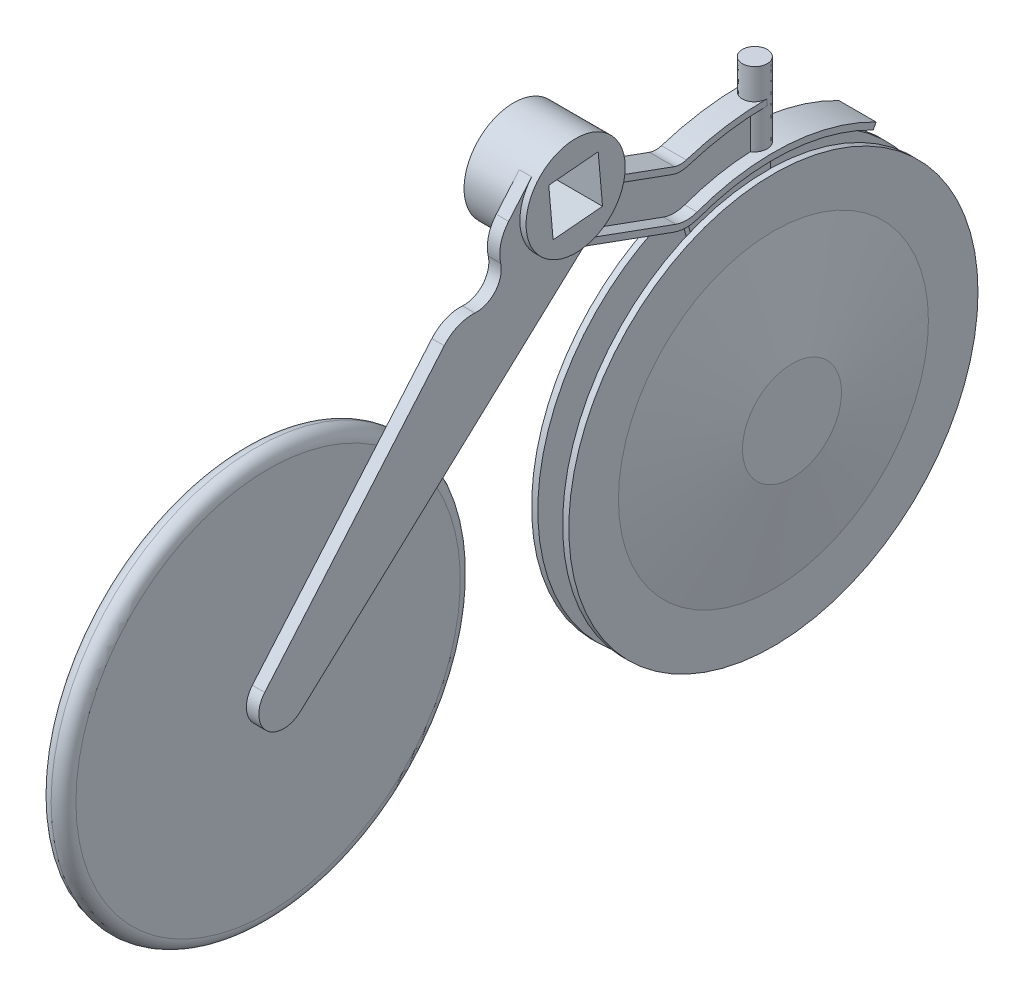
ISO-10303-21;
HEADER;
FILE_DESCRIPTION(('STEP AP214'),'2;1');
FILE_NAME('part.step','',(''),(''),'','','');
FILE_SCHEMA(('AUTOMOTIVE_DESIGN { 1 0 10303 214 1 1 1 1 }'));
ENDSEC;
DATA;
#1=APPLICATION_CONTEXT('core data for automotive mechanical design processes');
#2=APPLICATION_PROTOCOL_DEFINITION('international standard','automotive_design',2000,#1);
#3=PRODUCT_CONTEXT('',#1,'mechanical');
#4=PRODUCT('Part','Part','',(#3));
#5=PRODUCT_RELATED_PRODUCT_CATEGORY('part','',(#4));
#6=PRODUCT_DEFINITION_FORMATION('','',#4);
#7=PRODUCT_DEFINITION_CONTEXT('part definition',#1,'design');
#8=PRODUCT_DEFINITION('design','',#6,#7);
#9=PRODUCT_DEFINITION_SHAPE('','',#8);
#10=(LENGTH_UNIT() NAMED_UNIT(*) SI_UNIT(.MILLI.,.METRE.));
#11=(NAMED_UNIT(*) PLANE_ANGLE_UNIT() SI_UNIT($,.RADIAN.));
#12=(NAMED_UNIT(*) SI_UNIT($,.STERADIAN.) SOLID_ANGLE_UNIT());
#13=UNCERTAINTY_MEASURE_WITH_UNIT(LENGTH_MEASURE(1.E-05),#10,'distance_accuracy_value','');
#14=(GEOMETRIC_REPRESENTATION_CONTEXT(3) GLOBAL_UNCERTAINTY_ASSIGNED_CONTEXT((#13)) GLOBAL_UNIT_ASSIGNED_CONTEXT((#10,
#11,#12)) REPRESENTATION_CONTEXT('',''));
#15=CARTESIAN_POINT('',(0.,0.,0.));
#16=DIRECTION('',(0.,0.,1.));
#17=DIRECTION('',(1.,0.,0.));
#18=AXIS2_PLACEMENT_3D('',#15,#16,#17);
#19=CARTESIAN_POINT('',(-12.5,-239.446208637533,230.516635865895));
#20=DIRECTION('',(-1.,0.,0.));
#21=DIRECTION('',(0.,0.,1.));
#22=AXIS2_PLACEMENT_3D('',#19,#20,#21);
#23=PLANE('',#22);
#24=CARTESIAN_POINT('',(-12.5,-239.446208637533,230.516635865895));
#25=DIRECTION('',(-1.,0.,0.));
#26=DIRECTION('',(0.,0.,1.));
#27=AXIS2_PLACEMENT_3D('',#24,#25,#26);
#28=CIRCLE('',#27,155.);
#29=CARTESIAN_POINT('',(-12.5,-239.446208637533,385.516635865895));
#30=VERTEX_POINT('',#29);
#31=EDGE_CURVE('E58',#30,#30,#28,.T.);
#32=ORIENTED_EDGE('',*,*,#31,.T.);
#33=EDGE_LOOP('',(#32));
#34=FACE_BOUND('',#33,.T.);
#35=ADVANCED_FACE('F50',(#34),#23,.T.);
#36=CARTESIAN_POINT('',(7.5,-239.446208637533,230.516635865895));
#37=DIRECTION('',(-1.,0.,0.));
#38=DIRECTION('',(0.,0.,1.));
#39=AXIS2_PLACEMENT_3D('',#36,#37,#38);
#40=PLANE('',#39);
#41=CARTESIAN_POINT('',(7.5,-239.446208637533,230.516635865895));
#42=DIRECTION('',(-1.,0.,0.));
#43=DIRECTION('',(0.,0.,1.));
#44=AXIS2_PLACEMENT_3D('',#41,#42,#43);
#45=CIRCLE('',#44,155.);
#46=CARTESIAN_POINT('',(7.5,-239.446208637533,385.516635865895));
#47=VERTEX_POINT('',#46);
#48=EDGE_CURVE('E11',#47,#47,#45,.F.);
#49=ORIENTED_EDGE('',*,*,#48,.T.);
#50=EDGE_LOOP('',(#49));
#51=FACE_BOUND('',#50,.T.);
#52=ADVANCED_FACE('F72',(#51),#40,.F.);
#53=CARTESIAN_POINT('',(-2.5,-239.446208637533,230.516635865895));
#54=DIRECTION('',(-1.,0.,0.));
#55=DIRECTION('',(0.,0.,1.));
#56=AXIS2_PLACEMENT_3D('',#53,#54,#55);
#57=TOROIDAL_SURFACE('',#56,155.,10.);
#58=ORIENTED_EDGE('',*,*,#48,.F.);
#59=EDGE_LOOP('',(#58));
#60=FACE_BOUND('',#59,.T.);
#61=CARTESIAN_POINT('',(-2.5,-239.446208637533,230.516635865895));
#62=DIRECTION('',(-1.,0.,0.));
#63=DIRECTION('',(0.,0.,1.));
#64=AXIS2_PLACEMENT_3D('',#61,#62,#63);
#65=CIRCLE('',#64,165.);
#66=CARTESIAN_POINT('',(-2.5,-239.446208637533,395.516635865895));
#67=VERTEX_POINT('',#66);
#68=EDGE_CURVE('E54',#67,#67,#65,.T.);
#69=ORIENTED_EDGE('',*,*,#68,.F.);
#70=EDGE_LOOP('',(#69));
#71=FACE_BOUND('',#70,.T.);
#72=ADVANCED_FACE('F52',(#60,#71),#57,.T.);
#73=CARTESIAN_POINT('',(-2.5,-239.446208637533,230.516635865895));
#74=DIRECTION('',(-1.,0.,0.));
#75=DIRECTION('',(0.,0.,1.));
#76=AXIS2_PLACEMENT_3D('',#73,#74,#75);
#77=TOROIDAL_SURFACE('',#76,155.,10.);
#78=ORIENTED_EDGE('',*,*,#68,.T.);
#79=EDGE_LOOP('',(#78));
#80=FACE_BOUND('',#79,.T.);
#81=ORIENTED_EDGE('',*,*,#31,.F.);
#82=EDGE_LOOP('',(#81));
#83=FACE_BOUND('',#82,.T.);
#84=ADVANCED_FACE('F68',(#80,#83),#77,.T.);
#85=CLOSED_SHELL('',(#35,#52,#72,#84));
#86=MANIFOLD_SOLID_BREP('B2',#85);
#87=CARTESIAN_POINT('',(20.,-28.9717217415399,77.2842282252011));
#88=DIRECTION('',(0.,-0.64893990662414,-0.76083966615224));
#89=DIRECTION('',(0.,0.76083966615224,-0.64893990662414));
#90=AXIS2_PLACEMENT_3D('',#87,#88,#89);
#91=PLANE('',#90);
#92=DIRECTION('',(0.,-0.76083966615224,0.64893990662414));
#93=VECTOR('',#92,1.);
#94=CARTESIAN_POINT('',(10.,-28.9717217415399,77.2842282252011));
#95=LINE('',#94,#93);
#96=CARTESIAN_POINT('',(10.,25.9575962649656,30.4335866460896));
#97=VERTEX_POINT('',#96);
#98=CARTESIAN_POINT('',(10.,4.13997334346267,49.0424037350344));
#99=VERTEX_POINT('',#98);
#100=EDGE_CURVE('E427',#97,#99,#95,.T.);
#101=ORIENTED_EDGE('',*,*,#100,.T.);
#102=DIRECTION('',(1.,0.,0.));
#103=VECTOR('',#102,1.);
#104=CARTESIAN_POINT('',(20.,4.13997334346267,49.0424037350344));
#105=LINE('',#104,#103);
#106=CARTESIAN_POINT('',(20.,4.13997334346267,49.0424037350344));
#107=VERTEX_POINT('',#106);
#108=EDGE_CURVE('E48',#99,#107,#105,.T.);
#109=ORIENTED_EDGE('',*,*,#108,.T.);
#110=DIRECTION('',(0.,-0.76083966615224,0.64893990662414));
#111=VECTOR('',#110,1.);
#112=CARTESIAN_POINT('',(20.,-28.9717217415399,77.2842282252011));
#113=LINE('',#112,#111);
#114=CARTESIAN_POINT('',(20.,25.9575962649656,30.4335866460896));
#115=VERTEX_POINT('',#114);
#116=EDGE_CURVE('E394',#115,#107,#113,.T.);
#117=ORIENTED_EDGE('',*,*,#116,.F.);
#118=DIRECTION('',(-1.,0.,0.));
#119=VECTOR('',#118,1.);
#120=CARTESIAN_POINT('',(20.,25.9575962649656,30.4335866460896));
#121=LINE('',#120,#119);
#122=EDGE_CURVE('E404',#115,#97,#121,.T.);
#123=ORIENTED_EDGE('',*,*,#122,.T.);
#124=EDGE_LOOP('',(#101,#109,#117,#123));
#125=FACE_BOUND('',#124,.T.);
#126=ADVANCED_FACE('F113',(#125),#91,.F.);
#127=CARTESIAN_POINT('',(15.,-239.446208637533,-169.483364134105));
#128=DIRECTION('',(-1.,0.,0.));
#129=DIRECTION('',(0.,0.,1.));
#130=AXIS2_PLACEMENT_3D('',#127,#128,#129);
#131=CYLINDRICAL_SURFACE('',#130,7.50000000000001);
#132=CARTESIAN_POINT('',(2.5,-239.446208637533,-169.483364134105));
#133=DIRECTION('',(1.,0.,0.));
#134=DIRECTION('',(0.,0.,-1.));
#135=AXIS2_PLACEMENT_3D('',#132,#133,#134);
#136=CIRCLE('',#135,7.50000000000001);
#137=CARTESIAN_POINT('',(2.5,-239.446208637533,-176.983364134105));
#138=VERTEX_POINT('',#137);
#139=EDGE_CURVE('E1420',#138,#138,#136,.T.);
#140=ORIENTED_EDGE('',*,*,#139,.T.);
#141=EDGE_LOOP('',(#140));
#142=FACE_BOUND('',#141,.T.);
#143=CARTESIAN_POINT('',(10.,-239.446208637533,-169.483364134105));
#144=DIRECTION('',(1.,0.,0.));
#145=DIRECTION('',(0.,0.,-1.));
#146=AXIS2_PLACEMENT_3D('',#143,#144,#145);
#147=CIRCLE('',#146,7.50000000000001);
#148=CARTESIAN_POINT('',(10.,-239.446208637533,-176.983364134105));
#149=VERTEX_POINT('',#148);
#150=EDGE_CURVE('E662',#149,#149,#147,.T.);
#151=ORIENTED_EDGE('',*,*,#150,.F.);
#152=EDGE_LOOP('',(#151));
#153=FACE_BOUND('',#152,.T.);
#154=ADVANCED_FACE('F558',(#142,#153),#131,.T.);
#155=CARTESIAN_POINT('',(15.,-32.8892417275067,11.9707050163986));
#156=DIRECTION('',(0.,0.939692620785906,-0.342020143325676));
#157=DIRECTION('',(0.,0.342020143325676,0.939692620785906));
#158=AXIS2_PLACEMENT_3D('',#155,#156,#157);
#159=PLANE('',#158);
#160=DIRECTION('',(0.,0.342020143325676,0.939692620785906));
#161=VECTOR('',#160,1.);
#162=CARTESIAN_POINT('',(10.,-32.8892417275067,11.9707050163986));
#163=LINE('',#162,#161);
#164=CARTESIAN_POINT('',(10.,-42.0986073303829,-13.3318190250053));
#165=VERTEX_POINT('',#164);
#166=CARTESIAN_POINT('',(10.,-39.5124333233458,-6.22636433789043));
#167=VERTEX_POINT('',#166);
#168=EDGE_CURVE('E444',#165,#167,#163,.T.);
#169=ORIENTED_EDGE('',*,*,#168,.F.);
#170=DIRECTION('',(1.,0.,0.));
#171=VECTOR('',#170,1.);
#172=CARTESIAN_POINT('',(15.,-42.0986073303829,-13.3318190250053));
#173=LINE('',#172,#171);
#174=CARTESIAN_POINT('',(15.,-42.0986073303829,-13.3318190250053));
#175=VERTEX_POINT('',#174);
#176=EDGE_CURVE('E441',#165,#175,#173,.T.);
#177=ORIENTED_EDGE('',*,*,#176,.T.);
#178=DIRECTION('',(0.,-0.342020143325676,-0.939692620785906));
#179=VECTOR('',#178,1.);
#180=CARTESIAN_POINT('',(15.,-32.8892417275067,11.9707050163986));
#181=LINE('',#180,#179);
#182=CARTESIAN_POINT('',(15.,-70.3015368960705,-90.818731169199));
#183=VERTEX_POINT('',#182);
#184=EDGE_CURVE('E1386',#175,#183,#181,.T.);
#185=ORIENTED_EDGE('',*,*,#184,.T.);
#186=DIRECTION('',(-1.,0.,0.));
#187=VECTOR('',#186,1.);
#188=CARTESIAN_POINT('',(15.,-70.3015368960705,-90.818731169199));
#189=LINE('',#188,#187);
#190=CARTESIAN_POINT('',(5.,-70.3015368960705,-90.818731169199));
#191=VERTEX_POINT('',#190);
#192=EDGE_CURVE('E1348',#183,#191,#189,.T.);
#193=ORIENTED_EDGE('',*,*,#192,.T.);
#194=DIRECTION('',(0.,-0.342020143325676,-0.939692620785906));
#195=VECTOR('',#194,1.);
#196=CARTESIAN_POINT('',(5.,-39.5124333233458,-6.22636433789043));
#197=LINE('',#196,#195);
#198=CARTESIAN_POINT('',(5.,-39.5124333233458,-6.22636433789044));
#199=VERTEX_POINT('',#198);
#200=EDGE_CURVE('E1297',#199,#191,#197,.T.);
#201=ORIENTED_EDGE('',*,*,#200,.F.);
#202=DIRECTION('',(-1.,0.,0.));
#203=VECTOR('',#202,1.);
#204=CARTESIAN_POINT('',(25.,-39.5124333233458,-6.22636433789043));
#205=LINE('',#204,#203);
#206=EDGE_CURVE('E758',#167,#199,#205,.T.);
#207=ORIENTED_EDGE('',*,*,#206,.F.);
#208=EDGE_LOOP('',(#169,#177,#185,#193,#201,#207));
#209=FACE_BOUND('',#208,.T.);
#210=ADVANCED_FACE('F564',(#209),#159,.T.);
#211=CARTESIAN_POINT('',(15.,-37.5877048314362,13.680805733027));
#212=DIRECTION('',(0.,0.939692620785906,-0.342020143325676));
#213=DIRECTION('',(0.,0.342020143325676,0.939692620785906));
#214=AXIS2_PLACEMENT_3D('',#211,#212,#213);
#215=PLANE('',#214);
#216=DIRECTION('',(1.,0.,0.));
#217=VECTOR('',#216,1.);
#218=CARTESIAN_POINT('',(15.,-45.9121059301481,-9.19029831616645));
#219=LINE('',#218,#217);
#220=CARTESIAN_POINT('',(10.,-45.9121059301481,-9.19029831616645));
#221=VERTEX_POINT('',#220);
#222=CARTESIAN_POINT('',(15.,-45.9121059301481,-9.19029831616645));
#223=VERTEX_POINT('',#222);
#224=EDGE_CURVE('E434',#221,#223,#219,.T.);
#225=ORIENTED_EDGE('',*,*,#224,.F.);
#226=DIRECTION('',(0.,0.342020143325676,0.939692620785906));
#227=VECTOR('',#226,1.);
#228=CARTESIAN_POINT('',(10.,-37.5877048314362,13.680805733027));
#229=LINE('',#228,#227);
#230=CARTESIAN_POINT('',(10.,-37.5877048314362,13.680805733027));
#231=VERTEX_POINT('',#230);
#232=EDGE_CURVE('E665',#221,#231,#229,.T.);
#233=ORIENTED_EDGE('',*,*,#232,.T.);
#234=DIRECTION('',(-1.,0.,0.));
#235=VECTOR('',#234,1.);
#236=CARTESIAN_POINT('',(15.,-37.5877048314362,13.680805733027));
#237=LINE('',#236,#235);
#238=CARTESIAN_POINT('',(-15.,-37.5877048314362,13.680805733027));
#239=VERTEX_POINT('',#238);
#240=EDGE_CURVE('E1351',#231,#239,#237,.T.);
#241=ORIENTED_EDGE('',*,*,#240,.T.);
#242=DIRECTION('',(0.,-0.342020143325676,-0.939692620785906));
#243=VECTOR('',#242,1.);
#244=CARTESIAN_POINT('',(-15.,-37.5877048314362,13.680805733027));
#245=LINE('',#244,#243);
#246=CARTESIAN_POINT('',(-15.,-75.,-89.1086304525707));
#247=VERTEX_POINT('',#246);
#248=EDGE_CURVE('E1364',#239,#247,#245,.T.);
#249=ORIENTED_EDGE('',*,*,#248,.T.);
#250=DIRECTION('',(-1.,0.,0.));
#251=VECTOR('',#250,1.);
#252=CARTESIAN_POINT('',(15.,-75.,-89.1086304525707));
#253=LINE('',#252,#251);
#254=CARTESIAN_POINT('',(15.,-75.,-89.1086304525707));
#255=VERTEX_POINT('',#254);
#256=EDGE_CURVE('E1353',#255,#247,#253,.T.);
#257=ORIENTED_EDGE('',*,*,#256,.F.);
#258=DIRECTION('',(0.,-0.342020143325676,-0.939692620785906));
#259=VECTOR('',#258,1.);
#260=CARTESIAN_POINT('',(15.,-37.5877048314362,13.680805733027));
#261=LINE('',#260,#259);
#262=EDGE_CURVE('E1384',#223,#255,#261,.T.);
#263=ORIENTED_EDGE('',*,*,#262,.F.);
#264=EDGE_LOOP('',(#225,#233,#241,#249,#257,#263));
#265=FACE_BOUND('',#264,.T.);
#266=ADVANCED_FACE('F824',(#265),#215,.F.);
#267=CARTESIAN_POINT('',(15.,-239.446208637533,-169.483364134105));
#268=DIRECTION('',(-1.,0.,0.));
#269=DIRECTION('',(0.,0.,1.));
#270=AXIS2_PLACEMENT_3D('',#267,#268,#269);
#271=PLANE('',#270);
#272=DIRECTION('',(0.,0.677373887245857,-0.735638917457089));
#273=VECTOR('',#272,1.);
#274=CARTESIAN_POINT('',(15.,-54.8379497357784,0.503311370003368));
#275=LINE('',#274,#273);
#276=EDGE_CURVE('E667',#223,#175,#275,.T.);
#277=ORIENTED_EDGE('',*,*,#276,.F.);
#278=ORIENTED_EDGE('',*,*,#262,.T.);
#279=CARTESIAN_POINT('',(15.,-46.8092213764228,-99.3692347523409));
#280=DIRECTION('',(1.,0.,0.));
#281=DIRECTION('',(0.,0.,-1.));
#282=AXIS2_PLACEMENT_3D('',#279,#280,#281);
#283=CIRCLE('',#282,30.);
#284=CARTESIAN_POINT('',(15.,-75.,-109.629839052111));
#285=VERTEX_POINT('',#284);
#286=EDGE_CURVE('E1382',#255,#285,#283,.T.);
#287=ORIENTED_EDGE('',*,*,#286,.T.);
#288=CARTESIAN_POINT('',(15.,-239.446208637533,-169.483364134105));
#289=DIRECTION('',(-1.,0.,0.));
#290=DIRECTION('',(0.,0.,1.));
#291=AXIS2_PLACEMENT_3D('',#288,#289,#290);
#292=CIRCLE('',#291,175.);
#293=CARTESIAN_POINT('',(15.,-84.0690180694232,-250.));
#294=VERTEX_POINT('',#293);
#295=EDGE_CURVE('E1363',#285,#294,#292,.T.);
#296=ORIENTED_EDGE('',*,*,#295,.T.);
#297=DIRECTION('',(0.,-0.887869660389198,0.460095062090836));
#298=VECTOR('',#297,1.);
#299=CARTESIAN_POINT('',(15.,-79.6296697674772,-252.300475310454));
#300=LINE('',#299,#298);
#301=CARTESIAN_POINT('',(15.,-79.6296697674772,-252.300475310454));
#302=VERTEX_POINT('',#301);
#303=EDGE_CURVE('E1394',#302,#294,#300,.T.);
#304=ORIENTED_EDGE('',*,*,#303,.F.);
#305=CARTESIAN_POINT('',(15.,-239.446208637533,-169.483364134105));
#306=DIRECTION('',(1.,0.,0.));
#307=DIRECTION('',(0.,0.,-1.));
#308=AXIS2_PLACEMENT_3D('',#305,#306,#307);
#309=CIRCLE('',#308,180.);
#310=CARTESIAN_POINT('',(15.,-70.3015368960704,-107.919738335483));
#311=VERTEX_POINT('',#310);
#312=EDGE_CURVE('E1391',#311,#302,#309,.F.);
#313=ORIENTED_EDGE('',*,*,#312,.F.);
#314=CARTESIAN_POINT('',(15.,-46.8092213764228,-99.3692347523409));
#315=DIRECTION('',(1.,0.,0.));
#316=DIRECTION('',(0.,0.,-1.));
#317=AXIS2_PLACEMENT_3D('',#314,#315,#316);
#318=CIRCLE('',#317,25.);
#319=EDGE_CURVE('E1388',#183,#311,#318,.T.);
#320=ORIENTED_EDGE('',*,*,#319,.F.);
#321=ORIENTED_EDGE('',*,*,#184,.F.);
#322=EDGE_LOOP('',(#277,#278,#287,#296,#304,#313,#320,#321));
#323=FACE_BOUND('',#322,.T.);
#324=ADVANCED_FACE('F820',(#323),#271,.F.);
#325=CARTESIAN_POINT('',(15.,-239.446208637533,-169.483364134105));
#326=DIRECTION('',(-1.,0.,0.));
#327=DIRECTION('',(0.,0.,1.));
#328=AXIS2_PLACEMENT_3D('',#325,#326,#327);
#329=CYLINDRICAL_SURFACE('',#328,180.);
#330=CARTESIAN_POINT('',(-5.,-239.446208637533,-169.483364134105));
#331=DIRECTION('',(-1.,0.,0.));
#332=DIRECTION('',(0.,0.,-1.));
#333=AXIS2_PLACEMENT_3D('',#330,#331,#332);
#334=CIRCLE('',#333,180.);
#335=CARTESIAN_POINT('',(-5.,-70.3015368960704,-107.919738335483));
#336=VERTEX_POINT('',#335);
#337=CARTESIAN_POINT('',(-5.00000036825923,-59.6539274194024,-160.830572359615));
#338=VERTEX_POINT('',#337);
#339=EDGE_CURVE('E748',#336,#338,#334,.T.);
#340=ORIENTED_EDGE('',*,*,#339,.T.);
#341=CARTESIAN_POINT('',(5.00000040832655,-59.6546309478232,-160.82376877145));
#342=CARTESIAN_POINT('',(5.24400408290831,-59.6478393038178,-160.964805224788));
#343=CARTESIAN_POINT('',(5.48205826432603,-59.640717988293,-161.116083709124));
#344=CARTESIAN_POINT('',(5.9446562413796,-59.6260231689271,-161.438055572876));
#345=CARTESIAN_POINT('',(6.16919934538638,-59.6184496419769,-161.608749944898));
#346=CARTESIAN_POINT('',(6.60300323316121,-59.6030630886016,-161.968357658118));
#347=CARTESIAN_POINT('',(6.81227345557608,-59.5952502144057,-162.157259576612));
#348=CARTESIAN_POINT('',(7.11341122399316,-59.5835096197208,-162.453480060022));
#349=CARTESIAN_POINT('',(7.21166925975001,-59.5795922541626,-162.554372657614));
#350=CARTESIAN_POINT('',(7.40376547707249,-59.5717780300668,-162.76028214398));
#351=CARTESIAN_POINT('',(7.49760362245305,-59.5678811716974,-162.865299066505));
#352=CARTESIAN_POINT('',(7.77236743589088,-59.5562659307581,-163.186198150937));
#353=CARTESIAN_POINT('',(7.94654246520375,-59.5486228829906,-163.407928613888));
#354=CARTESIAN_POINT('',(8.27580431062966,-59.5337639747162,-163.865125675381));
#355=CARTESIAN_POINT('',(8.43088894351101,-59.5265481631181,-164.100593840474));
#356=CARTESIAN_POINT('',(8.72087739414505,-59.5127449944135,-164.583670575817));
#357=CARTESIAN_POINT('',(8.85578461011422,-59.5061575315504,-164.831277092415));
#358=CARTESIAN_POINT('',(9.04202034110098,-59.496885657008,-165.210522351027));
#359=CARTESIAN_POINT('',(9.10141346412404,-59.493896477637,-165.338248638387));
#360=CARTESIAN_POINT('',(9.21463910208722,-59.4881407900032,-165.596147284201));
#361=CARTESIAN_POINT('',(9.26847167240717,-59.4853742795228,-165.726319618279));
#362=CARTESIAN_POINT('',(9.42142872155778,-59.4774432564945,-166.119991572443));
#363=CARTESIAN_POINT('',(9.5121042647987,-59.4726426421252,-166.386832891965));
#364=CARTESIAN_POINT('',(9.67077662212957,-59.4641565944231,-166.927193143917));
#365=CARTESIAN_POINT('',(9.73876949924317,-59.4604713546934,-167.200713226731));
#366=CARTESIAN_POINT('',(9.85177747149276,-59.4543191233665,-167.752512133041));
#367=CARTESIAN_POINT('',(9.89678939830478,-59.4518522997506,-168.030791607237));
#368=CARTESIAN_POINT('',(9.96336271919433,-59.4482076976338,-168.590152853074));
#369=CARTESIAN_POINT('',(9.98492778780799,-59.4470297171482,-168.871234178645));
#370=CARTESIAN_POINT('',(9.9991590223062,-59.4462535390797,-169.293507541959));
#371=CARTESIAN_POINT('',(10.0008798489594,-59.4461601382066,-169.434441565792));
#372=CARTESIAN_POINT('',(9.99825909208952,-59.4463041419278,-169.716253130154));
#373=CARTESIAN_POINT('',(9.99391745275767,-59.4465415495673,-169.857130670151));
#374=CARTESIAN_POINT('',(9.97192542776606,-59.4477486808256,-170.279311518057));
#375=CARTESIAN_POINT('',(9.94530906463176,-59.4492132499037,-170.560197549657));
#376=CARTESIAN_POINT('',(9.86861788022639,-59.4534203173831,-171.118656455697));
#377=CARTESIAN_POINT('',(9.81854540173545,-59.4561626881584,-171.396229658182));
#378=CARTESIAN_POINT('',(9.69532911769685,-59.4628486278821,-171.946227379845));
#379=CARTESIAN_POINT('',(9.62218674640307,-59.4667921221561,-172.218652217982));
#380=CARTESIAN_POINT('',(9.495638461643,-59.473513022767,-172.621327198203));
#381=CARTESIAN_POINT('',(9.45074874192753,-59.4758824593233,-172.754317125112));
#382=CARTESIAN_POINT('',(9.35536464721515,-59.4808736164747,-173.018276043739));
#383=CARTESIAN_POINT('',(9.304870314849,-59.4834953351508,-173.14924505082));
#384=CARTESIAN_POINT('',(9.19837388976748,-59.4889723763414,-173.408919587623));
#385=CARTESIAN_POINT('',(9.14237174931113,-59.4918277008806,-173.537625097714));
#386=CARTESIAN_POINT('',(9.02503355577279,-59.4977520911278,-173.792569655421));
#387=CARTESIAN_POINT('',(8.96369737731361,-59.5008211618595,-173.918808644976));
#388=CARTESIAN_POINT('',(8.7718010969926,-59.5103164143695,-174.293462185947));
#389=CARTESIAN_POINT('',(8.63332710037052,-59.5170319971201,-174.537877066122));
#390=CARTESIAN_POINT('',(8.33630544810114,-59.5310410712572,-175.014121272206));
#391=CARTESIAN_POINT('',(8.17775806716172,-59.5383345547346,-175.245950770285));
#392=CARTESIAN_POINT('',(7.84183495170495,-59.5532873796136,-175.695236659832));
#393=CARTESIAN_POINT('',(7.6644751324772,-59.5609464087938,-175.912704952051));
#394=CARTESIAN_POINT('',(7.29213880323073,-59.5764213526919,-176.331988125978));
#395=CARTESIAN_POINT('',(7.09716207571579,-59.5842372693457,-176.53380281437));
#396=CARTESIAN_POINT('',(6.69101248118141,-59.5998086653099,-176.920423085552));
#397=CARTESIAN_POINT('',(6.47983960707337,-59.6075641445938,-177.105228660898));
#398=CARTESIAN_POINT('',(6.04268005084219,-59.6227914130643,-177.456414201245));
#399=CARTESIAN_POINT('',(5.81669357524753,-59.6302632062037,-177.622794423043));
#400=CARTESIAN_POINT('',(5.35068015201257,-59.6447358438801,-177.936477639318));
#401=CARTESIAN_POINT('',(5.11060644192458,-59.6517349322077,-178.083711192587));
#402=CARTESIAN_POINT('',(4.61882986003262,-59.6650345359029,-178.357384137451));
#403=CARTESIAN_POINT('',(4.36712695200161,-59.6713350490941,-178.483823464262));
#404=CARTESIAN_POINT('',(3.98233575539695,-59.6801320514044,-178.657297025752));
#405=CARTESIAN_POINT('',(3.85284919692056,-59.6829557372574,-178.712429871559));
#406=CARTESIAN_POINT('',(3.5916421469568,-59.6883618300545,-178.817133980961));
#407=CARTESIAN_POINT('',(3.45992167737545,-59.6909442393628,-178.866705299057));
#408=CARTESIAN_POINT('',(3.06178690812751,-59.6983027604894,-179.006974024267));
#409=CARTESIAN_POINT('',(2.79234609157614,-59.7026913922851,-179.089250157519));
#410=CARTESIAN_POINT('',(2.24824298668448,-59.710308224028,-179.230727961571));
#411=CARTESIAN_POINT('',(1.97359605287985,-59.7135394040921,-179.289988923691));
#412=CARTESIAN_POINT('',(1.42030374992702,-59.7187686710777,-179.385364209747));
#413=CARTESIAN_POINT('',(1.14165843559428,-59.7207667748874,-179.421478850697));
#414=CARTESIAN_POINT('',(0.582263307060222,-59.7234665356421,-179.470184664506));
#415=CARTESIAN_POINT('',(0.301513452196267,-59.7241681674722,-179.482775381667));
#416=CARTESIAN_POINT('',(-0.119577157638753,-59.7242157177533,-179.483625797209));
#417=CARTESIAN_POINT('',(-0.259948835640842,-59.724064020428,-179.480902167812));
#418=CARTESIAN_POINT('',(-0.540447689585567,-59.72342841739,-179.4694696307));
#419=CARTESIAN_POINT('',(-0.680574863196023,-59.7229445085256,-179.460760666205));
#420=CARTESIAN_POINT('',(-1.09963575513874,-59.7210084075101,-179.425848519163));
#421=CARTESIAN_POINT('',(-1.37788456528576,-59.7190718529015,-179.390860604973));
#422=CARTESIAN_POINT('',(-1.93048720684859,-59.7139746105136,-179.297955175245));
#423=CARTESIAN_POINT('',(-2.20484072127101,-59.7108138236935,-179.240035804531));
#424=CARTESIAN_POINT('',(-2.74784533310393,-59.7033522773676,-179.101597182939));
#425=CARTESIAN_POINT('',(-3.01649604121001,-59.6990514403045,-179.021076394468));
#426=CARTESIAN_POINT('',(-3.41356889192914,-59.6918245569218,-178.883549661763));
#427=CARTESIAN_POINT('',(-3.54494888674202,-59.6892861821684,-178.834913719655));
#428=CARTESIAN_POINT('',(-3.80549483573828,-59.6839642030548,-178.732046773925));
#429=CARTESIAN_POINT('',(-3.93466080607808,-59.681180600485,-178.677815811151));
#430=CARTESIAN_POINT('',(-4.31938290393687,-59.6724737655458,-178.50652147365));
#431=CARTESIAN_POINT('',(-4.57128888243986,-59.6662106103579,-178.381159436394));
#432=CARTESIAN_POINT('',(-5.06372283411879,-59.6529865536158,-178.109819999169));
#433=CARTESIAN_POINT('',(-5.30424886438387,-59.6460255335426,-177.963839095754));
#434=CARTESIAN_POINT('',(-5.77234168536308,-59.6316071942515,-177.652415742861));
#435=CARTESIAN_POINT('',(-5.99990831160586,-59.6241498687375,-177.486973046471));
#436=CARTESIAN_POINT('',(-6.44041167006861,-59.6089419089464,-177.137647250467));
#437=CARTESIAN_POINT('',(-6.65335069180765,-59.6011913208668,-176.953767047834));
#438=CARTESIAN_POINT('',(-6.96071467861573,-59.5894841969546,-176.664452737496));
#439=CARTESIAN_POINT('',(-7.06135437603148,-59.5855602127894,-176.565550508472));
#440=CARTESIAN_POINT('',(-7.25828659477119,-59.5777182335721,-176.363508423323));
#441=CARTESIAN_POINT('',(-7.35457907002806,-59.5738002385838,-176.260368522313));
#442=CARTESIAN_POINT('',(-7.63676622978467,-59.5621005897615,-175.944936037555));
#443=CARTESIAN_POINT('',(-7.81599401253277,-59.554372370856,-175.726608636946));
#444=CARTESIAN_POINT('',(-8.15546099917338,-59.539289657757,-175.275721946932));
#445=CARTESIAN_POINT('',(-8.31570077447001,-59.5319351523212,-175.043163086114));
#446=CARTESIAN_POINT('',(-8.61614559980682,-59.5178060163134,-174.5653908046));
#447=CARTESIAN_POINT('',(-8.7563520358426,-59.5110313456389,-174.320178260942));
#448=CARTESIAN_POINT('',(-8.95051617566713,-59.501458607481,-173.944595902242));
#449=CARTESIAN_POINT('',(-9.0124652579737,-59.4983701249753,-173.818304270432));
#450=CARTESIAN_POINT('',(-9.13092773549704,-59.4924054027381,-173.563188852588));
#451=CARTESIAN_POINT('',(-9.18744138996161,-59.4895291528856,-173.434365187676));
#452=CARTESIAN_POINT('',(-9.29494765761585,-59.484010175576,-173.174437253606));
#453=CARTESIAN_POINT('',(-9.34594051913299,-59.4813674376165,-173.043333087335));
#454=CARTESIAN_POINT('',(-9.44237617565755,-59.4763340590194,-172.779077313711));
#455=CARTESIAN_POINT('',(-9.48781796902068,-59.4739434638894,-172.645925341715));
#456=CARTESIAN_POINT('',(-9.61561377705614,-59.4671783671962,-172.243872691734));
#457=CARTESIAN_POINT('',(-9.68950339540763,-59.4632071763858,-171.972217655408));
#458=CARTESIAN_POINT('',(-9.81412296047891,-59.4564560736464,-171.423546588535));
#459=CARTESIAN_POINT('',(-9.8648429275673,-59.4536766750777,-171.146528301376));
#460=CARTESIAN_POINT('',(-9.94226707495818,-59.4494149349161,-170.592458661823));
#461=CARTESIAN_POINT('',(-9.96924652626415,-59.4479177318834,-170.315445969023));
#462=CARTESIAN_POINT('',(-10.0000348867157,-59.446207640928,-169.760258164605));
#463=CARTESIAN_POINT('',(-10.0038539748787,-59.445994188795,-169.482083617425));
#464=CARTESIAN_POINT('',(-9.98838689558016,-59.4468560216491,-168.926331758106));
#465=CARTESIAN_POINT('',(-9.96909684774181,-59.447931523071,-168.648754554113));
#466=CARTESIAN_POINT('',(-9.907423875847,-59.4513418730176,-168.096181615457));
#467=CARTESIAN_POINT('',(-9.86504096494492,-59.453676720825,-167.821185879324));
#468=CARTESIAN_POINT('',(-9.75682931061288,-59.4595753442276,-167.272478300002));
#469=CARTESIAN_POINT('',(-9.69072858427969,-59.4631533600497,-166.998820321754));
#470=CARTESIAN_POINT('',(-9.53564958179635,-59.4714310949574,-166.458044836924));
#471=CARTESIAN_POINT('',(-9.44667099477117,-59.4761308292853,-166.190927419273));
#472=CARTESIAN_POINT('',(-9.29664818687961,-59.483920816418,-165.796591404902));
#473=CARTESIAN_POINT('',(-9.24386458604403,-59.4866417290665,-165.666167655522));
#474=CARTESIAN_POINT('',(-9.1327983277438,-59.4923101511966,-165.407688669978));
#475=CARTESIAN_POINT('',(-9.07451571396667,-59.4952576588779,-165.279633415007));
#476=CARTESIAN_POINT('',(-8.89162160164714,-59.5044092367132,-164.899362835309));
#477=CARTESIAN_POINT('',(-8.75893984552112,-59.5109236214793,-164.650979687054));
#478=CARTESIAN_POINT('',(-8.47321358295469,-59.5245957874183,-164.166213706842));
#479=CARTESIAN_POINT('',(-8.32016409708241,-59.5317537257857,-163.929833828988));
#480=CARTESIAN_POINT('',(-7.9947610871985,-59.5465137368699,-163.470667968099));
#481=CARTESIAN_POINT('',(-7.82240545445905,-59.5541158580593,-163.247883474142));
#482=CARTESIAN_POINT('',(-7.55038098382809,-59.5656811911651,-162.925358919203));
#483=CARTESIAN_POINT('',(-7.45749153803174,-59.5695619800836,-162.819826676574));
#484=CARTESIAN_POINT('',(-7.2673333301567,-59.5773518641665,-162.612768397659));
#485=CARTESIAN_POINT('',(-7.17006452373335,-59.5812609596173,-162.511242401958));
#486=CARTESIAN_POINT('',(-6.97125601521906,-59.5890733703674,-162.312535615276));
#487=CARTESIAN_POINT('',(-6.86971786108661,-59.5929766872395,-162.215353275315));
#488=CARTESIAN_POINT('',(-6.66251740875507,-59.6007488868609,-162.02550698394));
#489=CARTESIAN_POINT('',(-6.55685546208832,-59.604617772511,-161.932842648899));
#490=CARTESIAN_POINT('',(-6.33621492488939,-59.6124900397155,-161.74755892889));
#491=CARTESIAN_POINT('',(-6.22103538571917,-59.6164903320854,-161.655178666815));
#492=CARTESIAN_POINT('',(-5.98668946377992,-59.6243944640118,-161.47566675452));
#493=CARTESIAN_POINT('',(-5.86752384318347,-59.6282983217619,-161.388534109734));
#494=CARTESIAN_POINT('',(-5.62563712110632,-59.6359759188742,-161.219748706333));
#495=CARTESIAN_POINT('',(-5.50292164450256,-59.6397498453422,-161.138087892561));
#496=CARTESIAN_POINT('',(-5.25401011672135,-59.6471469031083,-160.980209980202));
#497=CARTESIAN_POINT('',(-5.12781361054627,-59.650770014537,-160.903993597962));
#498=CARTESIAN_POINT('',(-5.00001572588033,-59.6543037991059,-160.830563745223));
#499=B_SPLINE_CURVE_WITH_KNOTS('',3,(#341,#342,#343,#344,#345,#346,#347,#348,#349,#350,#351,
#352,#353,#354,#355,#356,#357,#358,#359,#360,#361,#362,#363,#364,#365,#366,#367,#368,#369,#370,
#371,#372,#373,#374,#375,#376,#377,#378,#379,#380,#381,#382,#383,#384,#385,#386,#387,#388,#389,
#390,#391,#392,#393,#394,#395,#396,#397,#398,#399,#400,#401,#402,#403,#404,#405,#406,#407,#408,
#409,#410,#411,#412,#413,#414,#415,#416,#417,#418,#419,#420,#421,#422,#423,#424,#425,#426,#427,
#428,#429,#430,#431,#432,#433,#434,#435,#436,#437,#438,#439,#440,#441,#442,#443,#444,#445,#446,
#447,#448,#449,#450,#451,#452,#453,#454,#455,#456,#457,#458,#459,#460,#461,#462,#463,#464,#465,
#466,#467,#468,#469,#470,#471,#472,#473,#474,#475,#476,#477,#478,#479,#480,#481,#482,#483,#484,
#485,#486,#487,#488,#489,#490,#491,#492,#493,#494,#495,#496,#497,#498),.UNSPECIFIED.,.F.,.F.,(4,
2,2,2,2,2,2,2,2,2,2,2,2,2,2,2,2,2,2,2,2,2,2,2,2,2,2,2,2,2,2,2,2,2,2,2,2,2,2,2,2,2,2,2,2,2,2,2,2,
2,2,2,2,2,2,2,2,2,2,2,2,2,2,2,2,2,2,2,2,2,2,2,2,2,2,2,2,2,4),(0.,0.845458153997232,
1.69095955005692,2.535933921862,2.95848280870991,3.38103515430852,4.22613991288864,
5.07134123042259,5.91640004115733,6.33896339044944,6.76152253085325,7.60601860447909,
8.45066117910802,9.29542017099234,10.1400467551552,10.5627652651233,10.9854876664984,
11.8308292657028,12.6760864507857,13.521291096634,13.9423332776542,14.363372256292,
14.7844148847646,15.2054674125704,16.0473663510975,16.8892537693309,17.7304345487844,
18.5716257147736,19.4128172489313,20.2539970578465,21.0981472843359,21.9423001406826,
22.3644824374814,22.786660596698,23.6308425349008,24.4728350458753,25.3148160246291,
26.1568133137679,26.5778949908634,26.9989806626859,27.8392509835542,28.6795892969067,
29.5199847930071,29.9402234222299,30.3604589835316,31.2036970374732,32.0470785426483,
32.8904707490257,33.7337306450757,34.1570873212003,34.5804484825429,35.4270747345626,
36.2736755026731,37.1202176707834,37.5422169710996,37.9641961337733,38.3861563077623,
38.8081925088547,39.6517547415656,40.4956799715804,41.3296858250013,42.1633251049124,
42.9971043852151,43.8308831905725,44.6745460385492,45.5182203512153,45.9402903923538,
46.3623570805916,47.2062888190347,48.0504272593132,48.8946579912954,49.3164865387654,
49.7383193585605,50.1600005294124,50.5816458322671,51.0246082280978,51.4674864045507,
51.9096976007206,52.3519668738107),.UNSPECIFIED.);
#500=CARTESIAN_POINT('',(5.00000020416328,-59.6546309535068,-160.823768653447));
#501=VERTEX_POINT('',#500);
#502=EDGE_CURVE('E498',#501,#338,#499,.T.);
#503=ORIENTED_EDGE('',*,*,#502,.F.);
#504=CARTESIAN_POINT('',(5.,-239.446208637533,-169.483364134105));
#505=DIRECTION('',(-1.,0.,0.));
#506=DIRECTION('',(0.,0.,-1.));
#507=AXIS2_PLACEMENT_3D('',#504,#505,#506);
#508=CIRCLE('',#507,180.);
#509=CARTESIAN_POINT('',(5.,-70.3015368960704,-107.919738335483));
#510=VERTEX_POINT('',#509);
#511=EDGE_CURVE('E1431',#510,#501,#508,.T.);
#512=ORIENTED_EDGE('',*,*,#511,.F.);
#513=DIRECTION('',(-1.,0.,0.));
#514=VECTOR('',#513,1.);
#515=CARTESIAN_POINT('',(15.,-70.3015368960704,-107.919738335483));
#516=LINE('',#515,#514);
#517=EDGE_CURVE('E1344',#311,#510,#516,.T.);
#518=ORIENTED_EDGE('',*,*,#517,.F.);
#519=ORIENTED_EDGE('',*,*,#312,.T.);
#520=DIRECTION('',(-1.,0.,0.));
#521=VECTOR('',#520,1.);
#522=CARTESIAN_POINT('',(15.,-79.6296697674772,-252.300475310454));
#523=LINE('',#522,#521);
#524=CARTESIAN_POINT('',(-15.,-79.6296697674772,-252.300475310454));
#525=VERTEX_POINT('',#524);
#526=EDGE_CURVE('E1342',#302,#525,#523,.T.);
#527=ORIENTED_EDGE('',*,*,#526,.T.);
#528=CARTESIAN_POINT('',(-15.,-239.446208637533,-169.483364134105));
#529=DIRECTION('',(1.,0.,0.));
#530=DIRECTION('',(0.,0.,-1.));
#531=AXIS2_PLACEMENT_3D('',#528,#529,#530);
#532=CIRCLE('',#531,180.);
#533=CARTESIAN_POINT('',(-15.,-70.3015368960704,-107.919738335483));
#534=VERTEX_POINT('',#533);
#535=EDGE_CURVE('E1372',#534,#525,#532,.F.);
#536=ORIENTED_EDGE('',*,*,#535,.F.);
#537=EDGE_CURVE('E1347',#336,#534,#516,.T.);
#538=ORIENTED_EDGE('',*,*,#537,.F.);
#539=EDGE_LOOP('',(#340,#503,#512,#518,#519,#527,#536,#538));
#540=FACE_BOUND('',#539,.T.);
#541=ADVANCED_FACE('F823',(#540),#329,.T.);
#542=CARTESIAN_POINT('',(-5.,-39.5124333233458,-6.22636433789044));
#543=VERTEX_POINT('',#542);
#544=CARTESIAN_POINT('',(-15.,-39.5124333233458,-6.22636433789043));
#545=VERTEX_POINT('',#544);
#546=EDGE_CURVE('E1298',#543,#545,#205,.T.);
#547=ORIENTED_EDGE('',*,*,#546,.F.);
#548=DIRECTION('',(0.,-0.342020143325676,-0.939692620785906));
#549=VECTOR('',#548,1.);
#550=CARTESIAN_POINT('',(-5.,-39.5124333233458,-6.22636433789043));
#551=LINE('',#550,#549);
#552=CARTESIAN_POINT('',(-5.,-70.3015368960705,-90.818731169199));
#553=VERTEX_POINT('',#552);
#554=EDGE_CURVE('E738',#543,#553,#551,.T.);
#555=ORIENTED_EDGE('',*,*,#554,.T.);
#556=CARTESIAN_POINT('',(-15.,-70.3015368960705,-90.818731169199));
#557=VERTEX_POINT('',#556);
#558=EDGE_CURVE('E1350',#553,#557,#189,.T.);
#559=ORIENTED_EDGE('',*,*,#558,.T.);
#560=DIRECTION('',(0.,-0.342020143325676,-0.939692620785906));
#561=VECTOR('',#560,1.);
#562=CARTESIAN_POINT('',(-15.,-32.8892417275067,11.9707050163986));
#563=LINE('',#562,#561);
#564=EDGE_CURVE('E1366',#545,#557,#563,.T.);
#565=ORIENTED_EDGE('',*,*,#564,.F.);
#566=EDGE_LOOP('',(#547,#555,#559,#565));
#567=FACE_BOUND('',#566,.T.);
#568=ADVANCED_FACE('F840',(#567),#159,.T.);
#569=CARTESIAN_POINT('',(15.,-46.8092213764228,-99.3692347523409));
#570=DIRECTION('',(-1.,0.,0.));
#571=DIRECTION('',(0.,0.,1.));
#572=AXIS2_PLACEMENT_3D('',#569,#570,#571);
#573=CYLINDRICAL_SURFACE('',#572,25.);
#574=ORIENTED_EDGE('',*,*,#558,.F.);
#575=CARTESIAN_POINT('',(-5.,-46.8092213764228,-99.3692347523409));
#576=DIRECTION('',(1.,0.,0.));
#577=DIRECTION('',(0.,0.,-1.));
#578=AXIS2_PLACEMENT_3D('',#575,#576,#577);
#579=CIRCLE('',#578,24.9999999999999);
#580=EDGE_CURVE('E740',#553,#336,#579,.T.);
#581=ORIENTED_EDGE('',*,*,#580,.T.);
#582=ORIENTED_EDGE('',*,*,#537,.T.);
#583=CARTESIAN_POINT('',(-15.,-46.8092213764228,-99.3692347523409));
#584=DIRECTION('',(1.,0.,0.));
#585=DIRECTION('',(0.,0.,-1.));
#586=AXIS2_PLACEMENT_3D('',#583,#584,#585);
#587=CIRCLE('',#586,25.);
#588=EDGE_CURVE('E1369',#557,#534,#587,.T.);
#589=ORIENTED_EDGE('',*,*,#588,.F.);
#590=EDGE_LOOP('',(#574,#581,#582,#589));
#591=FACE_BOUND('',#590,.T.);
#592=ADVANCED_FACE('F844',(#591),#573,.F.);
#593=CARTESIAN_POINT('',(15.,-239.446208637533,-169.483364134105));
#594=DIRECTION('',(-1.,0.,0.));
#595=DIRECTION('',(0.,0.,1.));
#596=AXIS2_PLACEMENT_3D('',#593,#594,#595);
#597=CYLINDRICAL_SURFACE('',#596,175.);
#598=CARTESIAN_POINT('',(2.5,-239.446208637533,-169.483364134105));
#599=DIRECTION('',(1.,0.,0.));
#600=DIRECTION('',(0.,0.,1.));
#601=AXIS2_PLACEMENT_3D('',#598,#599,#600);
#602=CIRCLE('',#601,175.);
#603=CARTESIAN_POINT('',(2.5,-64.7321565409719,-179.483364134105));
#604=VERTEX_POINT('',#603);
#605=CARTESIAN_POINT('',(2.5,-75.,-109.629839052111));
#606=VERTEX_POINT('',#605);
#607=EDGE_CURVE('E1412',#604,#606,#602,.T.);
#608=ORIENTED_EDGE('',*,*,#607,.F.);
#609=DIRECTION('',(-1.,0.,0.));
#610=VECTOR('',#609,1.);
#611=CARTESIAN_POINT('',(2.5,-64.7321565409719,-179.483364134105));
#612=LINE('',#611,#610);
#613=CARTESIAN_POINT('',(-2.5,-64.7321565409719,-179.483364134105));
#614=VERTEX_POINT('',#613);
#615=EDGE_CURVE('E1406',#604,#614,#612,.T.);
#616=ORIENTED_EDGE('',*,*,#615,.T.);
#617=CARTESIAN_POINT('',(-2.5,-239.446208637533,-169.483364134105));
#618=DIRECTION('',(1.,0.,0.));
#619=DIRECTION('',(0.,0.,1.));
#620=AXIS2_PLACEMENT_3D('',#617,#618,#619);
#621=CIRCLE('',#620,175.);
#622=CARTESIAN_POINT('',(-2.5,-75.,-109.629839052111));
#623=VERTEX_POINT('',#622);
#624=EDGE_CURVE('E1417',#614,#623,#621,.T.);
#625=ORIENTED_EDGE('',*,*,#624,.T.);
#626=DIRECTION('',(-1.,0.,0.));
#627=VECTOR('',#626,1.);
#628=CARTESIAN_POINT('',(15.,-75.,-109.629839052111));
#629=LINE('',#628,#627);
#630=CARTESIAN_POINT('',(-15.,-75.,-109.629839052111));
#631=VERTEX_POINT('',#630);
#632=EDGE_CURVE('E1359',#623,#631,#629,.T.);
#633=ORIENTED_EDGE('',*,*,#632,.T.);
#634=CARTESIAN_POINT('',(-15.,-239.446208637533,-169.483364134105));
#635=DIRECTION('',(-1.,0.,0.));
#636=DIRECTION('',(0.,0.,1.));
#637=AXIS2_PLACEMENT_3D('',#634,#635,#636);
#638=CIRCLE('',#637,175.);
#639=CARTESIAN_POINT('',(-15.,-84.0690180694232,-250.));
#640=VERTEX_POINT('',#639);
#641=EDGE_CURVE('E1378',#631,#640,#638,.T.);
#642=ORIENTED_EDGE('',*,*,#641,.T.);
#643=DIRECTION('',(-1.,0.,0.));
#644=VECTOR('',#643,1.);
#645=CARTESIAN_POINT('',(15.,-84.0690180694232,-250.));
#646=LINE('',#645,#644);
#647=EDGE_CURVE('E1333',#294,#640,#646,.T.);
#648=ORIENTED_EDGE('',*,*,#647,.F.);
#649=ORIENTED_EDGE('',*,*,#295,.F.);
#650=EDGE_CURVE('E1356',#285,#606,#629,.T.);
#651=ORIENTED_EDGE('',*,*,#650,.T.);
#652=EDGE_LOOP('',(#608,#616,#625,#633,#642,#648,#649,#651));
#653=FACE_BOUND('',#652,.T.);
#654=ADVANCED_FACE('F853',(#653),#597,.F.);
#655=CARTESIAN_POINT('',(25.,0.,0.));
#656=DIRECTION('',(-1.,0.,0.));
#657=DIRECTION('',(0.,0.,1.));
#658=AXIS2_PLACEMENT_3D('',#655,#656,#657);
#659=CYLINDRICAL_SURFACE('',#658,40.);
#660=DIRECTION('',(-1.,0.,0.));
#661=VECTOR('',#660,1.);
#662=CARTESIAN_POINT('',(20.,-29.4255566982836,-27.0949554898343));
#663=LINE('',#662,#661);
#664=CARTESIAN_POINT('',(20.,-29.4255566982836,-27.0949554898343));
#665=VERTEX_POINT('',#664);
#666=CARTESIAN_POINT('',(10.,-29.4255566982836,-27.0949554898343));
#667=VERTEX_POINT('',#666);
#668=EDGE_CURVE('E435',#665,#667,#663,.T.);
#669=ORIENTED_EDGE('',*,*,#668,.T.);
#670=CARTESIAN_POINT('',(10.,0.,0.));
#671=DIRECTION('',(-1.,0.,0.));
#672=DIRECTION('',(0.,0.,1.));
#673=AXIS2_PLACEMENT_3D('',#670,#671,#672);
#674=CIRCLE('',#673,40.);
#675=EDGE_CURVE('E431',#667,#167,#674,.T.);
#676=ORIENTED_EDGE('',*,*,#675,.T.);
#677=ORIENTED_EDGE('',*,*,#206,.T.);
#678=CARTESIAN_POINT('',(5.,0.,0.));
#679=DIRECTION('',(-1.,0.,0.));
#680=DIRECTION('',(0.,0.,1.));
#681=AXIS2_PLACEMENT_3D('',#678,#679,#680);
#682=CIRCLE('',#681,40.);
#683=CARTESIAN_POINT('',(5.,-18.2719667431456,-35.5827940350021));
#684=VERTEX_POINT('',#683);
#685=EDGE_CURVE('E1478',#684,#199,#682,.T.);
#686=ORIENTED_EDGE('',*,*,#685,.F.);
#687=DIRECTION('',(-1.,0.,0.));
#688=VECTOR('',#687,1.);
#689=CARTESIAN_POINT('',(10.,-18.2719667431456,-35.5827940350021));
#690=LINE('',#689,#688);
#691=CARTESIAN_POINT('',(10.,-18.2719667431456,-35.5827940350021));
#692=VERTEX_POINT('',#691);
#693=EDGE_CURVE('E490',#692,#684,#690,.T.);
#694=ORIENTED_EDGE('',*,*,#693,.F.);
#695=CARTESIAN_POINT('',(10.,0.,0.));
#696=DIRECTION('',(-1.,0.,0.));
#697=DIRECTION('',(0.,0.,1.));
#698=AXIS2_PLACEMENT_3D('',#695,#696,#697);
#699=CIRCLE('',#698,40.);
#700=CARTESIAN_POINT('',(10.,-13.680805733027,-37.5877048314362));
#701=VERTEX_POINT('',#700);
#702=EDGE_CURVE('E495',#701,#692,#699,.T.);
#703=ORIENTED_EDGE('',*,*,#702,.F.);
#704=DIRECTION('',(-1.,0.,0.));
#705=VECTOR('',#704,1.);
#706=CARTESIAN_POINT('',(25.,-13.680805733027,-37.5877048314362));
#707=LINE('',#706,#705);
#708=CARTESIAN_POINT('',(-10.,-13.680805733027,-37.5877048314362));
#709=VERTEX_POINT('',#708);
#710=EDGE_CURVE('E517',#709,#701,#707,.F.);
#711=ORIENTED_EDGE('',*,*,#710,.F.);
#712=CARTESIAN_POINT('',(-10.,0.,0.));
#713=DIRECTION('',(-1.,0.,0.));
#714=DIRECTION('',(0.,0.,1.));
#715=AXIS2_PLACEMENT_3D('',#712,#713,#714);
#716=CIRCLE('',#715,40.);
#717=CARTESIAN_POINT('',(-10.,-18.2719667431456,-35.5827940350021));
#718=VERTEX_POINT('',#717);
#719=EDGE_CURVE('E493',#709,#718,#716,.T.);
#720=ORIENTED_EDGE('',*,*,#719,.T.);
#721=CARTESIAN_POINT('',(-5.,-18.2719667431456,-35.5827940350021));
#722=VERTEX_POINT('',#721);
#723=EDGE_CURVE('E489',#722,#718,#690,.T.);
#724=ORIENTED_EDGE('',*,*,#723,.F.);
#725=CARTESIAN_POINT('',(-5.,0.,0.));
#726=DIRECTION('',(-1.,0.,0.));
#727=DIRECTION('',(0.,0.,1.));
#728=AXIS2_PLACEMENT_3D('',#725,#726,#727);
#729=CIRCLE('',#728,40.);
#730=EDGE_CURVE('E731',#722,#543,#729,.T.);
#731=ORIENTED_EDGE('',*,*,#730,.T.);
#732=ORIENTED_EDGE('',*,*,#546,.T.);
#733=CARTESIAN_POINT('',(-15.,0.,0.));
#734=DIRECTION('',(-1.,0.,0.));
#735=DIRECTION('',(0.,0.,1.));
#736=AXIS2_PLACEMENT_3D('',#733,#734,#735);
#737=CIRCLE('',#736,40.);
#738=EDGE_CURVE('E1299',#545,#239,#737,.T.);
#739=ORIENTED_EDGE('',*,*,#738,.T.);
#740=ORIENTED_EDGE('',*,*,#240,.F.);
#741=EDGE_CURVE('E430',#231,#97,#674,.T.);
#742=ORIENTED_EDGE('',*,*,#741,.T.);
#743=ORIENTED_EDGE('',*,*,#122,.F.);
#744=CARTESIAN_POINT('',(20.,0.,0.));
#745=DIRECTION('',(-1.,0.,0.));
#746=DIRECTION('',(0.,0.,1.));
#747=AXIS2_PLACEMENT_3D('',#744,#745,#746);
#748=CIRCLE('',#747,40.);
#749=EDGE_CURVE('E420',#665,#115,#748,.T.);
#750=ORIENTED_EDGE('',*,*,#749,.F.);
#751=EDGE_LOOP('',(#669,#676,#677,#686,#694,#703,#711,#720,#724,#731,#732,#739,#740,#742,#743,#750));
#752=FACE_BOUND('',#751,.T.);
#753=CARTESIAN_POINT('',(-25.,0.,0.));
#754=DIRECTION('',(1.,0.,0.));
#755=DIRECTION('',(0.,0.,-1.));
#756=AXIS2_PLACEMENT_3D('',#753,#754,#755);
#757=CIRCLE('',#756,40.);
#758=CARTESIAN_POINT('',(-25.,0.,-40.));
#759=VERTEX_POINT('',#758);
#760=EDGE_CURVE('E1304',#759,#759,#757,.T.);
#761=ORIENTED_EDGE('',*,*,#760,.T.);
#762=EDGE_LOOP('',(#761));
#763=FACE_BOUND('',#762,.T.);
#764=CARTESIAN_POINT('',(25.,0.,0.));
#765=DIRECTION('',(1.,0.,0.));
#766=DIRECTION('',(0.,0.,-1.));
#767=AXIS2_PLACEMENT_3D('',#764,#765,#766);
#768=CIRCLE('',#767,40.);
#769=CARTESIAN_POINT('',(25.,0.,-40.));
#770=VERTEX_POINT('',#769);
#771=EDGE_CURVE('E1302',#770,#770,#768,.T.);
#772=ORIENTED_EDGE('',*,*,#771,.F.);
#773=EDGE_LOOP('',(#772));
#774=FACE_BOUND('',#773,.T.);
#775=ADVANCED_FACE('F720',(#752,#763,#774),#659,.T.);
#776=CARTESIAN_POINT('',(25.,0.,0.));
#777=DIRECTION('',(1.,0.,0.));
#778=DIRECTION('',(0.,0.,-1.));
#779=AXIS2_PLACEMENT_3D('',#776,#777,#778);
#780=PLANE('',#779);
#781=ORIENTED_EDGE('',*,*,#771,.T.);
#782=EDGE_LOOP('',(#781));
#783=FACE_BOUND('',#782,.T.);
#784=DIRECTION('',(0.,0.0871557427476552,-0.996194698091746));
#785=VECTOR('',#784,1.);
#786=CARTESIAN_POINT('',(25.,-21.667008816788,18.1807791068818));
#787=LINE('',#786,#785);
#788=CARTESIAN_POINT('',(25.,-21.667008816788,18.1807791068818));
#789=VERTEX_POINT('',#788);
#790=CARTESIAN_POINT('',(25.,-18.1807791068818,-21.667008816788));
#791=VERTEX_POINT('',#790);
#792=EDGE_CURVE('E1338',#789,#791,#787,.T.);
#793=ORIENTED_EDGE('',*,*,#792,.F.);
#794=DIRECTION('',(0.,-0.996194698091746,-0.0871557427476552));
#795=VECTOR('',#794,1.);
#796=CARTESIAN_POINT('',(25.,18.1807791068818,21.667008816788));
#797=LINE('',#796,#795);
#798=CARTESIAN_POINT('',(25.,18.1807791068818,21.667008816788));
#799=VERTEX_POINT('',#798);
#800=EDGE_CURVE('E1323',#799,#789,#797,.T.);
#801=ORIENTED_EDGE('',*,*,#800,.F.);
#802=DIRECTION('',(0.,-0.0871557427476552,0.996194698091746));
#803=VECTOR('',#802,1.);
#804=CARTESIAN_POINT('',(25.,18.1807791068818,21.667008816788));
#805=LINE('',#804,#803);
#806=CARTESIAN_POINT('',(25.,21.667008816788,-18.1807791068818));
#807=VERTEX_POINT('',#806);
#808=EDGE_CURVE('E1319',#807,#799,#805,.T.);
#809=ORIENTED_EDGE('',*,*,#808,.F.);
#810=DIRECTION('',(0.,0.996194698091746,0.0871557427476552));
#811=VECTOR('',#810,1.);
#812=CARTESIAN_POINT('',(25.,21.667008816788,-18.1807791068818));
#813=LINE('',#812,#811);
#814=EDGE_CURVE('E1335',#791,#807,#813,.T.);
#815=ORIENTED_EDGE('',*,*,#814,.F.);
#816=EDGE_LOOP('',(#793,#801,#809,#815));
#817=FACE_BOUND('',#816,.T.);
#818=ADVANCED_FACE('F873',(#783,#817),#780,.T.);
#819=CARTESIAN_POINT('',(-25.,0.,0.));
#820=DIRECTION('',(1.,0.,0.));
#821=DIRECTION('',(0.,0.,-1.));
#822=AXIS2_PLACEMENT_3D('',#819,#820,#821);
#823=PLANE('',#822);
#824=ORIENTED_EDGE('',*,*,#760,.F.);
#825=EDGE_LOOP('',(#824));
#826=FACE_BOUND('',#825,.T.);
#827=DIRECTION('',(0.,-0.996194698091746,-0.0871557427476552));
#828=VECTOR('',#827,1.);
#829=CARTESIAN_POINT('',(-25.,18.1807791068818,21.667008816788));
#830=LINE('',#829,#828);
#831=CARTESIAN_POINT('',(-25.,18.1807791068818,21.667008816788));
#832=VERTEX_POINT('',#831);
#833=CARTESIAN_POINT('',(-25.,-21.667008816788,18.1807791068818));
#834=VERTEX_POINT('',#833);
#835=EDGE_CURVE('E1330',#832,#834,#830,.T.);
#836=ORIENTED_EDGE('',*,*,#835,.T.);
#837=DIRECTION('',(0.,0.0871557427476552,-0.996194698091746));
#838=VECTOR('',#837,1.);
#839=CARTESIAN_POINT('',(-25.,-21.667008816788,18.1807791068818));
#840=LINE('',#839,#838);
#841=CARTESIAN_POINT('',(-25.,-18.1807791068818,-21.667008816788));
#842=VERTEX_POINT('',#841);
#843=EDGE_CURVE('E1327',#834,#842,#840,.T.);
#844=ORIENTED_EDGE('',*,*,#843,.T.);
#845=DIRECTION('',(0.,0.996194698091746,0.0871557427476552));
#846=VECTOR('',#845,1.);
#847=CARTESIAN_POINT('',(-25.,21.667008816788,-18.1807791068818));
#848=LINE('',#847,#846);
#849=CARTESIAN_POINT('',(-25.,21.667008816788,-18.1807791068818));
#850=VERTEX_POINT('',#849);
#851=EDGE_CURVE('E1324',#842,#850,#848,.T.);
#852=ORIENTED_EDGE('',*,*,#851,.T.);
#853=DIRECTION('',(0.,-0.0871557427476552,0.996194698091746));
#854=VECTOR('',#853,1.);
#855=CARTESIAN_POINT('',(-25.,18.1807791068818,21.667008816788));
#856=LINE('',#855,#854);
#857=EDGE_CURVE('E1320',#850,#832,#856,.T.);
#858=ORIENTED_EDGE('',*,*,#857,.T.);
#859=EDGE_LOOP('',(#836,#844,#852,#858));
#860=FACE_BOUND('',#859,.T.);
#861=ADVANCED_FACE('F871',(#826,#860),#823,.F.);
#862=CARTESIAN_POINT('',(25.,18.1807791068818,21.667008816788));
#863=DIRECTION('',(0.,0.0871557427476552,-0.996194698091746));
#864=DIRECTION('',(0.,0.996194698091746,0.0871557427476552));
#865=AXIS2_PLACEMENT_3D('',#862,#863,#864);
#866=PLANE('',#865);
#867=ORIENTED_EDGE('',*,*,#835,.F.);
#868=DIRECTION('',(-1.,0.,0.));
#869=VECTOR('',#868,1.);
#870=CARTESIAN_POINT('',(25.,18.1807791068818,21.667008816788));
#871=LINE('',#870,#869);
#872=EDGE_CURVE('E1316',#799,#832,#871,.T.);
#873=ORIENTED_EDGE('',*,*,#872,.F.);
#874=ORIENTED_EDGE('',*,*,#800,.T.);
#875=DIRECTION('',(-1.,0.,0.));
#876=VECTOR('',#875,1.);
#877=CARTESIAN_POINT('',(25.,-21.667008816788,18.1807791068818));
#878=LINE('',#877,#876);
#879=EDGE_CURVE('E1308',#789,#834,#878,.T.);
#880=ORIENTED_EDGE('',*,*,#879,.T.);
#881=EDGE_LOOP('',(#867,#873,#874,#880));
#882=FACE_BOUND('',#881,.T.);
#883=ADVANCED_FACE('F867',(#882),#866,.T.);
#884=CARTESIAN_POINT('',(25.,-21.667008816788,18.1807791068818));
#885=DIRECTION('',(0.,0.996194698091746,0.0871557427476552));
#886=DIRECTION('',(0.,-0.0871557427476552,0.996194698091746));
#887=AXIS2_PLACEMENT_3D('',#884,#885,#886);
#888=PLANE('',#887);
#889=ORIENTED_EDGE('',*,*,#843,.F.);
#890=ORIENTED_EDGE('',*,*,#879,.F.);
#891=ORIENTED_EDGE('',*,*,#792,.T.);
#892=DIRECTION('',(-1.,0.,0.));
#893=VECTOR('',#892,1.);
#894=CARTESIAN_POINT('',(25.,-18.1807791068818,-21.667008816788));
#895=LINE('',#894,#893);
#896=EDGE_CURVE('E1312',#791,#842,#895,.T.);
#897=ORIENTED_EDGE('',*,*,#896,.T.);
#898=EDGE_LOOP('',(#889,#890,#891,#897));
#899=FACE_BOUND('',#898,.T.);
#900=ADVANCED_FACE('F863',(#899),#888,.T.);
#901=CARTESIAN_POINT('',(25.,21.667008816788,-18.1807791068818));
#902=DIRECTION('',(0.,-0.0871557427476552,0.996194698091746));
#903=DIRECTION('',(0.,-0.996194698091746,-0.0871557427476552));
#904=AXIS2_PLACEMENT_3D('',#901,#902,#903);
#905=PLANE('',#904);
#906=ORIENTED_EDGE('',*,*,#851,.F.);
#907=ORIENTED_EDGE('',*,*,#896,.F.);
#908=ORIENTED_EDGE('',*,*,#814,.T.);
#909=DIRECTION('',(-1.,0.,0.));
#910=VECTOR('',#909,1.);
#911=CARTESIAN_POINT('',(25.,21.667008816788,-18.1807791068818));
#912=LINE('',#911,#910);
#913=EDGE_CURVE('E1314',#807,#850,#912,.T.);
#914=ORIENTED_EDGE('',*,*,#913,.T.);
#915=EDGE_LOOP('',(#906,#907,#908,#914));
#916=FACE_BOUND('',#915,.T.);
#917=ADVANCED_FACE('F859',(#916),#905,.T.);
#918=CARTESIAN_POINT('',(25.,18.1807791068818,21.667008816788));
#919=DIRECTION('',(0.,-0.996194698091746,-0.0871557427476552));
#920=DIRECTION('',(0.,0.0871557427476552,-0.996194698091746));
#921=AXIS2_PLACEMENT_3D('',#918,#919,#920);
#922=PLANE('',#921);
#923=ORIENTED_EDGE('',*,*,#857,.F.);
#924=ORIENTED_EDGE('',*,*,#913,.F.);
#925=ORIENTED_EDGE('',*,*,#808,.T.);
#926=ORIENTED_EDGE('',*,*,#872,.T.);
#927=EDGE_LOOP('',(#923,#924,#925,#926));
#928=FACE_BOUND('',#927,.T.);
#929=ADVANCED_FACE('F851',(#928),#922,.T.);
#930=CARTESIAN_POINT('',(15.,-79.6296697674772,-252.300475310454));
#931=DIRECTION('',(0.,-0.460095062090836,-0.887869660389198));
#932=DIRECTION('',(0.,0.887869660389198,-0.460095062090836));
#933=AXIS2_PLACEMENT_3D('',#930,#931,#932);
#934=PLANE('',#933);
#935=DIRECTION('',(0.,-0.887869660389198,0.460095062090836));
#936=VECTOR('',#935,1.);
#937=CARTESIAN_POINT('',(-15.,-79.6296697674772,-252.300475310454));
#938=LINE('',#937,#936);
#939=EDGE_CURVE('E1375',#525,#640,#938,.T.);
#940=ORIENTED_EDGE('',*,*,#939,.F.);
#941=ORIENTED_EDGE('',*,*,#526,.F.);
#942=ORIENTED_EDGE('',*,*,#303,.T.);
#943=ORIENTED_EDGE('',*,*,#647,.T.);
#944=EDGE_LOOP('',(#940,#941,#942,#943));
#945=FACE_BOUND('',#944,.T.);
#946=ADVANCED_FACE('F842',(#945),#934,.T.);
#947=CARTESIAN_POINT('',(5.,-46.8092213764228,-99.3692347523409));
#948=DIRECTION('',(1.,0.,0.));
#949=DIRECTION('',(0.,0.,-1.));
#950=AXIS2_PLACEMENT_3D('',#947,#948,#949);
#951=CIRCLE('',#950,24.9999999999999);
#952=EDGE_CURVE('E1435',#191,#510,#951,.T.);
#953=ORIENTED_EDGE('',*,*,#952,.F.);
#954=ORIENTED_EDGE('',*,*,#192,.F.);
#955=ORIENTED_EDGE('',*,*,#319,.T.);
#956=ORIENTED_EDGE('',*,*,#517,.T.);
#957=EDGE_LOOP('',(#953,#954,#955,#956));
#958=FACE_BOUND('',#957,.T.);
#959=ADVANCED_FACE('F832',(#958),#573,.F.);
#960=CARTESIAN_POINT('',(15.,-46.8092213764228,-99.3692347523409));
#961=DIRECTION('',(-1.,0.,0.));
#962=DIRECTION('',(0.,0.,1.));
#963=AXIS2_PLACEMENT_3D('',#960,#961,#962);
#964=CYLINDRICAL_SURFACE('',#963,30.);
#965=CARTESIAN_POINT('',(-15.,-46.8092213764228,-99.3692347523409));
#966=DIRECTION('',(1.,0.,0.));
#967=DIRECTION('',(0.,0.,-1.));
#968=AXIS2_PLACEMENT_3D('',#965,#966,#967);
#969=CIRCLE('',#968,30.);
#970=EDGE_CURVE('E1360',#247,#631,#969,.T.);
#971=ORIENTED_EDGE('',*,*,#970,.T.);
#972=ORIENTED_EDGE('',*,*,#632,.F.);
#973=DIRECTION('',(-1.,0.,0.));
#974=VECTOR('',#973,1.);
#975=CARTESIAN_POINT('',(2.5,-75.,-109.629839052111));
#976=LINE('',#975,#974);
#977=EDGE_CURVE('E1381',#606,#623,#976,.T.);
#978=ORIENTED_EDGE('',*,*,#977,.F.);
#979=ORIENTED_EDGE('',*,*,#650,.F.);
#980=ORIENTED_EDGE('',*,*,#286,.F.);
#981=ORIENTED_EDGE('',*,*,#256,.T.);
#982=EDGE_LOOP('',(#971,#972,#978,#979,#980,#981));
#983=FACE_BOUND('',#982,.T.);
#984=ADVANCED_FACE('F828',(#983),#964,.T.);
#985=CARTESIAN_POINT('',(-15.,-239.446208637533,-169.483364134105));
#986=DIRECTION('',(-1.,0.,0.));
#987=DIRECTION('',(0.,0.,1.));
#988=AXIS2_PLACEMENT_3D('',#985,#986,#987);
#989=PLANE('',#988);
#990=ORIENTED_EDGE('',*,*,#738,.F.);
#991=ORIENTED_EDGE('',*,*,#564,.T.);
#992=ORIENTED_EDGE('',*,*,#588,.T.);
#993=ORIENTED_EDGE('',*,*,#535,.T.);
#994=ORIENTED_EDGE('',*,*,#939,.T.);
#995=ORIENTED_EDGE('',*,*,#641,.F.);
#996=ORIENTED_EDGE('',*,*,#970,.F.);
#997=ORIENTED_EDGE('',*,*,#248,.F.);
#998=EDGE_LOOP('',(#990,#991,#992,#993,#994,#995,#996,#997));
#999=FACE_BOUND('',#998,.T.);
#1000=ADVANCED_FACE('F804',(#999),#989,.T.);
#1001=CARTESIAN_POINT('',(2.5,-239.446208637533,-169.483364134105));
#1002=DIRECTION('',(-1.,0.,0.));
#1003=DIRECTION('',(0.,0.,1.));
#1004=AXIS2_PLACEMENT_3D('',#1001,#1002,#1003);
#1005=PLANE('',#1004);
#1006=ORIENTED_EDGE('',*,*,#607,.T.);
#1007=DIRECTION('',(0.,-0.963507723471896,-0.267680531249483));
#1008=VECTOR('',#1007,1.);
#1009=CARTESIAN_POINT('',(2.5,-75.,-109.629839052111));
#1010=LINE('',#1009,#1008);
#1011=CARTESIAN_POINT('',(2.5,-254.446208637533,-159.483364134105));
#1012=VERTEX_POINT('',#1011);
#1013=EDGE_CURVE('E1425',#606,#1012,#1010,.T.);
#1014=ORIENTED_EDGE('',*,*,#1013,.T.);
#1015=DIRECTION('',(0.,0.,-1.));
#1016=VECTOR('',#1015,1.);
#1017=CARTESIAN_POINT('',(2.5,-254.446208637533,-159.483364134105));
#1018=LINE('',#1017,#1016);
#1019=CARTESIAN_POINT('',(2.5,-254.446208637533,-179.483364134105));
#1020=VERTEX_POINT('',#1019);
#1021=EDGE_CURVE('E1423',#1012,#1020,#1018,.T.);
#1022=ORIENTED_EDGE('',*,*,#1021,.T.);
#1023=DIRECTION('',(0.,1.,0.));
#1024=VECTOR('',#1023,1.);
#1025=CARTESIAN_POINT('',(2.5,-254.446208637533,-179.483364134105));
#1026=LINE('',#1025,#1024);
#1027=EDGE_CURVE('E1408',#1020,#604,#1026,.T.);
#1028=ORIENTED_EDGE('',*,*,#1027,.T.);
#1029=EDGE_LOOP('',(#1006,#1014,#1022,#1028));
#1030=FACE_BOUND('',#1029,.T.);
#1031=ORIENTED_EDGE('',*,*,#139,.F.);
#1032=EDGE_LOOP('',(#1031));
#1033=FACE_BOUND('',#1032,.T.);
#1034=ADVANCED_FACE('F800',(#1030,#1033),#1005,.F.);
#1035=CARTESIAN_POINT('',(-2.5,-239.446208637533,-169.483364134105));
#1036=DIRECTION('',(-1.,0.,0.));
#1037=DIRECTION('',(0.,0.,1.));
#1038=AXIS2_PLACEMENT_3D('',#1035,#1036,#1037);
#1039=PLANE('',#1038);
#1040=ORIENTED_EDGE('',*,*,#624,.F.);
#1041=DIRECTION('',(0.,1.,0.));
#1042=VECTOR('',#1041,1.);
#1043=CARTESIAN_POINT('',(-2.5,-254.446208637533,-179.483364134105));
#1044=LINE('',#1043,#1042);
#1045=CARTESIAN_POINT('',(-2.5,-254.446208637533,-179.483364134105));
#1046=VERTEX_POINT('',#1045);
#1047=EDGE_CURVE('E1409',#1046,#614,#1044,.T.);
#1048=ORIENTED_EDGE('',*,*,#1047,.F.);
#1049=DIRECTION('',(0.,0.,-1.));
#1050=VECTOR('',#1049,1.);
#1051=CARTESIAN_POINT('',(-2.5,-254.446208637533,-159.483364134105));
#1052=LINE('',#1051,#1050);
#1053=CARTESIAN_POINT('',(-2.5,-254.446208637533,-159.483364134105));
#1054=VERTEX_POINT('',#1053);
#1055=EDGE_CURVE('E1413',#1054,#1046,#1052,.T.);
#1056=ORIENTED_EDGE('',*,*,#1055,.F.);
#1057=DIRECTION('',(0.,-0.963507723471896,-0.267680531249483));
#1058=VECTOR('',#1057,1.);
#1059=CARTESIAN_POINT('',(-2.5,-75.,-109.629839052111));
#1060=LINE('',#1059,#1058);
#1061=EDGE_CURVE('E1415',#623,#1054,#1060,.T.);
#1062=ORIENTED_EDGE('',*,*,#1061,.F.);
#1063=EDGE_LOOP('',(#1040,#1048,#1056,#1062));
#1064=FACE_BOUND('',#1063,.T.);
#1065=CARTESIAN_POINT('',(-2.5,-239.446208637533,-169.483364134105));
#1066=DIRECTION('',(-1.,0.,0.));
#1067=DIRECTION('',(0.,0.,1.));
#1068=AXIS2_PLACEMENT_3D('',#1065,#1066,#1067);
#1069=CIRCLE('',#1068,7.50000000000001);
#1070=CARTESIAN_POINT('',(-2.5,-239.446208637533,-161.983364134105));
#1071=VERTEX_POINT('',#1070);
#1072=EDGE_CURVE('E751',#1071,#1071,#1069,.F.);
#1073=ORIENTED_EDGE('',*,*,#1072,.T.);
#1074=EDGE_LOOP('',(#1073));
#1075=FACE_BOUND('',#1074,.T.);
#1076=ADVANCED_FACE('F803',(#1064,#1075),#1039,.T.);
#1077=CARTESIAN_POINT('',(2.5,-75.,-109.629839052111));
#1078=DIRECTION('',(0.,0.267680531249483,-0.963507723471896));
#1079=DIRECTION('',(0.,0.963507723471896,0.267680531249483));
#1080=AXIS2_PLACEMENT_3D('',#1077,#1078,#1079);
#1081=PLANE('',#1080);
#1082=ORIENTED_EDGE('',*,*,#1061,.T.);
#1083=DIRECTION('',(-1.,0.,0.));
#1084=VECTOR('',#1083,1.);
#1085=CARTESIAN_POINT('',(2.5,-254.446208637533,-159.483364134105));
#1086=LINE('',#1085,#1084);
#1087=EDGE_CURVE('E1400',#1012,#1054,#1086,.T.);
#1088=ORIENTED_EDGE('',*,*,#1087,.F.);
#1089=ORIENTED_EDGE('',*,*,#1013,.F.);
#1090=ORIENTED_EDGE('',*,*,#977,.T.);
#1091=EDGE_LOOP('',(#1082,#1088,#1089,#1090));
#1092=FACE_BOUND('',#1091,.T.);
#1093=ADVANCED_FACE('F808',(#1092),#1081,.F.);
#1094=CARTESIAN_POINT('',(2.5,-254.446208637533,-159.483364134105));
#1095=DIRECTION('',(0.,1.,0.));
#1096=DIRECTION('',(0.,0.,1.));
#1097=AXIS2_PLACEMENT_3D('',#1094,#1095,#1096);
#1098=PLANE('',#1097);
#1099=ORIENTED_EDGE('',*,*,#1055,.T.);
#1100=DIRECTION('',(-1.,0.,0.));
#1101=VECTOR('',#1100,1.);
#1102=CARTESIAN_POINT('',(2.5,-254.446208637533,-179.483364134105));
#1103=LINE('',#1102,#1101);
#1104=EDGE_CURVE('E1403',#1020,#1046,#1103,.T.);
#1105=ORIENTED_EDGE('',*,*,#1104,.F.);
#1106=ORIENTED_EDGE('',*,*,#1021,.F.);
#1107=ORIENTED_EDGE('',*,*,#1087,.T.);
#1108=EDGE_LOOP('',(#1099,#1105,#1106,#1107));
#1109=FACE_BOUND('',#1108,.T.);
#1110=ADVANCED_FACE('F812',(#1109),#1098,.F.);
#1111=CARTESIAN_POINT('',(2.5,-254.446208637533,-179.483364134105));
#1112=DIRECTION('',(0.,0.,1.));
#1113=DIRECTION('',(1.,0.,0.));
#1114=AXIS2_PLACEMENT_3D('',#1111,#1112,#1113);
#1115=PLANE('',#1114);
#1116=ORIENTED_EDGE('',*,*,#1047,.T.);
#1117=ORIENTED_EDGE('',*,*,#615,.F.);
#1118=ORIENTED_EDGE('',*,*,#1027,.F.);
#1119=ORIENTED_EDGE('',*,*,#1104,.T.);
#1120=EDGE_LOOP('',(#1116,#1117,#1118,#1119));
#1121=FACE_BOUND('',#1120,.T.);
#1122=ADVANCED_FACE('F798',(#1121),#1115,.F.);
#1123=CARTESIAN_POINT('',(-10.,-239.446208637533,-169.483364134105));
#1124=DIRECTION('',(1.,0.,0.));
#1125=DIRECTION('',(0.,0.,-1.));
#1126=AXIS2_PLACEMENT_3D('',#1123,#1124,#1125);
#1127=CIRCLE('',#1126,7.50000000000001);
#1128=CARTESIAN_POINT('',(-10.,-239.446208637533,-176.983364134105));
#1129=VERTEX_POINT('',#1128);
#1130=EDGE_CURVE('E657',#1129,#1129,#1127,.T.);
#1131=ORIENTED_EDGE('',*,*,#1130,.T.);
#1132=EDGE_LOOP('',(#1131));
#1133=FACE_BOUND('',#1132,.T.);
#1134=ORIENTED_EDGE('',*,*,#1072,.F.);
#1135=EDGE_LOOP('',(#1134));
#1136=FACE_BOUND('',#1135,.T.);
#1137=ADVANCED_FACE('F567',(#1133,#1136),#131,.T.);
#1138=CARTESIAN_POINT('',(5.,-239.446208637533,-169.483364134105));
#1139=DIRECTION('',(1.,0.,0.));
#1140=DIRECTION('',(0.,0.,-1.));
#1141=AXIS2_PLACEMENT_3D('',#1138,#1139,#1140);
#1142=PLANE('',#1141);
#1143=DIRECTION('',(0.,1.,0.));
#1144=VECTOR('',#1143,1.);
#1145=CARTESIAN_POINT('',(5.,-59.6546113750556,-160.823768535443));
#1146=LINE('',#1145,#1144);
#1147=CARTESIAN_POINT('',(5.,-29.6248288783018,-160.823768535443));
#1148=VERTEX_POINT('',#1147);
#1149=EDGE_CURVE('E766',#1148,#501,#1146,.F.);
#1150=ORIENTED_EDGE('',*,*,#1149,.F.);
#1151=CARTESIAN_POINT('',(5.,-239.446208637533,-169.483364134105));
#1152=DIRECTION('',(1.,0.,0.));
#1153=DIRECTION('',(0.,0.,-1.));
#1154=AXIS2_PLACEMENT_3D('',#1151,#1152,#1153);
#1155=CIRCLE('',#1154,210.);
#1156=CARTESIAN_POINT('',(5.,-39.3611160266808,-105.718517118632));
#1157=VERTEX_POINT('',#1156);
#1158=EDGE_CURVE('E757',#1148,#1157,#1155,.T.);
#1159=ORIENTED_EDGE('',*,*,#1158,.T.);
#1160=CARTESIAN_POINT('',(5.,-20.3053929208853,-99.6456745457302));
#1161=DIRECTION('',(-1.,0.,0.));
#1162=DIRECTION('',(0.,0.,1.));
#1163=AXIS2_PLACEMENT_3D('',#1160,#1161,#1162);
#1164=CIRCLE('',#1163,20.);
#1165=CARTESIAN_POINT('',(5.,-39.0992453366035,-92.8052716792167));
#1166=VERTEX_POINT('',#1165);
#1167=EDGE_CURVE('E1483',#1157,#1166,#1164,.T.);
#1168=ORIENTED_EDGE('',*,*,#1167,.T.);
#1169=DIRECTION('',(0.,0.342020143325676,0.939692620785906));
#1170=VECTOR('',#1169,1.);
#1171=CARTESIAN_POINT('',(5.,-18.2719667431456,-35.5827940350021));
#1172=LINE('',#1171,#1170);
#1173=EDGE_CURVE('E1479',#1166,#684,#1172,.T.);
#1174=ORIENTED_EDGE('',*,*,#1173,.T.);
#1175=ORIENTED_EDGE('',*,*,#685,.T.);
#1176=ORIENTED_EDGE('',*,*,#200,.T.);
#1177=ORIENTED_EDGE('',*,*,#952,.T.);
#1178=ORIENTED_EDGE('',*,*,#511,.T.);
#1179=EDGE_LOOP('',(#1150,#1159,#1168,#1174,#1175,#1176,#1177,#1178));
#1180=FACE_BOUND('',#1179,.T.);
#1181=ADVANCED_FACE('F785',(#1180),#1142,.T.);
#1182=CARTESIAN_POINT('',(-5.,-239.446208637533,-169.483364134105));
#1183=DIRECTION('',(1.,0.,0.));
#1184=DIRECTION('',(0.,0.,-1.));
#1185=AXIS2_PLACEMENT_3D('',#1182,#1183,#1184);
#1186=PLANE('',#1185);
#1187=CARTESIAN_POINT('',(-5.,-239.446208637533,-169.483364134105));
#1188=DIRECTION('',(1.,0.,0.));
#1189=DIRECTION('',(0.,0.,-1.));
#1190=AXIS2_PLACEMENT_3D('',#1187,#1188,#1189);
#1191=CIRCLE('',#1190,210.);
#1192=CARTESIAN_POINT('',(-5.,-29.6245489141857,-160.83055470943));
#1193=VERTEX_POINT('',#1192);
#1194=CARTESIAN_POINT('',(-5.,-39.3611160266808,-105.718517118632));
#1195=VERTEX_POINT('',#1194);
#1196=EDGE_CURVE('E770',#1193,#1195,#1191,.T.);
#1197=ORIENTED_EDGE('',*,*,#1196,.F.);
#1198=DIRECTION('',(0.,1.,0.));
#1199=VECTOR('',#1198,1.);
#1200=CARTESIAN_POINT('',(-5.00000000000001,-59.6535523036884,-160.83055470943));
#1201=LINE('',#1200,#1199);
#1202=EDGE_CURVE('E683',#1193,#338,#1201,.F.);
#1203=ORIENTED_EDGE('',*,*,#1202,.T.);
#1204=ORIENTED_EDGE('',*,*,#339,.F.);
#1205=ORIENTED_EDGE('',*,*,#580,.F.);
#1206=ORIENTED_EDGE('',*,*,#554,.F.);
#1207=ORIENTED_EDGE('',*,*,#730,.F.);
#1208=DIRECTION('',(0.,0.342020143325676,0.939692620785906));
#1209=VECTOR('',#1208,1.);
#1210=CARTESIAN_POINT('',(-5.,-18.2719667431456,-35.5827940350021));
#1211=LINE('',#1210,#1209);
#1212=CARTESIAN_POINT('',(-5.,-39.0992453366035,-92.8052716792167));
#1213=VERTEX_POINT('',#1212);
#1214=EDGE_CURVE('E728',#1213,#722,#1211,.T.);
#1215=ORIENTED_EDGE('',*,*,#1214,.F.);
#1216=CARTESIAN_POINT('',(-5.,-20.3053929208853,-99.6456745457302));
#1217=DIRECTION('',(-1.,0.,0.));
#1218=DIRECTION('',(0.,0.,1.));
#1219=AXIS2_PLACEMENT_3D('',#1216,#1217,#1218);
#1220=CIRCLE('',#1219,20.);
#1221=EDGE_CURVE('E742',#1195,#1213,#1220,.T.);
#1222=ORIENTED_EDGE('',*,*,#1221,.F.);
#1223=EDGE_LOOP('',(#1197,#1203,#1204,#1205,#1206,#1207,#1215,#1222));
#1224=FACE_BOUND('',#1223,.T.);
#1225=ADVANCED_FACE('F735',(#1224),#1186,.F.);
#1226=CARTESIAN_POINT('',(0.,0.,0.));
#1227=DIRECTION('',(0.,1.,0.));
#1228=DIRECTION('',(0.,0.,1.));
#1229=AXIS2_PLACEMENT_3D('',#1226,#1227,#1228);
#1230=PLANE('',#1229);
#1231=CARTESIAN_POINT('',(0.,0.,-159.483364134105));
#1232=CARTESIAN_POINT('',(-0.140941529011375,0.,-159.483393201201));
#1233=CARTESIAN_POINT('',(-0.281891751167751,0.,-159.486464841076));
#1234=CARTESIAN_POINT('',(-0.563520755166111,0.,-159.498753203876));
#1235=CARTESIAN_POINT('',(-0.704199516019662,0.,-159.507970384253));
#1236=CARTESIAN_POINT('',(-1.12550719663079,0.,-159.544695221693));
#1237=CARTESIAN_POINT('',(-1.405399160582,0.,-159.581276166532));
#1238=CARTESIAN_POINT('',(-1.96148304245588,0.,-159.678055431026));
#1239=CARTESIAN_POINT('',(-2.2376682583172,0.,-159.738291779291));
#1240=CARTESIAN_POINT('',(-2.78402356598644,0.,-159.881640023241));
#1241=CARTESIAN_POINT('',(-3.05419400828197,0.,-159.96475058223));
#1242=CARTESIAN_POINT('',(-3.58629057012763,0.,-160.152953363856));
#1243=CARTESIAN_POINT('',(-3.8482287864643,0.,-160.258011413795));
#1244=CARTESIAN_POINT('',(-4.36252840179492,0.,-160.489437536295));
#1245=CARTESIAN_POINT('',(-4.61488945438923,0.,-160.615806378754));
#1246=CARTESIAN_POINT('',(-5.10805948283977,0.,-160.888990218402));
#1247=CARTESIAN_POINT('',(-5.34887678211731,0.,-161.035790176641));
#1248=CARTESIAN_POINT('',(-5.81730345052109,0.,-161.349094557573));
#1249=CARTESIAN_POINT('',(-6.0449137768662,0.,-161.515597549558));
#1250=CARTESIAN_POINT('',(-6.48740836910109,0.,-161.869293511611));
#1251=CARTESIAN_POINT('',(-6.70213652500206,0.,-162.056682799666));
#1252=CARTESIAN_POINT('',(-7.01111474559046,0.,-162.351415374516));
#1253=CARTESIAN_POINT('',(-7.1119352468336,0.,-162.451949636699));
#1254=CARTESIAN_POINT('',(-7.30915246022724,0.,-162.657268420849));
#1255=CARTESIAN_POINT('',(-7.40554908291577,0.,-162.762053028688));
#1256=CARTESIAN_POINT('',(-7.68791976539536,0.,-163.082500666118));
#1257=CARTESIAN_POINT('',(-7.86706707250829,0.,-163.304250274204));
#1258=CARTESIAN_POINT('',(-8.20587017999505,0.,-163.762108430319));
#1259=CARTESIAN_POINT('',(-8.36552607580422,0.,-163.998216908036));
#1260=CARTESIAN_POINT('',(-8.66115277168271,0.,-164.478131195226));
#1261=CARTESIAN_POINT('',(-8.79754646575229,0.,-164.721675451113));
#1262=CARTESIAN_POINT('',(-8.9864891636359,0.,-165.09483242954));
#1263=CARTESIAN_POINT('',(-9.04686666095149,0.,-165.220536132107));
#1264=CARTESIAN_POINT('',(-9.16226265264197,0.,-165.474380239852));
#1265=CARTESIAN_POINT('',(-9.21728112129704,0.,-165.60252065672));
#1266=CARTESIAN_POINT('',(-9.37420741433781,0.,-165.990160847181));
#1267=CARTESIAN_POINT('',(-9.46803873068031,0.,-166.252983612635));
#1268=CARTESIAN_POINT('',(-9.63341092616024,0.,-166.785521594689));
#1269=CARTESIAN_POINT('',(-9.7049513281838,0.,-167.055236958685));
#1270=CARTESIAN_POINT('',(-9.82566367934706,0.,-167.601852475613));
#1271=CARTESIAN_POINT('',(-9.87465640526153,0.,-167.878792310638));
#1272=CARTESIAN_POINT('',(-9.94909885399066,0.,-168.435815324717));
#1273=CARTESIAN_POINT('',(-9.97454836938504,0.,-168.715898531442));
#1274=CARTESIAN_POINT('',(-10.0018326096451,0.,-169.277235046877));
#1275=CARTESIAN_POINT('',(-10.0036653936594,0.,-169.558488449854));
#1276=CARTESIAN_POINT('',(-9.98368331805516,0.,-170.120153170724));
#1277=CARTESIAN_POINT('',(-9.96186860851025,0.,-170.400564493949));
#1278=CARTESIAN_POINT('',(-9.89466246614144,0.,-170.958705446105));
#1279=CARTESIAN_POINT('',(-9.84925825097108,0.,-171.236433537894));
#1280=CARTESIAN_POINT('',(-9.73519299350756,0.,-171.787067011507));
#1281=CARTESIAN_POINT('',(-9.66653155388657,0.,-172.059972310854));
#1282=CARTESIAN_POINT('',(-9.506433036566,0.,-172.599055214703));
#1283=CARTESIAN_POINT('',(-9.41499595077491,0.,-172.865232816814));
#1284=CARTESIAN_POINT('',(-9.2613307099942,0.,-173.257958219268));
#1285=CARTESIAN_POINT('',(-9.20735157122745,0.,-173.387788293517));
#1286=CARTESIAN_POINT('',(-9.09389264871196,0.,-173.645022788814));
#1287=CARTESIAN_POINT('',(-9.03441287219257,0.,-173.77242721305));
#1288=CARTESIAN_POINT('',(-8.84826782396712,0.,-174.150095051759));
#1289=CARTESIAN_POINT('',(-8.71363362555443,0.,-174.396484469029));
#1290=CARTESIAN_POINT('',(-8.42429268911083,0.,-174.877160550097));
#1291=CARTESIAN_POINT('',(-8.26958432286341,0.,-175.111446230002));
#1292=CARTESIAN_POINT('',(-7.94117057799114,0.,-175.566324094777));
#1293=CARTESIAN_POINT('',(-7.76746470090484,0.,-175.786915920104));
#1294=CARTESIAN_POINT('',(-7.40214688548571,0.,-176.212705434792));
#1295=CARTESIAN_POINT('',(-7.21053724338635,0.,-176.417905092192));
#1296=CARTESIAN_POINT('',(-6.80970153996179,0.,-176.811793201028));
#1297=CARTESIAN_POINT('',(-6.60041556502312,0.,-177.000420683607));
#1298=CARTESIAN_POINT('',(-6.16669862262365,0.,-177.359425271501));
#1299=CARTESIAN_POINT('',(-5.94226524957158,0.,-177.529799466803));
#1300=CARTESIAN_POINT('',(-5.4800146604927,0.,-177.851287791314));
#1301=CARTESIAN_POINT('',(-5.24219735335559,0.,-178.002401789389));
#1302=CARTESIAN_POINT('',(-4.75476711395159,0.,-178.284239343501));
#1303=CARTESIAN_POINT('',(-4.50515590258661,0.,-178.41496586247));
#1304=CARTESIAN_POINT('',(-4.12288960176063,0.,-178.594867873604));
#1305=CARTESIAN_POINT('',(-3.99401593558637,0.,-178.652190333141));
#1306=CARTESIAN_POINT('',(-3.7339037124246,0.,-178.761191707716));
#1307=CARTESIAN_POINT('',(-3.60266515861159,0.,-178.812870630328));
#1308=CARTESIAN_POINT('',(-3.20579982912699,0.,-178.959412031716));
#1309=CARTESIAN_POINT('',(-2.93699038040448,0.,-179.045794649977));
#1310=CARTESIAN_POINT('',(-2.3931459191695,0.,-179.195712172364));
#1311=CARTESIAN_POINT('',(-2.11811140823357,0.,-179.259248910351));
#1312=CARTESIAN_POINT('',(-1.56370477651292,0.,-179.363175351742));
#1313=CARTESIAN_POINT('',(-1.28433283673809,0.,-179.403566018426));
#1314=CARTESIAN_POINT('',(-0.723978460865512,0.,-179.460632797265));
#1315=CARTESIAN_POINT('',(-0.443002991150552,0.,-179.477376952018));
#1316=CARTESIAN_POINT('',(0.119345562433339,0.,-179.486668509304));
#1317=CARTESIAN_POINT('',(0.400718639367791,0.,-179.479216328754));
#1318=CARTESIAN_POINT('',(0.961810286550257,0.,-179.440607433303));
#1319=CARTESIAN_POINT('',(1.24152892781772,0.,-179.409451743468));
#1320=CARTESIAN_POINT('',(1.79737764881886,0.,-179.323835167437));
#1321=CARTESIAN_POINT('',(2.07350758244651,0.,-179.26937333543));
#1322=CARTESIAN_POINT('',(2.61962287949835,0.,-179.137666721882));
#1323=CARTESIAN_POINT('',(2.88962131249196,0.,-179.06047651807));
#1324=CARTESIAN_POINT('',(3.2889668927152,0.,-178.927894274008));
#1325=CARTESIAN_POINT('',(3.42115206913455,0.,-178.880895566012));
#1326=CARTESIAN_POINT('',(3.68340367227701,0.,-178.78131784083));
#1327=CARTESIAN_POINT('',(3.81347008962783,0.,-178.728738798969));
#1328=CARTESIAN_POINT('',(4.20017151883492,0.,-178.562891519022));
#1329=CARTESIAN_POINT('',(4.45337397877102,0.,-178.441491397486));
#1330=CARTESIAN_POINT('',(4.94864443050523,0.,-178.177838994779));
#1331=CARTESIAN_POINT('',(5.19071229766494,0.,-178.035586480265));
#1332=CARTESIAN_POINT('',(5.66235290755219,0.,-177.730944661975));
#1333=CARTESIAN_POINT('',(5.89190645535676,0.,-177.568525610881));
#1334=CARTESIAN_POINT('',(6.33648493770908,0.,-177.224894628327));
#1335=CARTESIAN_POINT('',(6.55150970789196,0.,-177.043682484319));
#1336=CARTESIAN_POINT('',(6.96559919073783,0.,-176.663853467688));
#1337=CARTESIAN_POINT('',(7.16466360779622,0.,-176.465236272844));
#1338=CARTESIAN_POINT('',(7.5454139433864,0.,-176.051993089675));
#1339=CARTESIAN_POINT('',(7.72710012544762,0.,-175.837367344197));
#1340=CARTESIAN_POINT('',(8.07189461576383,0.,-175.393332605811));
#1341=CARTESIAN_POINT('',(8.23498439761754,0.,-175.163909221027));
#1342=CARTESIAN_POINT('',(8.54120175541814,0.,-174.692112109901));
#1343=CARTESIAN_POINT('',(8.68432896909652,0.,-174.44973814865));
#1344=CARTESIAN_POINT('',(8.94965072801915,0.,-173.953750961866));
#1345=CARTESIAN_POINT('',(9.07184502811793,0.,-173.700137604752));
#1346=CARTESIAN_POINT('',(9.23879961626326,0.,-173.312757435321));
#1347=CARTESIAN_POINT('',(9.29173249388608,0.,-173.182458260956));
#1348=CARTESIAN_POINT('',(9.39198212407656,0.,-172.91971791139));
#1349=CARTESIAN_POINT('',(9.43929883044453,0.,-172.78727671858));
#1350=CARTESIAN_POINT('',(9.57254444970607,0.,-172.38786675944));
#1351=CARTESIAN_POINT('',(9.6501013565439,0.,-172.118038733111));
#1352=CARTESIAN_POINT('',(9.78242940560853,0.,-171.572987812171));
#1353=CARTESIAN_POINT('',(9.83719888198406,0.,-171.297764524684));
#1354=CARTESIAN_POINT('',(9.96676042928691,0.,-170.466548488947));
#1355=CARTESIAN_POINT('',(10.0069713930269,0.,-169.90451053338));
#1356=CARTESIAN_POINT('',(9.995005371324,0.,-169.062412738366));
#1357=CARTESIAN_POINT('',(9.97885635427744,0.,-168.781269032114));
#1358=CARTESIAN_POINT('',(9.92302754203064,0.,-168.221344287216));
#1359=CARTESIAN_POINT('',(9.88335641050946,0.,-167.942562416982));
#1360=CARTESIAN_POINT('',(9.78097216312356,0.,-167.38921995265));
#1361=CARTESIAN_POINT('',(9.71825261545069,0.,-167.114660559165));
#1362=CARTESIAN_POINT('',(9.57009329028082,0.,-166.571730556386));
#1363=CARTESIAN_POINT('',(9.4846569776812,0.,-166.303359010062));
#1364=CARTESIAN_POINT('',(9.33948326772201,0.,-165.90670460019));
#1365=CARTESIAN_POINT('',(9.28817003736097,0.,-165.775286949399));
#1366=CARTESIAN_POINT('',(9.17988961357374,0.,-165.514803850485));
#1367=CARTESIAN_POINT('',(9.1229224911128,0.,-165.385738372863));
#1368=CARTESIAN_POINT('',(8.94381755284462,0.,-165.002355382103));
#1369=CARTESIAN_POINT('',(8.81346543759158,0.,-164.751822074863));
#1370=CARTESIAN_POINT('',(8.53227528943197,0.,-164.262618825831));
#1371=CARTESIAN_POINT('',(8.38143942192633,0.,-164.023947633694));
#1372=CARTESIAN_POINT('',(8.06040044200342,0.,-163.560013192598));
#1373=CARTESIAN_POINT('',(7.89019843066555,0.,-163.334749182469));
#1374=CARTESIAN_POINT('',(7.53193919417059,0.,-162.899979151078));
#1375=CARTESIAN_POINT('',(7.34393529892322,0.,-162.690429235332));
#1376=CARTESIAN_POINT('',(6.9506057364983,0.,-162.288269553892));
#1377=CARTESIAN_POINT('',(6.74528009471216,0.,-162.095659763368));
#1378=CARTESIAN_POINT('',(6.31909923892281,0.,-161.728403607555));
#1379=CARTESIAN_POINT('',(6.09824130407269,0.,-161.5537604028));
#1380=CARTESIAN_POINT('',(5.64269076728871,0.,-161.223570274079));
#1381=CARTESIAN_POINT('',(5.40799793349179,0.,-161.068023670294));
#1382=CARTESIAN_POINT('',(4.92689789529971,0.,-160.77742440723));
#1383=CARTESIAN_POINT('',(4.68051709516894,0.,-160.64232819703));
#1384=CARTESIAN_POINT('',(4.30312413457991,0.,-160.455633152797));
#1385=CARTESIAN_POINT('',(4.17600579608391,0.,-160.39605296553));
#1386=CARTESIAN_POINT('',(3.91934550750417,0.,-160.28236376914));
#1387=CARTESIAN_POINT('',(3.78980355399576,0.,-160.228254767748));
#1388=CARTESIAN_POINT('',(3.39823200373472,0.,-160.074256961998));
#1389=CARTESIAN_POINT('',(3.13293814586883,0.,-159.982540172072));
#1390=CARTESIAN_POINT('',(2.59564611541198,0.,-159.82178276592));
#1391=CARTESIAN_POINT('',(2.32364973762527,0.,-159.7527361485));
#1392=CARTESIAN_POINT('',(1.880890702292,0.,-159.660018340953));
#1393=CARTESIAN_POINT('',(1.71160964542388,0.,-159.629122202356));
#1394=CARTESIAN_POINT('',(1.37170399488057,0.,-159.57613280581));
#1395=CARTESIAN_POINT('',(1.20107968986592,0.,-159.554037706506));
#1396=CARTESIAN_POINT('',(0.858951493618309,0.,-159.518689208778));
#1397=CARTESIAN_POINT('',(0.687447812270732,0.,-159.505433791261));
#1398=CARTESIAN_POINT('',(0.429851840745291,0.,-159.492191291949));
#1399=CARTESIAN_POINT('',(0.343918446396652,0.,-159.488883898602));
#1400=CARTESIAN_POINT('',(0.171991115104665,0.,-159.484461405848));
#1401=CARTESIAN_POINT('',(0.0859971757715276,0.,-159.483346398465));
#1402=CARTESIAN_POINT('',(0.,0.,-159.483364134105));
#1403=B_SPLINE_CURVE_WITH_KNOTS('',3,(#1231,#1232,#1233,#1234,#1235,#1236,#1237,#1238,#1239,
#1240,#1241,#1242,#1243,#1244,#1245,#1246,#1247,#1248,#1249,#1250,#1251,#1252,#1253,#1254,#1255,
#1256,#1257,#1258,#1259,#1260,#1261,#1262,#1263,#1264,#1265,#1266,#1267,#1268,#1269,#1270,#1271,
#1272,#1273,#1274,#1275,#1276,#1277,#1278,#1279,#1280,#1281,#1282,#1283,#1284,#1285,#1286,#1287,
#1288,#1289,#1290,#1291,#1292,#1293,#1294,#1295,#1296,#1297,#1298,#1299,#1300,#1301,#1302,#1303,
#1304,#1305,#1306,#1307,#1308,#1309,#1310,#1311,#1312,#1313,#1314,#1315,#1316,#1317,#1318,#1319,
#1320,#1321,#1322,#1323,#1324,#1325,#1326,#1327,#1328,#1329,#1330,#1331,#1332,#1333,#1334,#1335,
#1336,#1337,#1338,#1339,#1340,#1341,#1342,#1343,#1344,#1345,#1346,#1347,#1348,#1349,#1350,#1351,
#1352,#1353,#1354,#1355,#1356,#1357,#1358,#1359,#1360,#1361,#1362,#1363,#1364,#1365,#1366,#1367,
#1368,#1369,#1370,#1371,#1372,#1373,#1374,#1375,#1376,#1377,#1378,#1379,#1380,#1381,#1382,#1383,
#1384,#1385,#1386,#1387,#1388,#1389,#1390,#1391,#1392,#1393,#1394,#1395,#1396,#1397,#1398,#1399,
#1400,#1401,#1402),.UNSPECIFIED.,.T.,.F.,(4,2,2,2,2,2,2,2,2,2,2,2,2,2,2,2,2,2,2,2,2,2,2,2,2,2,2,
2,2,2,2,2,2,2,2,2,2,2,2,2,2,2,2,2,2,2,2,2,2,2,2,2,2,2,2,2,2,2,2,2,2,2,2,2,2,2,2,2,2,2,2,2,2,2,2,
2,2,2,2,2,2,2,2,2,2,4),(0.,0.422802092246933,0.845635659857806,1.69132777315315,
2.53838503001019,3.3853927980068,4.23109145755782,5.07682067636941,5.9219306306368,
6.76697925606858,7.62077476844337,8.04779422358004,8.47482231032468,9.32890978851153,
10.1829930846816,11.0193456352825,11.4375946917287,11.8558457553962,12.6919992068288,
13.5281705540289,14.3708781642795,15.2135931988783,16.0563774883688,16.8991564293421,
17.7423925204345,18.5856430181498,19.4288938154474,19.8505976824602,20.272300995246,
21.1135511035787,21.9548694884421,22.7962099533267,23.6374426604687,24.4816508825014,
25.3259934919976,26.1703418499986,27.0145673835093,27.4375941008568,27.8606202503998,
28.7065635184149,29.5524388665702,30.3982790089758,31.2416802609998,32.0850669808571,
32.9284172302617,33.7718017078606,34.6131772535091,35.0339430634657,35.4547107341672,
36.2960403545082,37.1373793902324,37.9799745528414,38.8225792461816,39.6651995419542,
40.5078070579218,41.3512468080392,42.1947018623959,43.038166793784,43.4599776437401,
43.8817919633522,44.7229043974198,45.564078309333,47.2448666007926,48.0889033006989,
48.9326293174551,49.7765909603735,50.6204239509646,51.0435500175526,51.4666707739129,
52.3128191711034,53.1588781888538,54.0048891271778,54.8484413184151,55.6919922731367,
56.5356913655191,57.37940460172,58.2212950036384,58.6423498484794,59.0634052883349,
59.9044538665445,60.7452796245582,61.2613036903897,61.7772197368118,62.2930179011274,
62.5509848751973,62.8089626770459),.UNSPECIFIED.);
#1404=CARTESIAN_POINT('',(0.,0.,-159.483364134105));
#1405=VERTEX_POINT('',#1404);
#1406=EDGE_CURVE('E763',#1405,#1405,#1403,.T.);
#1407=ORIENTED_EDGE('',*,*,#1406,.F.);
#1408=EDGE_LOOP('',(#1407));
#1409=FACE_BOUND('',#1408,.T.);
#1410=ADVANCED_FACE('F555',(#1409),#1230,.T.);
#1411=CARTESIAN_POINT('',(0.,-59.7242010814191,-159.483364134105));
#1412=CARTESIAN_POINT('',(1.32156934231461,-59.7242010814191,-159.483364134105));
#1413=CARTESIAN_POINT('',(2.61835781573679,-59.7092062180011,-159.743620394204));
#1414=CARTESIAN_POINT('',(5.04027798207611,-59.6576143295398,-160.747575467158));
#1415=CARTESIAN_POINT('',(6.14943888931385,-59.6213875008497,-161.490495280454));
#1416=CARTESIAN_POINT('',(7.99401663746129,-59.5488629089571,-163.335417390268));
#1417=CARTESIAN_POINT('',(8.73901938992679,-59.5125476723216,-164.450863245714));
#1418=CARTESIAN_POINT('',(9.73655047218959,-59.4613417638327,-166.857319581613));
#1419=CARTESIAN_POINT('',(9.99929961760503,-59.4462475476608,-168.173417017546));
#1420=CARTESIAN_POINT('',(10.0006975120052,-59.446169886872,-170.782596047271));
#1421=CARTESIAN_POINT('',(9.74187322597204,-59.4610589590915,-172.093481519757));
#1422=CARTESIAN_POINT('',(8.74057378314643,-59.5124773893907,-174.515180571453));
#1423=CARTESIAN_POINT('',(8.00751909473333,-59.5483175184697,-175.617066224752));
#1424=CARTESIAN_POINT('',(6.14152907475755,-59.6217129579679,-177.484881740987));
#1425=CARTESIAN_POINT('',(5.0410865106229,-59.6575957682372,-178.218787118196));
#1426=CARTESIAN_POINT('',(2.61794647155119,-59.7092163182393,-179.223308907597));
#1427=CARTESIAN_POINT('',(1.30888959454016,-59.7241750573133,-179.482896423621));
#1428=CARTESIAN_POINT('',(-1.30173313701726,-59.724227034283,-179.483830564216));
#1429=CARTESIAN_POINT('',(-2.61746401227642,-59.7091709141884,-179.222239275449));
#1430=CARTESIAN_POINT('',(-5.02498810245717,-59.6579940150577,-178.226721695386));
#1431=CARTESIAN_POINT('',(-6.14134574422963,-59.6216670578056,-177.482361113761));
#1432=CARTESIAN_POINT('',(-7.98708354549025,-59.5491738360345,-175.640195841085));
#1433=CARTESIAN_POINT('',(-8.73163111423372,-59.5129169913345,-174.530504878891));
#1434=CARTESIAN_POINT('',(-9.73682640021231,-59.4613374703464,-172.111904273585));
#1435=CARTESIAN_POINT('',(-9.99867384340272,-59.4462823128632,-170.812897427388));
#1436=CARTESIAN_POINT('',(-10.0013161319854,-59.4461355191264,-168.173855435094));
#1437=CARTESIAN_POINT('',(-9.74273354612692,-59.461014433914,-166.875439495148));
#1438=CARTESIAN_POINT('',(-8.73996266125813,-59.5125091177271,-164.449957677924));
#1439=CARTESIAN_POINT('',(-7.99884061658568,-59.5486477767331,-163.341541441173));
#1440=CARTESIAN_POINT('',(-5.23238520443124,-59.6574946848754,-160.570682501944));
#1441=CARTESIAN_POINT('',(-2.64313868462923,-59.7242010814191,-159.483364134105));
#1442=CARTESIAN_POINT('',(0.,-59.7242010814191,-159.483364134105));
#1443=B_SPLINE_CURVE_WITH_KNOTS('',3,(#1411,#1412,#1413,#1414,#1415,#1416,#1417,#1418,#1419,
#1420,#1421,#1422,#1423,#1424,#1425,#1426,#1427,#1428,#1429,#1430,#1431,#1432,#1433,#1434,#1435,
#1436,#1437,#1438,#1439,#1440,#1441,#1442),.UNSPECIFIED.,.T.,.F.,(4,2,2,2,2,2,2,2,2,2,2,2,2,2,2,
4),(0.,0.0624999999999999,0.125,0.1875,0.25,0.3125,0.375,0.4375,0.5,0.562499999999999,
0.624999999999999,0.687499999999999,0.749999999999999,0.812499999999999,0.874999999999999,1.),.UNSPECIFIED.);
#1444=DIRECTION('',(0.,1.,0.));
#1445=VECTOR('',#1444,1.);
#1446=SURFACE_OF_LINEAR_EXTRUSION('',#1443,#1445);
#1447=DIRECTION('',(0.,1.,0.));
#1448=VECTOR('',#1447,1.);
#1449=CARTESIAN_POINT('',(9.99999997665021,-59.4462086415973,-169.48327708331));
#1450=LINE('',#1449,#1448);
#1451=CARTESIAN_POINT('',(10.,-29.4462086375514,-169.48327708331));
#1452=VERTEX_POINT('',#1451);
#1453=CARTESIAN_POINT('',(10.,-24.446208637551,-169.483277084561));
#1454=VERTEX_POINT('',#1453);
#1455=EDGE_CURVE('E682',#1452,#1454,#1450,.T.);
#1456=ORIENTED_EDGE('',*,*,#1455,.F.);
#1457=CARTESIAN_POINT('',(-10.0000000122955,-29.4462086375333,-169.483364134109));
#1458=CARTESIAN_POINT('',(-10.0000452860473,-29.4462029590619,-169.202586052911));
#1459=CARTESIAN_POINT('',(-9.98823663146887,-29.446771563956,-168.921806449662));
#1460=CARTESIAN_POINT('',(-9.94107022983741,-29.4490164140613,-168.362251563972));
#1461=CARTESIAN_POINT('',(-9.90571371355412,-29.4506926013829,-168.083476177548));
#1462=CARTESIAN_POINT('',(-9.81162835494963,-29.4551108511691,-167.530013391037));
#1463=CARTESIAN_POINT('',(-9.75290847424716,-29.4578525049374,-167.255324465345));
#1464=CARTESIAN_POINT('',(-9.61252931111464,-29.4643219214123,-166.711891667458));
#1465=CARTESIAN_POINT('',(-9.5308702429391,-29.4680496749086,-166.44314773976));
#1466=CARTESIAN_POINT('',(-9.34528792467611,-29.4763885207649,-165.913371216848));
#1467=CARTESIAN_POINT('',(-9.24135732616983,-29.4809999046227,-165.652341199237));
#1468=CARTESIAN_POINT('',(-9.01176567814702,-29.4909725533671,-165.140035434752));
#1469=CARTESIAN_POINT('',(-8.88610471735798,-29.4963338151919,-164.888759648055));
#1470=CARTESIAN_POINT('',(-8.61422093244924,-29.5076541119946,-164.397736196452));
#1471=CARTESIAN_POINT('',(-8.4680060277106,-29.5136129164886,-164.157984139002));
#1472=CARTESIAN_POINT('',(-8.1560728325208,-29.5259640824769,-163.691527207));
#1473=CARTESIAN_POINT('',(-7.99035349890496,-29.5323564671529,-163.464823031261));
#1474=CARTESIAN_POINT('',(-7.63977151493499,-29.5454205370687,-163.025214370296));
#1475=CARTESIAN_POINT('',(-7.45483576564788,-29.5520932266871,-162.81236799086));
#1476=CARTESIAN_POINT('',(-7.16445251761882,-29.5621456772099,-162.505499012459));
#1477=CARTESIAN_POINT('',(-7.06548788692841,-29.5655039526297,-162.405269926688));
#1478=CARTESIAN_POINT('',(-6.86325314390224,-29.5722066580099,-162.2092378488));
#1479=CARTESIAN_POINT('',(-6.75998303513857,-29.5755510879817,-162.113434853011));
#1480=CARTESIAN_POINT('',(-6.54936954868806,-29.5822037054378,-161.92636769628));
#1481=CARTESIAN_POINT('',(-6.44202520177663,-29.5855118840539,-161.83510462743));
#1482=CARTESIAN_POINT('',(-6.22352782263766,-29.5920685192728,-161.657267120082));
#1483=CARTESIAN_POINT('',(-6.112374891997,-29.5953169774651,-161.570692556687));
#1484=CARTESIAN_POINT('',(-5.77356394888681,-29.6049400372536,-161.318172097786));
#1485=CARTESIAN_POINT('',(-5.54052840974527,-29.6111931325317,-161.159406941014));
#1486=CARTESIAN_POINT('',(-4.82900674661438,-29.629052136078,-160.717094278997));
#1487=CARTESIAN_POINT('',(-4.33222769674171,-29.6399493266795,-160.462360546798));
#1488=CARTESIAN_POINT('',(-3.30381649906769,-29.658668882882,-160.036996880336));
#1489=CARTESIAN_POINT('',(-2.77218410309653,-29.6664912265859,-159.866367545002));
#1490=CARTESIAN_POINT('',(-1.95166656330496,-29.6753358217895,-159.675979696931));
#1491=CARTESIAN_POINT('',(-1.67015801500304,-29.6778159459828,-159.623188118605));
#1492=CARTESIAN_POINT('',(-1.24527852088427,-29.680686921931,-159.562360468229));
#1493=CARTESIAN_POINT('',(-1.10320449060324,-29.6815024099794,-159.545143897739));
#1494=CARTESIAN_POINT('',(-0.818433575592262,-29.6828415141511,-159.516919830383));
#1495=CARTESIAN_POINT('',(-0.675736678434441,-29.6833651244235,-159.505912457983));
#1496=CARTESIAN_POINT('',(-0.39001946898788,-29.6841138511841,-159.490183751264));
#1497=CARTESIAN_POINT('',(-0.246999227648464,-29.6843390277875,-159.485461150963));
#1498=CARTESIAN_POINT('',(-0.0324285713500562,-29.684448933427,-159.483155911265));
#1499=CARTESIAN_POINT('',(0.0391032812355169,-29.6844475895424,-159.483183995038));
#1500=CARTESIAN_POINT('',(0.182153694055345,-29.6843724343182,-159.484760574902));
#1501=CARTESIAN_POINT('',(0.253672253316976,-29.6842986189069,-159.486309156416));
#1502=CARTESIAN_POINT('',(0.468158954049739,-29.6839678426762,-159.49325085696));
#1503=CARTESIAN_POINT('',(0.6110608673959,-29.6836015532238,-159.500939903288));
#1504=CARTESIAN_POINT('',(0.896399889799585,-29.6825796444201,-159.522437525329));
#1505=CARTESIAN_POINT('',(1.0388369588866,-29.6819240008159,-159.536246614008));
#1506=CARTESIAN_POINT('',(1.45749665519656,-29.6795708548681,-159.58594980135));
#1507=CARTESIAN_POINT('',(1.73275776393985,-29.6774745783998,-159.630376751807));
#1508=CARTESIAN_POINT('',(2.2784495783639,-29.6722569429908,-159.742096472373));
#1509=CARTESIAN_POINT('',(2.54888181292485,-29.6691359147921,-159.809381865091));
#1510=CARTESIAN_POINT('',(3.08313725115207,-29.6619577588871,-159.96631365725));
#1511=CARTESIAN_POINT('',(3.34696205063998,-29.6579008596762,-160.055954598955));
#1512=CARTESIAN_POINT('',(3.7364920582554,-29.6512030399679,-160.20661137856));
#1513=CARTESIAN_POINT('',(3.86537526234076,-29.6488667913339,-160.25956565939));
#1514=CARTESIAN_POINT('',(4.12080556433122,-29.6440023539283,-160.370881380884));
#1515=CARTESIAN_POINT('',(4.24735230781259,-29.641474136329,-160.429243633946));
#1516=CARTESIAN_POINT('',(4.62451170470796,-29.6336029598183,-160.612874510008));
#1517=CARTESIAN_POINT('',(4.87127174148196,-29.6279973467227,-160.746156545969));
#1518=CARTESIAN_POINT('',(5.35289403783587,-29.6162536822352,-161.032885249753));
#1519=CARTESIAN_POINT('',(5.58775016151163,-29.6101153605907,-161.186342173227));
#1520=CARTESIAN_POINT('',(6.04382226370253,-29.5974811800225,-161.512280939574));
#1521=CARTESIAN_POINT('',(6.26504003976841,-29.5909853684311,-161.684760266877));
#1522=CARTESIAN_POINT('',(6.69212762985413,-29.5778167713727,-162.04756949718));
#1523=CARTESIAN_POINT('',(6.89800539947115,-29.5711440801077,-162.237890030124));
#1524=CARTESIAN_POINT('',(7.2937662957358,-29.5577606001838,-162.636517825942));
#1525=CARTESIAN_POINT('',(7.4835583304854,-29.5510497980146,-162.844915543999));
#1526=CARTESIAN_POINT('',(7.84474889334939,-29.5378358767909,-163.276780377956));
#1527=CARTESIAN_POINT('',(8.01616237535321,-29.5313325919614,-163.500234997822));
#1528=CARTESIAN_POINT('',(8.33992378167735,-29.5187112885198,-163.960777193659));
#1529=CARTESIAN_POINT('',(8.49225865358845,-29.5125935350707,-164.197873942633));
#1530=CARTESIAN_POINT('',(8.77663284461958,-29.5009168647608,-164.684035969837));
#1531=CARTESIAN_POINT('',(8.90867036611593,-29.4953579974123,-164.933102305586));
#1532=CARTESIAN_POINT('',(9.09060385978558,-29.4875505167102,-165.314654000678));
#1533=CARTESIAN_POINT('',(9.14861944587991,-29.4850338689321,-165.443317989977));
#1534=CARTESIAN_POINT('',(9.25902117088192,-29.4801968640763,-165.703052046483));
#1535=CARTESIAN_POINT('',(9.31140733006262,-29.4778765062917,-165.834122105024));
#1536=CARTESIAN_POINT('',(9.41050687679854,-29.4734495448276,-166.098410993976));
#1537=CARTESIAN_POINT('',(9.45721952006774,-29.4713429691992,-166.231630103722));
#1538=CARTESIAN_POINT('',(9.54495632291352,-29.467359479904,-166.499923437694));
#1539=CARTESIAN_POINT('',(9.58598044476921,-29.46548256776,-166.634997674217));
#1540=CARTESIAN_POINT('',(9.70037727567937,-29.4602221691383,-167.04224771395));
#1541=CARTESIAN_POINT('',(9.76523145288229,-29.4572019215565,-167.316870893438));
#1542=CARTESIAN_POINT('',(9.87181886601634,-29.4522205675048,-167.870427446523));
#1543=CARTESIAN_POINT('',(9.91356340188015,-29.4502589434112,-168.149358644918));
#1544=CARTESIAN_POINT('',(9.96225506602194,-29.4479739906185,-168.604650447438));
#1545=CARTESIAN_POINT('',(9.97638036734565,-29.447312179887,-168.780266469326));
#1546=CARTESIAN_POINT('',(9.99524322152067,-29.4464295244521,-169.131701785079));
#1547=CARTESIAN_POINT('',(9.9999967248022,-29.446207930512,-169.307520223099));
#1548=CARTESIAN_POINT('',(9.99999997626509,-29.4462086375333,-169.483364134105));
#1549=B_SPLINE_CURVE_WITH_KNOTS('',3,(#1457,#1458,#1459,#1460,#1461,#1462,#1463,#1464,#1465,
#1466,#1467,#1468,#1469,#1470,#1471,#1472,#1473,#1474,#1475,#1476,#1477,#1478,#1479,#1480,#1481,
#1482,#1483,#1484,#1485,#1486,#1487,#1488,#1489,#1490,#1491,#1492,#1493,#1494,#1495,#1496,#1497,
#1498,#1499,#1500,#1501,#1502,#1503,#1504,#1505,#1506,#1507,#1508,#1509,#1510,#1511,#1512,#1513,
#1514,#1515,#1516,#1517,#1518,#1519,#1520,#1521,#1522,#1523,#1524,#1525,#1526,#1527,#1528,#1529,
#1530,#1531,#1532,#1533,#1534,#1535,#1536,#1537,#1538,#1539,#1540,#1541,#1542,#1543,#1544,#1545,
#1546,#1547,#1548),.UNSPECIFIED.,.F.,.F.,(4,2,2,2,2,2,2,2,2,2,2,2,2,2,2,2,2,2,2,2,2,2,2,2,2,2,2,
2,2,2,2,2,2,2,2,2,2,2,2,2,2,2,2,2,2,4),(0.,0.842086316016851,1.68412862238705,2.52584825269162,
3.36756002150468,4.20954993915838,5.05153641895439,5.89319936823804,6.73490735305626,
7.57994331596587,8.00251695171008,8.42509023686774,8.84776468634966,9.27042787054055,
10.1156528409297,11.7829117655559,13.4501825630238,14.3084864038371,14.737706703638,
15.1669356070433,15.5960780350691,15.810658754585,16.0252515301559,16.4544288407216,
16.8836421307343,17.7190601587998,18.5542088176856,19.3891537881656,19.8071210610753,
20.2251512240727,21.0656105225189,21.9064987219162,22.7472758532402,23.5876138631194,
24.4324304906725,25.2765544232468,26.1212527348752,26.9660258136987,27.3894011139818,
27.81277488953,28.2362041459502,28.6596362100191,29.5051591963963,30.3502683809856,
30.8785896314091,31.4060109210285),.UNSPECIFIED.);
#1550=EDGE_CURVE('E507',#1148,#1452,#1549,.T.);
#1551=ORIENTED_EDGE('',*,*,#1550,.F.);
#1552=ORIENTED_EDGE('',*,*,#1149,.T.);
#1553=ORIENTED_EDGE('',*,*,#502,.T.);
#1554=ORIENTED_EDGE('',*,*,#1202,.F.);
#1555=CARTESIAN_POINT('',(-10.0000000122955,-29.4462086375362,-169.483339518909));
#1556=VERTEX_POINT('',#1555);
#1557=EDGE_CURVE('E679',#1556,#1193,#1549,.T.);
#1558=ORIENTED_EDGE('',*,*,#1557,.F.);
#1559=CARTESIAN_POINT('',(-10.000000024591,-29.4462086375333,-169.483364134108));
#1560=DIRECTION('',(0.,1.,0.));
#1561=VECTOR('',#1560,1.);
#1562=LINE('',#1559,#1561);
#1563=CARTESIAN_POINT('',(-10.0000000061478,-24.4462086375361,-169.483339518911));
#1564=VERTEX_POINT('',#1563);
#1565=EDGE_CURVE('E500',#1556,#1564,#1562,.T.);
#1566=ORIENTED_EDGE('',*,*,#1565,.T.);
#1567=CARTESIAN_POINT('',(-10.0000000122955,-24.4462086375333,-169.483364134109));
#1568=CARTESIAN_POINT('',(-10.0000452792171,-24.4462030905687,-169.202577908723));
#1569=CARTESIAN_POINT('',(-9.98823594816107,-24.4467585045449,-168.921790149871));
#1570=CARTESIAN_POINT('',(-9.94106678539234,-24.448951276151,-168.362218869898));
#1571=CARTESIAN_POINT('',(-9.90570817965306,-24.450588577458,-168.083435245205));
#1572=CARTESIAN_POINT('',(-9.8116170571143,-24.4549043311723,-167.529955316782));
#1573=CARTESIAN_POINT('',(-9.75289344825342,-24.4575823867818,-167.25525749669));
#1574=CARTESIAN_POINT('',(-9.61250516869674,-24.4639017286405,-166.711807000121));
#1575=CARTESIAN_POINT('',(-9.53084071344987,-24.4675430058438,-166.443054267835));
#1576=CARTESIAN_POINT('',(-9.34524578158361,-24.475688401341,-165.913260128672));
#1577=CARTESIAN_POINT('',(-9.24130793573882,-24.480192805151,-165.652221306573));
#1578=CARTESIAN_POINT('',(-9.01169994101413,-24.4899340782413,-165.139898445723));
#1579=CARTESIAN_POINT('',(-8.88602988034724,-24.4951709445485,-164.888614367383));
#1580=CARTESIAN_POINT('',(-8.61412626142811,-24.5062285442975,-164.397575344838));
#1581=CARTESIAN_POINT('',(-8.46790064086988,-24.512049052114,-164.157815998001));
#1582=CARTESIAN_POINT('',(-8.15594436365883,-24.5241135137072,-163.691345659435));
#1583=CARTESIAN_POINT('',(-7.99021266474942,-24.5303574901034,-163.464635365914));
#1584=CARTESIAN_POINT('',(-7.63961033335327,-24.543117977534,-163.025023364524));
#1585=CARTESIAN_POINT('',(-7.45466721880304,-24.5496354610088,-162.812179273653));
#1586=CARTESIAN_POINT('',(-7.16427279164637,-24.5594540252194,-162.505314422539));
#1587=CARTESIAN_POINT('',(-7.0653044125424,-24.5627341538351,-162.405086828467));
#1588=CARTESIAN_POINT('',(-6.8630621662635,-24.5692808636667,-162.209057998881));
#1589=CARTESIAN_POINT('',(-6.75978830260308,-24.5725474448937,-162.113256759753));
#1590=CARTESIAN_POINT('',(-6.54916740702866,-24.5790451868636,-161.926193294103));
#1591=CARTESIAN_POINT('',(-6.44181940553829,-24.5822763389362,-161.834932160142));
#1592=CARTESIAN_POINT('',(-6.22331483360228,-24.5886802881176,-161.657098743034));
#1593=CARTESIAN_POINT('',(-6.11215836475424,-24.5918530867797,-161.570526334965));
#1594=CARTESIAN_POINT('',(-5.77333702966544,-24.6012519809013,-161.318012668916));
#1595=CARTESIAN_POINT('',(-5.54029485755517,-24.6073593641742,-161.159252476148));
#1596=CARTESIAN_POINT('',(-4.82876483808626,-24.6248018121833,-160.716962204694));
#1597=CARTESIAN_POINT('',(-4.33198630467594,-24.6354445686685,-160.462245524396));
#1598=CARTESIAN_POINT('',(-3.30358174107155,-24.653726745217,-160.036914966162));
#1599=CARTESIAN_POINT('',(-2.77195546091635,-24.6613661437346,-159.86630169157));
#1600=CARTESIAN_POINT('',(-1.95144120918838,-24.6700037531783,-159.675934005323));
#1601=CARTESIAN_POINT('',(-1.66992795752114,-24.6724258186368,-159.623148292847));
#1602=CARTESIAN_POINT('',(-1.24504202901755,-24.6752294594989,-159.562330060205));
#1603=CARTESIAN_POINT('',(-1.10296595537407,-24.6760257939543,-159.545116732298));
#1604=CARTESIAN_POINT('',(-0.818191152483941,-24.6773333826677,-159.516899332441));
#1605=CARTESIAN_POINT('',(-0.675492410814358,-24.6778446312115,-159.505895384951));
#1606=CARTESIAN_POINT('',(-0.389771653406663,-24.6785755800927,-159.490173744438));
#1607=CARTESIAN_POINT('',(-0.246749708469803,-24.6787953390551,-159.485454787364));
#1608=CARTESIAN_POINT('',(-0.0321766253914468,-24.6789024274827,-159.483155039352));
#1609=CARTESIAN_POINT('',(0.0393560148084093,-24.6789010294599,-159.483184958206));
#1610=CARTESIAN_POINT('',(0.182407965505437,-24.6788274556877,-159.484765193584));
#1611=CARTESIAN_POINT('',(0.253927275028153,-24.6787552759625,-159.48631559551));
#1612=CARTESIAN_POINT('',(0.468416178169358,-24.6784319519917,-159.493262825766));
#1613=CARTESIAN_POINT('',(0.611319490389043,-24.6780740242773,-159.500955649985));
#1614=CARTESIAN_POINT('',(0.896661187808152,-24.6770755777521,-159.522460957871));
#1615=CARTESIAN_POINT('',(1.0390995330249,-24.6764350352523,-159.53627395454));
#1616=CARTESIAN_POINT('',(1.45777311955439,-24.674136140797,-159.585990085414));
#1617=CARTESIAN_POINT('',(1.73304659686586,-24.6720882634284,-159.630427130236));
#1618=CARTESIAN_POINT('',(2.27876239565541,-24.6669912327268,-159.742169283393));
#1619=CARTESIAN_POINT('',(2.54920624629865,-24.6639424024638,-159.809467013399));
#1620=CARTESIAN_POINT('',(3.08348395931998,-24.656930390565,-159.966425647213));
#1621=CARTESIAN_POINT('',(3.34731941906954,-24.6529674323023,-160.056081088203));
#1622=CARTESIAN_POINT('',(3.73686452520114,-24.6464247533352,-160.20676134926));
#1623=CARTESIAN_POINT('',(3.86575262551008,-24.6441426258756,-160.259723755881));
#1624=CARTESIAN_POINT('',(4.12119235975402,-24.6393908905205,-160.371056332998));
#1625=CARTESIAN_POINT('',(4.24774363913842,-24.6369212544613,-160.429427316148));
#1626=CARTESIAN_POINT('',(4.62491149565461,-24.6292325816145,-160.613082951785));
#1627=CARTESIAN_POINT('',(4.87167510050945,-24.6237570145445,-160.746381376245));
#1628=CARTESIAN_POINT('',(5.35330310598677,-24.6122858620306,-161.033144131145));
#1629=CARTESIAN_POINT('',(5.58816137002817,-24.6062900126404,-161.186618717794));
#1630=CARTESIAN_POINT('',(6.04423589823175,-24.5939491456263,-161.512593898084));
#1631=CARTESIAN_POINT('',(6.2654539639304,-24.5876041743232,-161.685091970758));
#1632=CARTESIAN_POINT('',(6.69253985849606,-24.5747414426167,-162.047939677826));
#1633=CARTESIAN_POINT('',(6.89841564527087,-24.5682237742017,-162.238279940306));
#1634=CARTESIAN_POINT('',(7.2941601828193,-24.5551516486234,-162.636937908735));
#1635=CARTESIAN_POINT('',(7.48393868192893,-24.5485971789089,-162.845345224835));
#1636=CARTESIAN_POINT('',(7.84510181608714,-24.5356911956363,-163.277227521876));
#1637=CARTESIAN_POINT('',(8.01650140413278,-24.5293395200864,-163.500690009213));
#1638=CARTESIAN_POINT('',(8.3402343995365,-24.5170125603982,-163.96124635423));
#1639=CARTESIAN_POINT('',(8.492554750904,-24.5110375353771,-164.198349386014));
#1640=CARTESIAN_POINT('',(8.77689923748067,-24.4996334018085,-164.6845222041));
#1641=CARTESIAN_POINT('',(8.90892157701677,-24.4942043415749,-164.933593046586));
#1642=CARTESIAN_POINT('',(9.09083212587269,-24.4865792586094,-165.315150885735));
#1643=CARTESIAN_POINT('',(9.14884016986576,-24.4841214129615,-165.44381720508));
#1644=CARTESIAN_POINT('',(9.25922662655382,-24.4793974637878,-165.703555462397));
#1645=CARTESIAN_POINT('',(9.31160505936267,-24.477131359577,-165.834627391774));
#1646=CARTESIAN_POINT('',(9.410689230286,-24.4728079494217,-166.098919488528));
#1647=CARTESIAN_POINT('',(9.45739422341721,-24.4707506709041,-166.232139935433));
#1648=CARTESIAN_POINT('',(9.54511575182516,-24.466860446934,-166.500435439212));
#1649=CARTESIAN_POINT('',(9.5861322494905,-24.4650275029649,-166.635510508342));
#1650=CARTESIAN_POINT('',(9.70050629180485,-24.4598904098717,-167.042762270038));
#1651=CARTESIAN_POINT('',(9.76534537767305,-24.4569410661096,-167.317385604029));
#1652=CARTESIAN_POINT('',(9.87190286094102,-24.4520769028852,-167.87094072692));
#1653=CARTESIAN_POINT('',(9.9136325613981,-24.4501615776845,-168.149870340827));
#1654=CARTESIAN_POINT('',(9.96229151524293,-24.4479312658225,-168.605075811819));
#1655=CARTESIAN_POINT('',(9.97640319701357,-24.447285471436,-168.780607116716));
#1656=CARTESIAN_POINT('',(9.99524783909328,-24.446424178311,-169.131872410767));
#1657=CARTESIAN_POINT('',(9.99999673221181,-24.4462079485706,-169.30760554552));
#1658=CARTESIAN_POINT('',(9.99999997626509,-24.4462086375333,-169.483364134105));
#1659=B_SPLINE_CURVE_WITH_KNOTS('',3,(#1567,#1568,#1569,#1570,#1571,#1572,#1573,#1574,#1575,
#1576,#1577,#1578,#1579,#1580,#1581,#1582,#1583,#1584,#1585,#1586,#1587,#1588,#1589,#1590,#1591,
#1592,#1593,#1594,#1595,#1596,#1597,#1598,#1599,#1600,#1601,#1602,#1603,#1604,#1605,#1606,#1607,
#1608,#1609,#1610,#1611,#1612,#1613,#1614,#1615,#1616,#1617,#1618,#1619,#1620,#1621,#1622,#1623,
#1624,#1625,#1626,#1627,#1628,#1629,#1630,#1631,#1632,#1633,#1634,#1635,#1636,#1637,#1638,#1639,
#1640,#1641,#1642,#1643,#1644,#1645,#1646,#1647,#1648,#1649,#1650,#1651,#1652,#1653,#1654,#1655,
#1656,#1657,#1658),.UNSPECIFIED.,.F.,.F.,(4,2,2,2,2,2,2,2,2,2,2,2,2,2,2,2,2,2,2,2,2,2,2,2,2,2,2,
2,2,2,2,2,2,2,2,2,2,2,2,2,2,2,2,2,2,4),(0.,0.842110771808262,1.68417770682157,2.52592390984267,
3.3676622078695,4.20967942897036,5.05169323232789,5.89338277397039,6.73511730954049,
7.58015163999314,8.00272445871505,8.42529693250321,8.84797060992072,9.270633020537,
10.1158564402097,11.7830764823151,13.4503084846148,14.3086215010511,14.7378464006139,
15.1670799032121,15.5962270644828,15.8108101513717,16.0254052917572,16.4545873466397,
16.8838053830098,17.7192637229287,18.5544526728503,19.3894377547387,19.8074251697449,
20.2254754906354,21.065959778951,21.9068729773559,22.7476748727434,23.5880375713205,
24.4328371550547,25.2769441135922,26.1216255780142,26.9663817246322,27.3897509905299,
27.8131187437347,28.2365420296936,28.6599681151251,29.5054790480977,30.3505760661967,
30.8786409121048,31.4058063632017),.UNSPECIFIED.);
#1660=EDGE_CURVE('E518',#1564,#1454,#1659,.T.);
#1661=ORIENTED_EDGE('',*,*,#1660,.T.);
#1662=EDGE_LOOP('',(#1456,#1551,#1552,#1553,#1554,#1558,#1566,#1661));
#1663=FACE_BOUND('',#1662,.T.);
#1664=ORIENTED_EDGE('',*,*,#1406,.T.);
#1665=EDGE_LOOP('',(#1664));
#1666=FACE_BOUND('',#1665,.T.);
#1667=ADVANCED_FACE('F522',(#1663,#1666),#1446,.T.);
#1668=CARTESIAN_POINT('',(10.,-34.4007822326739,-94.5153723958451));
#1669=DIRECTION('',(0.,-0.939692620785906,0.342020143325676));
#1670=DIRECTION('',(0.,-0.342020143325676,-0.939692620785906));
#1671=AXIS2_PLACEMENT_3D('',#1668,#1669,#1670);
#1672=PLANE('',#1671);
#1673=DIRECTION('',(0.,0.342020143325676,0.939692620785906));
#1674=VECTOR('',#1673,1.);
#1675=CARTESIAN_POINT('',(-10.,-34.4007822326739,-94.5153723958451));
#1676=LINE('',#1675,#1674);
#1677=CARTESIAN_POINT('',(-10.,-34.4007822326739,-94.5153723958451));
#1678=VERTEX_POINT('',#1677);
#1679=EDGE_CURVE('E447',#1678,#709,#1676,.T.);
#1680=ORIENTED_EDGE('',*,*,#1679,.T.);
#1681=ORIENTED_EDGE('',*,*,#710,.T.);
#1682=DIRECTION('',(0.,0.342020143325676,0.939692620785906));
#1683=VECTOR('',#1682,1.);
#1684=CARTESIAN_POINT('',(10.,-34.4007822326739,-94.5153723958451));
#1685=LINE('',#1684,#1683);
#1686=CARTESIAN_POINT('',(10.,-34.4007822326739,-94.5153723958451));
#1687=VERTEX_POINT('',#1686);
#1688=EDGE_CURVE('E448',#1687,#701,#1685,.T.);
#1689=ORIENTED_EDGE('',*,*,#1688,.F.);
#1690=DIRECTION('',(-1.,0.,0.));
#1691=VECTOR('',#1690,1.);
#1692=CARTESIAN_POINT('',(10.,-34.4007822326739,-94.5153723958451));
#1693=LINE('',#1692,#1691);
#1694=EDGE_CURVE('E464',#1687,#1678,#1693,.T.);
#1695=ORIENTED_EDGE('',*,*,#1694,.T.);
#1696=EDGE_LOOP('',(#1680,#1681,#1689,#1695));
#1697=FACE_BOUND('',#1696,.T.);
#1698=ADVANCED_FACE('F547',(#1697),#1672,.F.);
#1699=CARTESIAN_POINT('',(10.,-39.0992453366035,-92.8052716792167));
#1700=DIRECTION('',(0.,-0.939692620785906,0.342020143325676));
#1701=DIRECTION('',(0.,-0.342020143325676,-0.939692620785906));
#1702=AXIS2_PLACEMENT_3D('',#1699,#1700,#1701);
#1703=PLANE('',#1702);
#1704=ORIENTED_EDGE('',*,*,#1214,.T.);
#1705=ORIENTED_EDGE('',*,*,#723,.T.);
#1706=DIRECTION('',(0.,0.342020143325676,0.939692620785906));
#1707=VECTOR('',#1706,1.);
#1708=CARTESIAN_POINT('',(-10.,-39.0992453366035,-92.8052716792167));
#1709=LINE('',#1708,#1707);
#1710=CARTESIAN_POINT('',(-10.,-39.0992453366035,-92.8052716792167));
#1711=VERTEX_POINT('',#1710);
#1712=EDGE_CURVE('E467',#1711,#718,#1709,.T.);
#1713=ORIENTED_EDGE('',*,*,#1712,.F.);
#1714=DIRECTION('',(-1.,0.,0.));
#1715=VECTOR('',#1714,1.);
#1716=CARTESIAN_POINT('',(10.,-39.0992453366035,-92.8052716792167));
#1717=LINE('',#1716,#1715);
#1718=EDGE_CURVE('E485',#1213,#1711,#1717,.T.);
#1719=ORIENTED_EDGE('',*,*,#1718,.F.);
#1720=EDGE_LOOP('',(#1704,#1705,#1713,#1719));
#1721=FACE_BOUND('',#1720,.T.);
#1722=ADVANCED_FACE('F546',(#1721),#1703,.T.);
#1723=CARTESIAN_POINT('',(10.,-20.3053929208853,-99.6456745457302));
#1724=DIRECTION('',(-1.,0.,0.));
#1725=DIRECTION('',(0.,0.,1.));
#1726=AXIS2_PLACEMENT_3D('',#1723,#1724,#1725);
#1727=CYLINDRICAL_SURFACE('',#1726,20.);
#1728=ORIENTED_EDGE('',*,*,#1221,.T.);
#1729=ORIENTED_EDGE('',*,*,#1718,.T.);
#1730=CARTESIAN_POINT('',(-10.,-20.3053929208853,-99.6456745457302));
#1731=DIRECTION('',(-1.,0.,0.));
#1732=DIRECTION('',(0.,0.,-1.));
#1733=AXIS2_PLACEMENT_3D('',#1730,#1731,#1732);
#1734=CIRCLE('',#1733,20.);
#1735=CARTESIAN_POINT('',(-10.,-39.3611160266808,-105.718517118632));
#1736=VERTEX_POINT('',#1735);
#1737=EDGE_CURVE('E470',#1736,#1711,#1734,.T.);
#1738=ORIENTED_EDGE('',*,*,#1737,.F.);
#1739=DIRECTION('',(-1.,0.,0.));
#1740=VECTOR('',#1739,1.);
#1741=CARTESIAN_POINT('',(10.,-39.3611160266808,-105.718517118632));
#1742=LINE('',#1741,#1740);
#1743=EDGE_CURVE('E481',#1195,#1736,#1742,.T.);
#1744=ORIENTED_EDGE('',*,*,#1743,.F.);
#1745=EDGE_LOOP('',(#1728,#1729,#1738,#1744));
#1746=FACE_BOUND('',#1745,.T.);
#1747=ADVANCED_FACE('F542',(#1746),#1727,.T.);
#1748=CARTESIAN_POINT('',(10.,-239.446208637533,-169.483364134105));
#1749=DIRECTION('',(-1.,0.,0.));
#1750=DIRECTION('',(0.,0.,1.));
#1751=AXIS2_PLACEMENT_3D('',#1748,#1749,#1750);
#1752=CYLINDRICAL_SURFACE('',#1751,210.);
#1753=ORIENTED_EDGE('',*,*,#1196,.T.);
#1754=ORIENTED_EDGE('',*,*,#1743,.T.);
#1755=CARTESIAN_POINT('',(-10.,-239.446208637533,-169.483364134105));
#1756=DIRECTION('',(1.,0.,0.));
#1757=DIRECTION('',(0.,0.,-1.));
#1758=AXIS2_PLACEMENT_3D('',#1755,#1756,#1757);
#1759=CIRCLE('',#1758,210.);
#1760=EDGE_CURVE('E473',#1556,#1736,#1759,.T.);
#1761=ORIENTED_EDGE('',*,*,#1760,.F.);
#1762=ORIENTED_EDGE('',*,*,#1557,.T.);
#1763=EDGE_LOOP('',(#1753,#1754,#1761,#1762));
#1764=FACE_BOUND('',#1763,.T.);
#1765=ADVANCED_FACE('F535',(#1764),#1752,.F.);
#1766=CARTESIAN_POINT('',(10.,-20.3053929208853,-99.6456745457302));
#1767=DIRECTION('',(-1.,0.,0.));
#1768=DIRECTION('',(0.,0.,1.));
#1769=AXIS2_PLACEMENT_3D('',#1766,#1767,#1768);
#1770=PLANE('',#1769);
#1771=ORIENTED_EDGE('',*,*,#1688,.T.);
#1772=ORIENTED_EDGE('',*,*,#702,.T.);
#1773=DIRECTION('',(0.,0.342020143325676,0.939692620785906));
#1774=VECTOR('',#1773,1.);
#1775=CARTESIAN_POINT('',(10.,-39.0992453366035,-92.8052716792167));
#1776=LINE('',#1775,#1774);
#1777=CARTESIAN_POINT('',(10.,-39.0992453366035,-92.8052716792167));
#1778=VERTEX_POINT('',#1777);
#1779=EDGE_CURVE('E451',#1778,#692,#1776,.T.);
#1780=ORIENTED_EDGE('',*,*,#1779,.F.);
#1781=CARTESIAN_POINT('',(10.,-20.3053929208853,-99.6456745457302));
#1782=DIRECTION('',(-1.,0.,0.));
#1783=DIRECTION('',(0.,0.,-1.));
#1784=AXIS2_PLACEMENT_3D('',#1781,#1782,#1783);
#1785=CIRCLE('',#1784,20.);
#1786=CARTESIAN_POINT('',(10.,-39.3611160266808,-105.718517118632));
#1787=VERTEX_POINT('',#1786);
#1788=EDGE_CURVE('E455',#1787,#1778,#1785,.T.);
#1789=ORIENTED_EDGE('',*,*,#1788,.F.);
#1790=CARTESIAN_POINT('',(10.,-239.446208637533,-169.483364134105));
#1791=DIRECTION('',(1.,0.,0.));
#1792=DIRECTION('',(0.,0.,-1.));
#1793=AXIS2_PLACEMENT_3D('',#1790,#1791,#1792);
#1794=CIRCLE('',#1793,210.);
#1795=EDGE_CURVE('E458',#1452,#1787,#1794,.T.);
#1796=ORIENTED_EDGE('',*,*,#1795,.F.);
#1797=ORIENTED_EDGE('',*,*,#1455,.T.);
#1798=CARTESIAN_POINT('',(10.,-239.446208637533,-169.483364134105));
#1799=DIRECTION('',(1.,0.,0.));
#1800=DIRECTION('',(0.,0.,-1.));
#1801=AXIS2_PLACEMENT_3D('',#1798,#1799,#1800);
#1802=CIRCLE('',#1801,215.);
#1803=CARTESIAN_POINT('',(10.,-34.597185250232,-104.200306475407));
#1804=VERTEX_POINT('',#1803);
#1805=EDGE_CURVE('E460',#1454,#1804,#1802,.T.);
#1806=ORIENTED_EDGE('',*,*,#1805,.T.);
#1807=CARTESIAN_POINT('',(10.,-20.3053929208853,-99.6456745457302));
#1808=DIRECTION('',(1.,0.,0.));
#1809=DIRECTION('',(0.,0.,-1.));
#1810=AXIS2_PLACEMENT_3D('',#1807,#1808,#1809);
#1811=CIRCLE('',#1810,15.);
#1812=EDGE_CURVE('E462',#1804,#1687,#1811,.F.);
#1813=ORIENTED_EDGE('',*,*,#1812,.T.);
#1814=EDGE_LOOP('',(#1771,#1772,#1780,#1789,#1796,#1797,#1806,#1813));
#1815=FACE_BOUND('',#1814,.T.);
#1816=ADVANCED_FACE('F704',(#1815),#1770,.F.);
#1817=CARTESIAN_POINT('',(-10.,-20.3053929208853,-99.6456745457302));
#1818=DIRECTION('',(-1.,0.,0.));
#1819=DIRECTION('',(0.,0.,1.));
#1820=AXIS2_PLACEMENT_3D('',#1817,#1818,#1819);
#1821=PLANE('',#1820);
#1822=ORIENTED_EDGE('',*,*,#719,.F.);
#1823=ORIENTED_EDGE('',*,*,#1679,.F.);
#1824=CARTESIAN_POINT('',(-10.,-20.3053929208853,-99.6456745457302));
#1825=DIRECTION('',(1.,0.,0.));
#1826=DIRECTION('',(0.,0.,-1.));
#1827=AXIS2_PLACEMENT_3D('',#1824,#1825,#1826);
#1828=CIRCLE('',#1827,15.);
#1829=CARTESIAN_POINT('',(-10.,-34.597185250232,-104.200306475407));
#1830=VERTEX_POINT('',#1829);
#1831=EDGE_CURVE('E452',#1830,#1678,#1828,.F.);
#1832=ORIENTED_EDGE('',*,*,#1831,.F.);
#1833=CARTESIAN_POINT('',(-10.,-239.446208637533,-169.483364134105));
#1834=DIRECTION('',(1.,0.,0.));
#1835=DIRECTION('',(0.,0.,-1.));
#1836=AXIS2_PLACEMENT_3D('',#1833,#1834,#1835);
#1837=CIRCLE('',#1836,215.);
#1838=EDGE_CURVE('E475',#1564,#1830,#1837,.T.);
#1839=ORIENTED_EDGE('',*,*,#1838,.F.);
#1840=ORIENTED_EDGE('',*,*,#1565,.F.);
#1841=ORIENTED_EDGE('',*,*,#1760,.T.);
#1842=ORIENTED_EDGE('',*,*,#1737,.T.);
#1843=ORIENTED_EDGE('',*,*,#1712,.T.);
#1844=EDGE_LOOP('',(#1822,#1823,#1832,#1839,#1840,#1841,#1842,#1843));
#1845=FACE_BOUND('',#1844,.T.);
#1846=ADVANCED_FACE('F544',(#1845),#1821,.T.);
#1847=ORIENTED_EDGE('',*,*,#693,.T.);
#1848=ORIENTED_EDGE('',*,*,#1173,.F.);
#1849=EDGE_CURVE('E486',#1778,#1166,#1717,.T.);
#1850=ORIENTED_EDGE('',*,*,#1849,.F.);
#1851=ORIENTED_EDGE('',*,*,#1779,.T.);
#1852=EDGE_LOOP('',(#1847,#1848,#1850,#1851));
#1853=FACE_BOUND('',#1852,.T.);
#1854=ADVANCED_FACE('F540',(#1853),#1703,.T.);
#1855=ORIENTED_EDGE('',*,*,#1849,.T.);
#1856=ORIENTED_EDGE('',*,*,#1167,.F.);
#1857=EDGE_CURVE('E482',#1787,#1157,#1742,.T.);
#1858=ORIENTED_EDGE('',*,*,#1857,.F.);
#1859=ORIENTED_EDGE('',*,*,#1788,.T.);
#1860=EDGE_LOOP('',(#1855,#1856,#1858,#1859));
#1861=FACE_BOUND('',#1860,.T.);
#1862=ADVANCED_FACE('F533',(#1861),#1727,.T.);
#1863=ORIENTED_EDGE('',*,*,#1857,.T.);
#1864=ORIENTED_EDGE('',*,*,#1158,.F.);
#1865=ORIENTED_EDGE('',*,*,#1550,.T.);
#1866=ORIENTED_EDGE('',*,*,#1795,.T.);
#1867=EDGE_LOOP('',(#1863,#1864,#1865,#1866));
#1868=FACE_BOUND('',#1867,.T.);
#1869=ADVANCED_FACE('F527',(#1868),#1752,.F.);
#1870=CARTESIAN_POINT('',(10.,-239.446208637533,-169.483364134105));
#1871=DIRECTION('',(-1.,0.,0.));
#1872=DIRECTION('',(0.,0.,1.));
#1873=AXIS2_PLACEMENT_3D('',#1870,#1871,#1872);
#1874=CYLINDRICAL_SURFACE('',#1873,215.);
#1875=ORIENTED_EDGE('',*,*,#1660,.F.);
#1876=ORIENTED_EDGE('',*,*,#1838,.T.);
#1877=DIRECTION('',(-1.,0.,0.));
#1878=VECTOR('',#1877,1.);
#1879=CARTESIAN_POINT('',(10.,-34.597185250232,-104.200306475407));
#1880=LINE('',#1879,#1878);
#1881=EDGE_CURVE('E478',#1804,#1830,#1880,.T.);
#1882=ORIENTED_EDGE('',*,*,#1881,.F.);
#1883=ORIENTED_EDGE('',*,*,#1805,.F.);
#1884=EDGE_LOOP('',(#1875,#1876,#1882,#1883));
#1885=FACE_BOUND('',#1884,.T.);
#1886=ADVANCED_FACE('F532',(#1885),#1874,.T.);
#1887=CARTESIAN_POINT('',(10.,-20.3053929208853,-99.6456745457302));
#1888=DIRECTION('',(-1.,0.,0.));
#1889=DIRECTION('',(0.,0.,1.));
#1890=AXIS2_PLACEMENT_3D('',#1887,#1888,#1889);
#1891=CYLINDRICAL_SURFACE('',#1890,15.);
#1892=ORIENTED_EDGE('',*,*,#1831,.T.);
#1893=ORIENTED_EDGE('',*,*,#1694,.F.);
#1894=ORIENTED_EDGE('',*,*,#1812,.F.);
#1895=ORIENTED_EDGE('',*,*,#1881,.T.);
#1896=EDGE_LOOP('',(#1892,#1893,#1894,#1895));
#1897=FACE_BOUND('',#1896,.T.);
#1898=ADVANCED_FACE('F713',(#1897),#1891,.F.);
#1899=CARTESIAN_POINT('',(10.,-239.446208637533,230.516635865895));
#1900=DIRECTION('',(-1.,0.,0.));
#1901=DIRECTION('',(0.,0.,1.));
#1902=AXIS2_PLACEMENT_3D('',#1899,#1900,#1901);
#1903=PLANE('',#1902);
#1904=CARTESIAN_POINT('',(10.,-56.7271999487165,100.957596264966));
#1905=VERTEX_POINT('',#1904);
#1906=CARTESIAN_POINT('',(10.,-226.467410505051,245.73342918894));
#1907=VERTEX_POINT('',#1906);
#1908=EDGE_CURVE('E400',#1905,#1907,#95,.T.);
#1909=ORIENTED_EDGE('',*,*,#1908,.F.);
#1910=CARTESIAN_POINT('',(9.99999999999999,-76.1953971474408,78.1324062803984));
#1911=DIRECTION('',(-1.,0.,0.));
#1912=DIRECTION('',(0.,0.,1.));
#1913=AXIS2_PLACEMENT_3D('',#1910,#1911,#1912);
#1914=CIRCLE('',#1913,30.);
#1915=CARTESIAN_POINT('',(9.99999999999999,-46.2543268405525,76.2529625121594));
#1916=VERTEX_POINT('',#1915);
#1917=EDGE_CURVE('E644',#1905,#1916,#1914,.T.);
#1918=ORIENTED_EDGE('',*,*,#1917,.T.);
#1919=CARTESIAN_POINT('',(9.99999999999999,-26.2936133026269,75.));
#1920=DIRECTION('',(-1.,0.,0.));
#1921=DIRECTION('',(0.,0.,1.));
#1922=AXIS2_PLACEMENT_3D('',#1919,#1920,#1921);
#1923=CIRCLE('',#1922,20.);
#1924=CARTESIAN_POINT('',(9.99999999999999,-21.9074575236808,55.4868855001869));
#1925=VERTEX_POINT('',#1924);
#1926=EDGE_CURVE('E638',#1925,#1916,#1923,.T.);
#1927=ORIENTED_EDGE('',*,*,#1926,.F.);
#1928=CARTESIAN_POINT('',(9.99999999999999,-15.3282238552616,26.2172137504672));
#1929=DIRECTION('',(-1.,0.,0.));
#1930=DIRECTION('',(0.,0.,1.));
#1931=AXIS2_PLACEMENT_3D('',#1928,#1929,#1930);
#1932=CIRCLE('',#1931,30.);
#1933=EDGE_CURVE('E650',#1925,#99,#1932,.T.);
#1934=ORIENTED_EDGE('',*,*,#1933,.T.);
#1935=ORIENTED_EDGE('',*,*,#100,.F.);
#1936=ORIENTED_EDGE('',*,*,#741,.F.);
#1937=ORIENTED_EDGE('',*,*,#232,.F.);
#1938=DIRECTION('',(0.,0.677373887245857,-0.735638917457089));
#1939=VECTOR('',#1938,1.);
#1940=CARTESIAN_POINT('',(10.,-54.8379497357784,0.503311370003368));
#1941=LINE('',#1940,#1939);
#1942=CARTESIAN_POINT('',(10.,-254.158986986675,216.969158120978));
#1943=VERTEX_POINT('',#1942);
#1944=EDGE_CURVE('E410',#1943,#221,#1941,.T.);
#1945=ORIENTED_EDGE('',*,*,#1944,.F.);
#1946=CARTESIAN_POINT('',(10.,-239.446208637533,230.516635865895));
#1947=DIRECTION('',(-1.,0.,0.));
#1948=DIRECTION('',(0.,0.,1.));
#1949=AXIS2_PLACEMENT_3D('',#1946,#1947,#1948);
#1950=CIRCLE('',#1949,20.0000000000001);
#1951=EDGE_CURVE('E424',#1943,#1907,#1950,.T.);
#1952=ORIENTED_EDGE('',*,*,#1951,.T.);
#1953=EDGE_LOOP('',(#1909,#1918,#1927,#1934,#1935,#1936,#1937,#1945,#1952));
#1954=FACE_BOUND('',#1953,.T.);
#1955=CARTESIAN_POINT('',(10.,-239.446208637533,230.516635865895));
#1956=DIRECTION('',(-1.,0.,0.));
#1957=DIRECTION('',(0.,0.,1.));
#1958=AXIS2_PLACEMENT_3D('',#1955,#1956,#1957);
#1959=CIRCLE('',#1958,7.50000000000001);
#1960=CARTESIAN_POINT('',(10.,-239.446208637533,238.016635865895));
#1961=VERTEX_POINT('',#1960);
#1962=EDGE_CURVE('E416',#1961,#1961,#1959,.T.);
#1963=ORIENTED_EDGE('',*,*,#1962,.F.);
#1964=EDGE_LOOP('',(#1963));
#1965=FACE_BOUND('',#1964,.T.);
#1966=ADVANCED_FACE('F582',(#1954,#1965),#1903,.T.);
#1967=CARTESIAN_POINT('',(20.,-239.446208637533,230.516635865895));
#1968=DIRECTION('',(-1.,0.,0.));
#1969=DIRECTION('',(0.,0.,1.));
#1970=AXIS2_PLACEMENT_3D('',#1967,#1968,#1969);
#1971=CYLINDRICAL_SURFACE('',#1970,20.0000000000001);
#1972=ORIENTED_EDGE('',*,*,#1951,.F.);
#1973=DIRECTION('',(-1.,0.,0.));
#1974=VECTOR('',#1973,1.);
#1975=CARTESIAN_POINT('',(20.,-254.158986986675,216.969158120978));
#1976=LINE('',#1975,#1974);
#1977=CARTESIAN_POINT('',(20.,-254.158986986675,216.969158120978));
#1978=VERTEX_POINT('',#1977);
#1979=EDGE_CURVE('E408',#1978,#1943,#1976,.T.);
#1980=ORIENTED_EDGE('',*,*,#1979,.F.);
#1981=CARTESIAN_POINT('',(20.,-239.446208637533,230.516635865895));
#1982=DIRECTION('',(-1.,0.,0.));
#1983=DIRECTION('',(0.,0.,1.));
#1984=AXIS2_PLACEMENT_3D('',#1981,#1982,#1983);
#1985=CIRCLE('',#1984,20.0000000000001);
#1986=CARTESIAN_POINT('',(20.,-226.467410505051,245.73342918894));
#1987=VERTEX_POINT('',#1986);
#1988=EDGE_CURVE('E389',#1978,#1987,#1985,.T.);
#1989=ORIENTED_EDGE('',*,*,#1988,.T.);
#1990=DIRECTION('',(-1.,0.,0.));
#1991=VECTOR('',#1990,1.);
#1992=CARTESIAN_POINT('',(20.,-226.467410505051,245.73342918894));
#1993=LINE('',#1992,#1991);
#1994=EDGE_CURVE('E397',#1987,#1907,#1993,.T.);
#1995=ORIENTED_EDGE('',*,*,#1994,.T.);
#1996=EDGE_LOOP('',(#1972,#1980,#1989,#1995));
#1997=FACE_BOUND('',#1996,.T.);
#1998=ADVANCED_FACE('F407',(#1997),#1971,.T.);
#1999=CARTESIAN_POINT('',(20.,-54.8379497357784,0.503311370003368));
#2000=DIRECTION('',(0.,0.735638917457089,0.677373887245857));
#2001=DIRECTION('',(0.,-0.677373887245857,0.735638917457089));
#2002=AXIS2_PLACEMENT_3D('',#1999,#2000,#2001);
#2003=PLANE('',#2002);
#2004=ORIENTED_EDGE('',*,*,#176,.F.);
#2005=EDGE_CURVE('E413',#165,#667,#1941,.T.);
#2006=ORIENTED_EDGE('',*,*,#2005,.T.);
#2007=ORIENTED_EDGE('',*,*,#668,.F.);
#2008=DIRECTION('',(0.,0.677373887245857,-0.735638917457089));
#2009=VECTOR('',#2008,1.);
#2010=CARTESIAN_POINT('',(20.,-54.8379497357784,0.503311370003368));
#2011=LINE('',#2010,#2009);
#2012=EDGE_CURVE('E405',#1978,#665,#2011,.T.);
#2013=ORIENTED_EDGE('',*,*,#2012,.F.);
#2014=ORIENTED_EDGE('',*,*,#1979,.T.);
#2015=ORIENTED_EDGE('',*,*,#1944,.T.);
#2016=ORIENTED_EDGE('',*,*,#224,.T.);
#2017=ORIENTED_EDGE('',*,*,#276,.T.);
#2018=EDGE_LOOP('',(#2004,#2006,#2007,#2013,#2014,#2015,#2016,#2017));
#2019=FACE_BOUND('',#2018,.T.);
#2020=ADVANCED_FACE('F571',(#2019),#2003,.F.);
#2021=CARTESIAN_POINT('',(20.,-56.7271999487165,100.957596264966));
#2022=VERTEX_POINT('',#2021);
#2023=EDGE_CURVE('E384',#2022,#1987,#113,.T.);
#2024=ORIENTED_EDGE('',*,*,#2023,.F.);
#2025=DIRECTION('',(1.,0.,0.));
#2026=VECTOR('',#2025,1.);
#2027=CARTESIAN_POINT('',(20.,-56.7271999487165,100.957596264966));
#2028=LINE('',#2027,#2026);
#2029=EDGE_CURVE('E652',#2022,#1905,#2028,.F.);
#2030=ORIENTED_EDGE('',*,*,#2029,.T.);
#2031=ORIENTED_EDGE('',*,*,#1908,.T.);
#2032=ORIENTED_EDGE('',*,*,#1994,.F.);
#2033=EDGE_LOOP('',(#2024,#2030,#2031,#2032));
#2034=FACE_BOUND('',#2033,.T.);
#2035=ADVANCED_FACE('F398',(#2034),#91,.F.);
#2036=CARTESIAN_POINT('',(20.,-239.446208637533,230.516635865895));
#2037=DIRECTION('',(-1.,0.,0.));
#2038=DIRECTION('',(0.,0.,1.));
#2039=AXIS2_PLACEMENT_3D('',#2036,#2037,#2038);
#2040=PLANE('',#2039);
#2041=CARTESIAN_POINT('',(20.,-26.2936133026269,75.));
#2042=DIRECTION('',(-1.,0.,0.));
#2043=DIRECTION('',(0.,0.,1.));
#2044=AXIS2_PLACEMENT_3D('',#2041,#2042,#2043);
#2045=CIRCLE('',#2044,20.);
#2046=CARTESIAN_POINT('',(20.,-21.9074575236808,55.4868855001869));
#2047=VERTEX_POINT('',#2046);
#2048=CARTESIAN_POINT('',(20.,-46.2543268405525,76.2529625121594));
#2049=VERTEX_POINT('',#2048);
#2050=EDGE_CURVE('E654',#2047,#2049,#2045,.T.);
#2051=ORIENTED_EDGE('',*,*,#2050,.T.);
#2052=CARTESIAN_POINT('',(20.,-76.1953971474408,78.1324062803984));
#2053=DIRECTION('',(-1.,0.,0.));
#2054=DIRECTION('',(0.,0.,1.));
#2055=AXIS2_PLACEMENT_3D('',#2052,#2053,#2054);
#2056=CIRCLE('',#2055,30.);
#2057=EDGE_CURVE('E121',#2049,#2022,#2056,.F.);
#2058=ORIENTED_EDGE('',*,*,#2057,.T.);
#2059=ORIENTED_EDGE('',*,*,#2023,.T.);
#2060=ORIENTED_EDGE('',*,*,#1988,.F.);
#2061=ORIENTED_EDGE('',*,*,#2012,.T.);
#2062=ORIENTED_EDGE('',*,*,#749,.T.);
#2063=ORIENTED_EDGE('',*,*,#116,.T.);
#2064=CARTESIAN_POINT('',(20.,-15.3282238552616,26.2172137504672));
#2065=DIRECTION('',(-1.,0.,0.));
#2066=DIRECTION('',(0.,0.,1.));
#2067=AXIS2_PLACEMENT_3D('',#2064,#2065,#2066);
#2068=CIRCLE('',#2067,30.);
#2069=EDGE_CURVE('E128',#107,#2047,#2068,.F.);
#2070=ORIENTED_EDGE('',*,*,#2069,.T.);
#2071=EDGE_LOOP('',(#2051,#2058,#2059,#2060,#2061,#2062,#2063,#2070));
#2072=FACE_BOUND('',#2071,.T.);
#2073=ADVANCED_FACE('F386',(#2072),#2040,.F.);
#2074=ORIENTED_EDGE('',*,*,#2005,.F.);
#2075=ORIENTED_EDGE('',*,*,#168,.T.);
#2076=ORIENTED_EDGE('',*,*,#675,.F.);
#2077=EDGE_LOOP('',(#2074,#2075,#2076));
#2078=FACE_BOUND('',#2077,.T.);
#2079=ADVANCED_FACE('F576',(#2078),#1903,.T.);
#2080=CARTESIAN_POINT('',(7.5,-239.446208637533,230.516635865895));
#2081=DIRECTION('',(1.,0.,0.));
#2082=DIRECTION('',(0.,0.,-1.));
#2083=AXIS2_PLACEMENT_3D('',#2080,#2081,#2082);
#2084=CYLINDRICAL_SURFACE('',#2083,7.50000000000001);
#2085=CARTESIAN_POINT('',(7.5,-239.446208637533,230.516635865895));
#2086=DIRECTION('',(-1.,0.,0.));
#2087=DIRECTION('',(0.,0.,1.));
#2088=AXIS2_PLACEMENT_3D('',#2085,#2086,#2087);
#2089=CIRCLE('',#2088,7.50000000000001);
#2090=CARTESIAN_POINT('',(7.5,-239.446208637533,238.016635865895));
#2091=VERTEX_POINT('',#2090);
#2092=EDGE_CURVE('E426',#2091,#2091,#2089,.T.);
#2093=ORIENTED_EDGE('',*,*,#2092,.F.);
#2094=EDGE_LOOP('',(#2093));
#2095=FACE_BOUND('',#2094,.T.);
#2096=ORIENTED_EDGE('',*,*,#1962,.T.);
#2097=EDGE_LOOP('',(#2096));
#2098=FACE_BOUND('',#2097,.T.);
#2099=ADVANCED_FACE('F586',(#2095,#2098),#2084,.T.);
#2100=CARTESIAN_POINT('',(7.5,-239.446208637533,230.516635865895));
#2101=DIRECTION('',(-1.,0.,0.));
#2102=DIRECTION('',(0.,0.,1.));
#2103=AXIS2_PLACEMENT_3D('',#2100,#2101,#2102);
#2104=PLANE('',#2103);
#2105=ORIENTED_EDGE('',*,*,#2092,.T.);
#2106=EDGE_LOOP('',(#2105));
#2107=FACE_BOUND('',#2106,.T.);
#2108=ADVANCED_FACE('F591',(#2107),#2104,.T.);
#2109=CARTESIAN_POINT('',(10.,-239.446208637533,-169.483364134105));
#2110=DIRECTION('',(1.,0.,0.));
#2111=DIRECTION('',(0.,0.,-1.));
#2112=AXIS2_PLACEMENT_3D('',#2109,#2110,#2111);
#2113=CYLINDRICAL_SURFACE('',#2112,165.);
#2114=CARTESIAN_POINT('',(10.,-239.446208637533,-169.483364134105));
#2115=DIRECTION('',(1.,0.,0.));
#2116=DIRECTION('',(0.,0.,-1.));
#2117=AXIS2_PLACEMENT_3D('',#2114,#2115,#2116);
#2118=CIRCLE('',#2117,165.);
#2119=CARTESIAN_POINT('',(10.,-239.446208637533,-334.483364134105));
#2120=VERTEX_POINT('',#2119);
#2121=EDGE_CURVE('E1495',#2120,#2120,#2118,.T.);
#2122=ORIENTED_EDGE('',*,*,#2121,.T.);
#2123=EDGE_LOOP('',(#2122));
#2124=FACE_BOUND('',#2123,.T.);
#2125=CARTESIAN_POINT('',(15.,-239.446208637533,-169.483364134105));
#2126=DIRECTION('',(1.,0.,0.));
#2127=DIRECTION('',(0.,0.,-1.));
#2128=AXIS2_PLACEMENT_3D('',#2125,#2126,#2127);
#2129=CIRCLE('',#2128,165.);
#2130=CARTESIAN_POINT('',(15.,-239.446208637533,-334.483364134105));
#2131=VERTEX_POINT('',#2130);
#2132=EDGE_CURVE('E660',#2131,#2131,#2129,.T.);
#2133=ORIENTED_EDGE('',*,*,#2132,.F.);
#2134=EDGE_LOOP('',(#2133));
#2135=FACE_BOUND('',#2134,.T.);
#2136=ADVANCED_FACE('F595',(#2124,#2135),#2113,.T.);
#2137=CARTESIAN_POINT('',(10.,-239.446208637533,-169.483364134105));
#2138=DIRECTION('',(1.,0.,0.));
#2139=DIRECTION('',(0.,0.,-1.));
#2140=AXIS2_PLACEMENT_3D('',#2137,#2138,#2139);
#2141=PLANE('',#2140);
#2142=ORIENTED_EDGE('',*,*,#150,.T.);
#2143=EDGE_LOOP('',(#2142));
#2144=FACE_BOUND('',#2143,.T.);
#2145=ORIENTED_EDGE('',*,*,#2121,.F.);
#2146=EDGE_LOOP('',(#2145));
#2147=FACE_BOUND('',#2146,.T.);
#2148=ADVANCED_FACE('F599',(#2144,#2147),#2141,.F.);
#2149=CARTESIAN_POINT('',(15.,0.,0.));
#2150=DIRECTION('',(1.,0.,0.));
#2151=DIRECTION('',(0.,0.,-1.));
#2152=AXIS2_PLACEMENT_3D('',#2149,#2150,#2151);
#2153=PLANE('',#2152);
#2154=CARTESIAN_POINT('',(15.,-239.446208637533,-169.483364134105));
#2155=DIRECTION('',(1.,0.,0.));
#2156=DIRECTION('',(0.,0.,-1.));
#2157=AXIS2_PLACEMENT_3D('',#2154,#2155,#2156);
#2158=CIRCLE('',#2157,125.);
#2159=CARTESIAN_POINT('',(15.,-239.446208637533,-294.483364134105));
#2160=VERTEX_POINT('',#2159);
#2161=EDGE_CURVE('E656',#2160,#2160,#2158,.T.);
#2162=ORIENTED_EDGE('',*,*,#2161,.F.);
#2163=EDGE_LOOP('',(#2162));
#2164=FACE_BOUND('',#2163,.T.);
#2165=ORIENTED_EDGE('',*,*,#2132,.T.);
#2166=EDGE_LOOP('',(#2165));
#2167=FACE_BOUND('',#2166,.T.);
#2168=ADVANCED_FACE('F603',(#2164,#2167),#2153,.T.);
#2169=CARTESIAN_POINT('',(-10.,-239.446208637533,-169.483364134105));
#2170=DIRECTION('',(-1.,0.,0.));
#2171=DIRECTION('',(0.,0.,1.));
#2172=AXIS2_PLACEMENT_3D('',#2169,#2170,#2171);
#2173=CYLINDRICAL_SURFACE('',#2172,165.);
#2174=CARTESIAN_POINT('',(-10.,-239.446208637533,-169.483364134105));
#2175=DIRECTION('',(1.,0.,0.));
#2176=DIRECTION('',(0.,0.,-1.));
#2177=AXIS2_PLACEMENT_3D('',#2174,#2175,#2176);
#2178=CIRCLE('',#2177,165.);
#2179=CARTESIAN_POINT('',(-10.,-239.446208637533,-334.483364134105));
#2180=VERTEX_POINT('',#2179);
#2181=EDGE_CURVE('E661',#2180,#2180,#2178,.T.);
#2182=ORIENTED_EDGE('',*,*,#2181,.F.);
#2183=EDGE_LOOP('',(#2182));
#2184=FACE_BOUND('',#2183,.T.);
#2185=CARTESIAN_POINT('',(-15.,-239.446208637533,-169.483364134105));
#2186=DIRECTION('',(1.,0.,0.));
#2187=DIRECTION('',(0.,0.,-1.));
#2188=AXIS2_PLACEMENT_3D('',#2185,#2186,#2187);
#2189=CIRCLE('',#2188,165.);
#2190=CARTESIAN_POINT('',(-15.,-239.446208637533,-334.483364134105));
#2191=VERTEX_POINT('',#2190);
#2192=EDGE_CURVE('E1501',#2191,#2191,#2189,.T.);
#2193=ORIENTED_EDGE('',*,*,#2192,.T.);
#2194=EDGE_LOOP('',(#2193));
#2195=FACE_BOUND('',#2194,.T.);
#2196=ADVANCED_FACE('F605',(#2184,#2195),#2173,.T.);
#2197=CARTESIAN_POINT('',(-10.,-239.446208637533,-169.483364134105));
#2198=DIRECTION('',(1.,0.,0.));
#2199=DIRECTION('',(0.,0.,-1.));
#2200=AXIS2_PLACEMENT_3D('',#2197,#2198,#2199);
#2201=PLANE('',#2200);
#2202=ORIENTED_EDGE('',*,*,#1130,.F.);
#2203=EDGE_LOOP('',(#2202));
#2204=FACE_BOUND('',#2203,.T.);
#2205=ORIENTED_EDGE('',*,*,#2181,.T.);
#2206=EDGE_LOOP('',(#2205));
#2207=FACE_BOUND('',#2206,.T.);
#2208=ADVANCED_FACE('F608',(#2204,#2207),#2201,.T.);
#2209=CARTESIAN_POINT('',(-15.,0.,0.));
#2210=DIRECTION('',(1.,0.,0.));
#2211=DIRECTION('',(0.,0.,-1.));
#2212=AXIS2_PLACEMENT_3D('',#2209,#2210,#2211);
#2213=PLANE('',#2212);
#2214=CARTESIAN_POINT('',(-15.,-239.446208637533,-169.483364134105));
#2215=DIRECTION('',(1.,0.,0.));
#2216=DIRECTION('',(0.,0.,-1.));
#2217=AXIS2_PLACEMENT_3D('',#2214,#2215,#2216);
#2218=CIRCLE('',#2217,125.);
#2219=CARTESIAN_POINT('',(-15.,-239.446208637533,-294.483364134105));
#2220=VERTEX_POINT('',#2219);
#2221=EDGE_CURVE('E642',#2220,#2220,#2218,.T.);
#2222=ORIENTED_EDGE('',*,*,#2221,.T.);
#2223=EDGE_LOOP('',(#2222));
#2224=FACE_BOUND('',#2223,.T.);
#2225=ORIENTED_EDGE('',*,*,#2192,.F.);
#2226=EDGE_LOOP('',(#2225));
#2227=FACE_BOUND('',#2226,.T.);
#2228=ADVANCED_FACE('F612',(#2224,#2227),#2213,.F.);
#2229=CARTESIAN_POINT('',(15.,-239.446208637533,-169.483364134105));
#2230=DIRECTION('',(-1.,0.,0.));
#2231=DIRECTION('',(0.,0.,-1.));
#2232=AXIS2_PLACEMENT_3D('',#2229,#2230,#2231);
#2233=CONICAL_SURFACE('',#2232,125.,1.39626340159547);
#2234=CARTESIAN_POINT('',(30.,-239.446208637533,-169.483364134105));
#2235=DIRECTION('',(1.,0.,0.));
#2236=DIRECTION('',(0.,0.,-1.));
#2237=AXIS2_PLACEMENT_3D('',#2234,#2235,#2236);
#2238=CIRCLE('',#2237,39.9307727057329);
#2239=CARTESIAN_POINT('',(30.,-239.446208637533,-209.414136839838));
#2240=VERTEX_POINT('',#2239);
#2241=EDGE_CURVE('E1613',#2240,#2240,#2238,.T.);
#2242=CARTESIAN_POINT('',(30.,-239.446208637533,-209.414136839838));
#2243=CARTESIAN_POINT('',(29.84375,-239.446208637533,-210.300274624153));
#2244=CARTESIAN_POINT('',(29.6875,-239.446208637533,-211.186412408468));
#2245=CARTESIAN_POINT('',(29.375,-239.446208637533,-212.958687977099));
#2246=CARTESIAN_POINT('',(29.21875,-239.446208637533,-213.844825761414));
#2247=CARTESIAN_POINT('',(28.90625,-239.446208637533,-215.617101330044));
#2248=CARTESIAN_POINT('',(28.75,-239.446208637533,-216.50323911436));
#2249=CARTESIAN_POINT('',(28.4375,-239.446208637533,-218.27551468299));
#2250=CARTESIAN_POINT('',(28.28125,-239.446208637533,-219.161652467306));
#2251=CARTESIAN_POINT('',(27.96875,-239.446208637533,-220.933928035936));
#2252=CARTESIAN_POINT('',(27.8125,-239.446208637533,-221.820065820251));
#2253=CARTESIAN_POINT('',(27.5,-239.446208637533,-223.592341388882));
#2254=CARTESIAN_POINT('',(27.34375,-239.446208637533,-224.478479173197));
#2255=CARTESIAN_POINT('',(27.03125,-239.446208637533,-226.250754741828));
#2256=CARTESIAN_POINT('',(26.875,-239.446208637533,-227.136892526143));
#2257=CARTESIAN_POINT('',(26.5625,-239.446208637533,-228.909168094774));
#2258=CARTESIAN_POINT('',(26.40625,-239.446208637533,-229.795305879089));
#2259=CARTESIAN_POINT('',(26.09375,-239.446208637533,-231.56758144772));
#2260=CARTESIAN_POINT('',(25.9375,-239.446208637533,-232.453719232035));
#2261=CARTESIAN_POINT('',(25.625,-239.446208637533,-234.225994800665));
#2262=CARTESIAN_POINT('',(25.46875,-239.446208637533,-235.112132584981));
#2263=CARTESIAN_POINT('',(25.15625,-239.446208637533,-236.884408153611));
#2264=CARTESIAN_POINT('',(25.,-239.446208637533,-237.770545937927));
#2265=CARTESIAN_POINT('',(24.6875,-239.446208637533,-239.542821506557));
#2266=CARTESIAN_POINT('',(24.53125,-239.446208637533,-240.428959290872));
#2267=CARTESIAN_POINT('',(24.21875,-239.446208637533,-242.201234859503));
#2268=CARTESIAN_POINT('',(24.0625,-239.446208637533,-243.087372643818));
#2269=CARTESIAN_POINT('',(23.75,-239.446208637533,-244.859648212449));
#2270=CARTESIAN_POINT('',(23.59375,-239.446208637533,-245.745785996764));
#2271=CARTESIAN_POINT('',(23.28125,-239.446208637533,-247.518061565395));
#2272=CARTESIAN_POINT('',(23.125,-239.446208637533,-248.40419934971));
#2273=CARTESIAN_POINT('',(22.8125,-239.446208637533,-250.17647491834));
#2274=CARTESIAN_POINT('',(22.65625,-239.446208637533,-251.062612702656));
#2275=CARTESIAN_POINT('',(22.34375,-239.446208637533,-252.834888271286));
#2276=CARTESIAN_POINT('',(22.1875,-239.446208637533,-253.721026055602));
#2277=CARTESIAN_POINT('',(21.875,-239.446208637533,-255.493301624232));
#2278=CARTESIAN_POINT('',(21.71875,-239.446208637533,-256.379439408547));
#2279=CARTESIAN_POINT('',(21.40625,-239.446208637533,-258.151714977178));
#2280=CARTESIAN_POINT('',(21.25,-239.446208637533,-259.037852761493));
#2281=CARTESIAN_POINT('',(20.9375,-239.446208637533,-260.810128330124));
#2282=CARTESIAN_POINT('',(20.78125,-239.446208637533,-261.696266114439));
#2283=CARTESIAN_POINT('',(20.46875,-239.446208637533,-263.46854168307));
#2284=CARTESIAN_POINT('',(20.3125,-239.446208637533,-264.354679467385));
#2285=CARTESIAN_POINT('',(20.,-239.446208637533,-266.126955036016));
#2286=CARTESIAN_POINT('',(19.84375,-239.446208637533,-267.013092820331));
#2287=CARTESIAN_POINT('',(19.53125,-239.446208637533,-268.785368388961));
#2288=CARTESIAN_POINT('',(19.375,-239.446208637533,-269.671506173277));
#2289=CARTESIAN_POINT('',(19.0625,-239.446208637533,-271.443781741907));
#2290=CARTESIAN_POINT('',(18.90625,-239.446208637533,-272.329919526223));
#2291=CARTESIAN_POINT('',(18.59375,-239.446208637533,-274.102195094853));
#2292=CARTESIAN_POINT('',(18.4375,-239.446208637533,-274.988332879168));
#2293=CARTESIAN_POINT('',(18.125,-239.446208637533,-276.760608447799));
#2294=CARTESIAN_POINT('',(17.96875,-239.446208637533,-277.646746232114));
#2295=CARTESIAN_POINT('',(17.65625,-239.446208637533,-279.419021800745));
#2296=CARTESIAN_POINT('',(17.5,-239.446208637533,-280.30515958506));
#2297=CARTESIAN_POINT('',(17.1875,-239.446208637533,-282.077435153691));
#2298=CARTESIAN_POINT('',(17.03125,-239.446208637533,-282.963572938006));
#2299=CARTESIAN_POINT('',(16.71875,-239.446208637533,-284.735848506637));
#2300=CARTESIAN_POINT('',(16.5625,-239.446208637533,-285.621986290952));
#2301=CARTESIAN_POINT('',(16.25,-239.446208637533,-287.394261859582));
#2302=CARTESIAN_POINT('',(16.09375,-239.446208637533,-288.280399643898));
#2303=CARTESIAN_POINT('',(15.78125,-239.446208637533,-290.052675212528));
#2304=CARTESIAN_POINT('',(15.625,-239.446208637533,-290.938812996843));
#2305=CARTESIAN_POINT('',(15.3125,-239.446208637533,-292.711088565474));
#2306=CARTESIAN_POINT('',(15.15625,-239.446208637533,-293.597226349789));
#2307=CARTESIAN_POINT('',(15.,-239.446208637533,-294.483364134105));
#2308=B_SPLINE_CURVE_WITH_KNOTS('',3,(#2242,#2243,#2244,#2245,#2246,#2247,#2248,#2249,#2250,
#2251,#2252,#2253,#2254,#2255,#2256,#2257,#2258,#2259,#2260,#2261,#2262,#2263,#2264,#2265,#2266,
#2267,#2268,#2269,#2270,#2271,#2272,#2273,#2274,#2275,#2276,#2277,#2278,#2279,#2280,#2281,#2282,
#2283,#2284,#2285,#2286,#2287,#2288,#2289,#2290,#2291,#2292,#2293,#2294,#2295,#2296,#2297,#2298,
#2299,#2300,#2301,#2302,#2303,#2304,#2305,#2306,#2307),.UNSPECIFIED.,.F.,.F.,(4,2,2,2,2,2,2,2,2,
2,2,2,2,2,2,2,2,2,2,2,2,2,2,2,2,2,2,2,2,2,2,2,4),(0.,2.69942366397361,5.39884732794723,
8.09827099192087,10.7976946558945,13.4971183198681,16.1965419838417,18.8959656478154,
21.595389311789,24.2948129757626,26.9942366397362,29.6936603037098,32.3930839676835,
35.0925076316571,37.7919312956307,40.4913549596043,43.190778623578,45.8902022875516,
48.5896259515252,51.2890496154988,53.9884732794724,56.6878969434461,59.3873206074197,
62.0867442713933,64.7861679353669,67.4855915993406,70.1850152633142,72.8844389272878,
75.5838625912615,78.2832862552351,80.9827099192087,83.6821335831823,86.3815572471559),.UNSPECIFIED.);
#2309=EDGE_CURVE('BSEAM614',#2240,#2160,#2308,.T.);
#2310=ORIENTED_EDGE('',*,*,#2241,.F.);
#2311=ORIENTED_EDGE('',*,*,#2161,.T.);
#2312=ORIENTED_EDGE('',*,*,#2309,.T.);
#2313=ORIENTED_EDGE('',*,*,#2309,.F.);
#2314=EDGE_LOOP('',(#2310,#2312,#2311,#2313));
#2315=FACE_BOUND('',#2314,.T.);
#2316=ADVANCED_FACE('F614',(#2315),#2233,.T.);
#2317=CARTESIAN_POINT('',(30.,-239.446208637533,-169.483364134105));
#2318=DIRECTION('',(1.,0.,0.));
#2319=DIRECTION('',(0.,0.,-1.));
#2320=AXIS2_PLACEMENT_3D('',#2317,#2318,#2319);
#2321=PLANE('',#2320);
#2322=ORIENTED_EDGE('',*,*,#2241,.T.);
#2323=EDGE_LOOP('',(#2322));
#2324=FACE_BOUND('',#2323,.T.);
#2325=ADVANCED_FACE('F617',(#2324),#2321,.T.);
#2326=CARTESIAN_POINT('',(-15.,-239.446208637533,-169.483364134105));
#2327=DIRECTION('',(1.,0.,0.));
#2328=DIRECTION('',(0.,0.,-1.));
#2329=AXIS2_PLACEMENT_3D('',#2326,#2327,#2328);
#2330=CONICAL_SURFACE('',#2329,125.,1.39626340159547);
#2331=CARTESIAN_POINT('',(-30.,-239.446208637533,-169.483364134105));
#2332=DIRECTION('',(1.,0.,0.));
#2333=DIRECTION('',(0.,0.,-1.));
#2334=AXIS2_PLACEMENT_3D('',#2331,#2332,#2333);
#2335=CIRCLE('',#2334,39.9307727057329);
#2336=CARTESIAN_POINT('',(-30.,-239.446208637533,-209.414136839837));
#2337=VERTEX_POINT('',#2336);
#2338=EDGE_CURVE('E1618',#2337,#2337,#2335,.T.);
#2339=CARTESIAN_POINT('',(-30.,-239.446208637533,-209.414136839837));
#2340=CARTESIAN_POINT('',(-29.84375,-239.446208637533,-210.300274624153));
#2341=CARTESIAN_POINT('',(-29.6875,-239.446208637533,-211.186412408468));
#2342=CARTESIAN_POINT('',(-29.375,-239.446208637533,-212.958687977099));
#2343=CARTESIAN_POINT('',(-29.21875,-239.446208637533,-213.844825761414));
#2344=CARTESIAN_POINT('',(-28.90625,-239.446208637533,-215.617101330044));
#2345=CARTESIAN_POINT('',(-28.75,-239.446208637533,-216.50323911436));
#2346=CARTESIAN_POINT('',(-28.4375,-239.446208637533,-218.27551468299));
#2347=CARTESIAN_POINT('',(-28.28125,-239.446208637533,-219.161652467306));
#2348=CARTESIAN_POINT('',(-27.96875,-239.446208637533,-220.933928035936));
#2349=CARTESIAN_POINT('',(-27.8125,-239.446208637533,-221.820065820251));
#2350=CARTESIAN_POINT('',(-27.5,-239.446208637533,-223.592341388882));
#2351=CARTESIAN_POINT('',(-27.34375,-239.446208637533,-224.478479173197));
#2352=CARTESIAN_POINT('',(-27.03125,-239.446208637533,-226.250754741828));
#2353=CARTESIAN_POINT('',(-26.875,-239.446208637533,-227.136892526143));
#2354=CARTESIAN_POINT('',(-26.5625,-239.446208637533,-228.909168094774));
#2355=CARTESIAN_POINT('',(-26.40625,-239.446208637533,-229.795305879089));
#2356=CARTESIAN_POINT('',(-26.09375,-239.446208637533,-231.56758144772));
#2357=CARTESIAN_POINT('',(-25.9375,-239.446208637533,-232.453719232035));
#2358=CARTESIAN_POINT('',(-25.625,-239.446208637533,-234.225994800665));
#2359=CARTESIAN_POINT('',(-25.46875,-239.446208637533,-235.112132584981));
#2360=CARTESIAN_POINT('',(-25.15625,-239.446208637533,-236.884408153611));
#2361=CARTESIAN_POINT('',(-25.,-239.446208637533,-237.770545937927));
#2362=CARTESIAN_POINT('',(-24.6875,-239.446208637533,-239.542821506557));
#2363=CARTESIAN_POINT('',(-24.53125,-239.446208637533,-240.428959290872));
#2364=CARTESIAN_POINT('',(-24.21875,-239.446208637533,-242.201234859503));
#2365=CARTESIAN_POINT('',(-24.0625,-239.446208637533,-243.087372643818));
#2366=CARTESIAN_POINT('',(-23.75,-239.446208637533,-244.859648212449));
#2367=CARTESIAN_POINT('',(-23.59375,-239.446208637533,-245.745785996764));
#2368=CARTESIAN_POINT('',(-23.28125,-239.446208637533,-247.518061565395));
#2369=CARTESIAN_POINT('',(-23.125,-239.446208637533,-248.40419934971));
#2370=CARTESIAN_POINT('',(-22.8125,-239.446208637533,-250.17647491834));
#2371=CARTESIAN_POINT('',(-22.65625,-239.446208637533,-251.062612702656));
#2372=CARTESIAN_POINT('',(-22.34375,-239.446208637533,-252.834888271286));
#2373=CARTESIAN_POINT('',(-22.1875,-239.446208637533,-253.721026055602));
#2374=CARTESIAN_POINT('',(-21.875,-239.446208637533,-255.493301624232));
#2375=CARTESIAN_POINT('',(-21.71875,-239.446208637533,-256.379439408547));
#2376=CARTESIAN_POINT('',(-21.40625,-239.446208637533,-258.151714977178));
#2377=CARTESIAN_POINT('',(-21.25,-239.446208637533,-259.037852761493));
#2378=CARTESIAN_POINT('',(-20.9375,-239.446208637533,-260.810128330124));
#2379=CARTESIAN_POINT('',(-20.78125,-239.446208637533,-261.696266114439));
#2380=CARTESIAN_POINT('',(-20.46875,-239.446208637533,-263.46854168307));
#2381=CARTESIAN_POINT('',(-20.3125,-239.446208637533,-264.354679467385));
#2382=CARTESIAN_POINT('',(-20.,-239.446208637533,-266.126955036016));
#2383=CARTESIAN_POINT('',(-19.84375,-239.446208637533,-267.013092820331));
#2384=CARTESIAN_POINT('',(-19.53125,-239.446208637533,-268.785368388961));
#2385=CARTESIAN_POINT('',(-19.375,-239.446208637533,-269.671506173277));
#2386=CARTESIAN_POINT('',(-19.0625,-239.446208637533,-271.443781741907));
#2387=CARTESIAN_POINT('',(-18.90625,-239.446208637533,-272.329919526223));
#2388=CARTESIAN_POINT('',(-18.59375,-239.446208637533,-274.102195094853));
#2389=CARTESIAN_POINT('',(-18.4375,-239.446208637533,-274.988332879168));
#2390=CARTESIAN_POINT('',(-18.125,-239.446208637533,-276.760608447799));
#2391=CARTESIAN_POINT('',(-17.96875,-239.446208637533,-277.646746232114));
#2392=CARTESIAN_POINT('',(-17.65625,-239.446208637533,-279.419021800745));
#2393=CARTESIAN_POINT('',(-17.5,-239.446208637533,-280.30515958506));
#2394=CARTESIAN_POINT('',(-17.1875,-239.446208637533,-282.077435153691));
#2395=CARTESIAN_POINT('',(-17.03125,-239.446208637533,-282.963572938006));
#2396=CARTESIAN_POINT('',(-16.71875,-239.446208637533,-284.735848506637));
#2397=CARTESIAN_POINT('',(-16.5625,-239.446208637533,-285.621986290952));
#2398=CARTESIAN_POINT('',(-16.25,-239.446208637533,-287.394261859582));
#2399=CARTESIAN_POINT('',(-16.09375,-239.446208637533,-288.280399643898));
#2400=CARTESIAN_POINT('',(-15.78125,-239.446208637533,-290.052675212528));
#2401=CARTESIAN_POINT('',(-15.625,-239.446208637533,-290.938812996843));
#2402=CARTESIAN_POINT('',(-15.3125,-239.446208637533,-292.711088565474));
#2403=CARTESIAN_POINT('',(-15.15625,-239.446208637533,-293.597226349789));
#2404=CARTESIAN_POINT('',(-15.,-239.446208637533,-294.483364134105));
#2405=B_SPLINE_CURVE_WITH_KNOTS('',3,(#2339,#2340,#2341,#2342,#2343,#2344,#2345,#2346,#2347,
#2348,#2349,#2350,#2351,#2352,#2353,#2354,#2355,#2356,#2357,#2358,#2359,#2360,#2361,#2362,#2363,
#2364,#2365,#2366,#2367,#2368,#2369,#2370,#2371,#2372,#2373,#2374,#2375,#2376,#2377,#2378,#2379,
#2380,#2381,#2382,#2383,#2384,#2385,#2386,#2387,#2388,#2389,#2390,#2391,#2392,#2393,#2394,#2395,
#2396,#2397,#2398,#2399,#2400,#2401,#2402,#2403,#2404),.UNSPECIFIED.,.F.,.F.,(4,2,2,2,2,2,2,2,2,
2,2,2,2,2,2,2,2,2,2,2,2,2,2,2,2,2,2,2,2,2,2,2,4),(0.,2.69942366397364,5.39884732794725,
8.09827099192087,10.7976946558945,13.4971183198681,16.1965419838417,18.8959656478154,
21.595389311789,24.2948129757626,26.9942366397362,29.6936603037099,32.3930839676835,
35.0925076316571,37.7919312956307,40.4913549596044,43.190778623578,45.8902022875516,
48.5896259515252,51.2890496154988,53.9884732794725,56.6878969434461,59.3873206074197,
62.0867442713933,64.786167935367,67.4855915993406,70.1850152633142,72.8844389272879,
75.5838625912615,78.2832862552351,80.9827099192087,83.6821335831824,86.381557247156),.UNSPECIFIED.);
#2406=EDGE_CURVE('BSEAM621',#2337,#2220,#2405,.T.);
#2407=ORIENTED_EDGE('',*,*,#2338,.T.);
#2408=ORIENTED_EDGE('',*,*,#2221,.F.);
#2409=ORIENTED_EDGE('',*,*,#2406,.T.);
#2410=ORIENTED_EDGE('',*,*,#2406,.F.);
#2411=EDGE_LOOP('',(#2407,#2409,#2408,#2410));
#2412=FACE_BOUND('',#2411,.T.);
#2413=ADVANCED_FACE('F621',(#2412),#2330,.T.);
#2414=CARTESIAN_POINT('',(-30.,-239.446208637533,-169.483364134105));
#2415=DIRECTION('',(1.,0.,0.));
#2416=DIRECTION('',(0.,0.,-1.));
#2417=AXIS2_PLACEMENT_3D('',#2414,#2415,#2416);
#2418=PLANE('',#2417);
#2419=ORIENTED_EDGE('',*,*,#2338,.F.);
#2420=EDGE_LOOP('',(#2419));
#2421=FACE_BOUND('',#2420,.T.);
#2422=ADVANCED_FACE('F625',(#2421),#2418,.F.);
#2423=CARTESIAN_POINT('',(-30.,-26.2936133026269,75.));
#2424=DIRECTION('',(1.,0.,0.));
#2425=DIRECTION('',(0.,0.,-1.));
#2426=AXIS2_PLACEMENT_3D('',#2423,#2424,#2425);
#2427=CYLINDRICAL_SURFACE('',#2426,20.);
#2428=ORIENTED_EDGE('',*,*,#1926,.T.);
#2429=DIRECTION('',(1.,0.,0.));
#2430=VECTOR('',#2429,1.);
#2431=CARTESIAN_POINT('',(-30.,-46.2543268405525,76.2529625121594));
#2432=LINE('',#2431,#2430);
#2433=EDGE_CURVE('E135',#1916,#2049,#2432,.T.);
#2434=ORIENTED_EDGE('',*,*,#2433,.T.);
#2435=ORIENTED_EDGE('',*,*,#2050,.F.);
#2436=DIRECTION('',(1.,0.,0.));
#2437=VECTOR('',#2436,1.);
#2438=CARTESIAN_POINT('',(-30.,-21.9074575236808,55.4868855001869));
#2439=LINE('',#2438,#2437);
#2440=EDGE_CURVE('E639',#2047,#1925,#2439,.F.);
#2441=ORIENTED_EDGE('',*,*,#2440,.T.);
#2442=EDGE_LOOP('',(#2428,#2434,#2435,#2441));
#2443=FACE_BOUND('',#2442,.T.);
#2444=ADVANCED_FACE('F629',(#2443),#2427,.F.);
#2445=CARTESIAN_POINT('',(-30.,-76.1953971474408,78.1324062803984));
#2446=DIRECTION('',(1.,0.,0.));
#2447=DIRECTION('',(0.,0.,-1.));
#2448=AXIS2_PLACEMENT_3D('',#2445,#2446,#2447);
#2449=CYLINDRICAL_SURFACE('',#2448,30.);
#2450=ORIENTED_EDGE('',*,*,#2057,.F.);
#2451=ORIENTED_EDGE('',*,*,#2433,.F.);
#2452=ORIENTED_EDGE('',*,*,#1917,.F.);
#2453=ORIENTED_EDGE('',*,*,#2029,.F.);
#2454=EDGE_LOOP('',(#2450,#2451,#2452,#2453));
#2455=FACE_BOUND('',#2454,.T.);
#2456=ADVANCED_FACE('F632',(#2455),#2449,.T.);
#2457=CARTESIAN_POINT('',(-30.,-15.3282238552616,26.2172137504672));
#2458=DIRECTION('',(1.,0.,0.));
#2459=DIRECTION('',(0.,0.,-1.));
#2460=AXIS2_PLACEMENT_3D('',#2457,#2458,#2459);
#2461=CYLINDRICAL_SURFACE('',#2460,30.);
#2462=ORIENTED_EDGE('',*,*,#1933,.F.);
#2463=ORIENTED_EDGE('',*,*,#2440,.F.);
#2464=ORIENTED_EDGE('',*,*,#2069,.F.);
#2465=ORIENTED_EDGE('',*,*,#108,.F.);
#2466=EDGE_LOOP('',(#2462,#2463,#2464,#2465));
#2467=FACE_BOUND('',#2466,.T.);
#2468=ADVANCED_FACE('F115',(#2467),#2461,.T.);
#2469=CLOSED_SHELL('',(#126,#154,#210,#266,#324,#541,#568,#592,#654,#775,#818,#861,#883,#900,
#917,#929,#946,#959,#984,#1000,#1034,#1076,#1093,#1110,#1122,#1137,#1181,#1225,#1410,#1667,
#1698,#1722,#1747,#1765,#1816,#1846,#1854,#1862,#1869,#1886,#1898,#1966,#1998,#2020,#2035,#2073,
#2079,#2099,#2108,#2136,#2148,#2168,#2196,#2208,#2228,#2316,#2325,#2413,#2422,#2444,#2456,#2468));
#2470=MANIFOLD_SOLID_BREP('B6',#2469);
#2471=ADVANCED_BREP_SHAPE_REPRESENTATION('',(#18,#86,#2470),#14);
#2472=SHAPE_DEFINITION_REPRESENTATION(#9,#2471);
ENDSEC;
END-ISO-10303-21;
